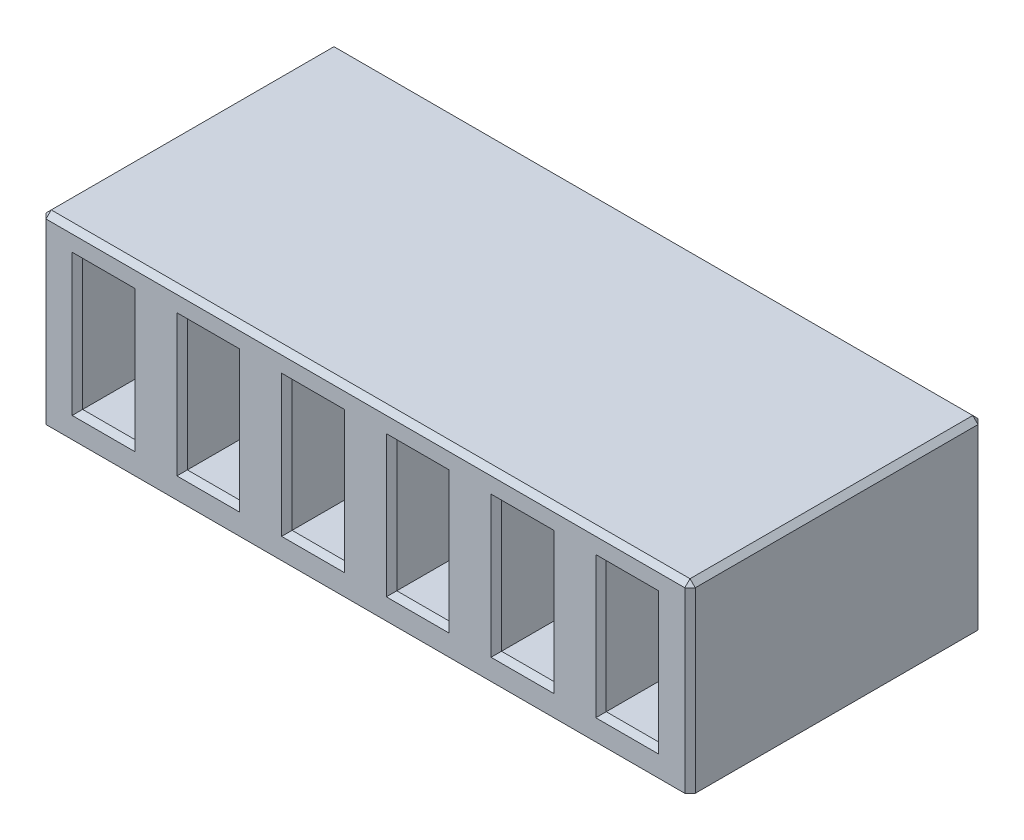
ISO-10303-21;
HEADER;
FILE_DESCRIPTION(('STEP AP214'),'2;1');
FILE_NAME('part.step','',(''),(''),'','','');
FILE_SCHEMA(('AUTOMOTIVE_DESIGN { 1 0 10303 214 1 1 1 1 }'));
ENDSEC;
DATA;
#1=APPLICATION_CONTEXT('core data for automotive mechanical design processes');
#2=APPLICATION_PROTOCOL_DEFINITION('international standard','automotive_design',2000,#1);
#3=PRODUCT_CONTEXT('',#1,'mechanical');
#4=PRODUCT('Part','Part','',(#3));
#5=PRODUCT_RELATED_PRODUCT_CATEGORY('part','',(#4));
#6=PRODUCT_DEFINITION_FORMATION('','',#4);
#7=PRODUCT_DEFINITION_CONTEXT('part definition',#1,'design');
#8=PRODUCT_DEFINITION('design','',#6,#7);
#9=PRODUCT_DEFINITION_SHAPE('','',#8);
#10=(LENGTH_UNIT() NAMED_UNIT(*) SI_UNIT(.MILLI.,.METRE.));
#11=(NAMED_UNIT(*) PLANE_ANGLE_UNIT() SI_UNIT($,.RADIAN.));
#12=(NAMED_UNIT(*) SI_UNIT($,.STERADIAN.) SOLID_ANGLE_UNIT());
#13=UNCERTAINTY_MEASURE_WITH_UNIT(LENGTH_MEASURE(1.E-05),#10,'distance_accuracy_value','');
#14=(GEOMETRIC_REPRESENTATION_CONTEXT(3) GLOBAL_UNCERTAINTY_ASSIGNED_CONTEXT((#13)) GLOBAL_UNIT_ASSIGNED_CONTEXT((#10,
#11,#12)) REPRESENTATION_CONTEXT('',''));
#15=CARTESIAN_POINT('',(0.,0.,0.));
#16=DIRECTION('',(0.,0.,1.));
#17=DIRECTION('',(1.,0.,0.));
#18=AXIS2_PLACEMENT_3D('',#15,#16,#17);
#19=CARTESIAN_POINT('',(-6.19999999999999,3.5,2.8));
#20=DIRECTION('',(0.,0.,-1.));
#21=DIRECTION('',(-1.,0.,0.));
#22=AXIS2_PLACEMENT_3D('',#19,#20,#21);
#23=PLANE('',#22);
#24=DIRECTION('',(1.,0.,0.));
#25=VECTOR('',#24,1.);
#26=CARTESIAN_POINT('',(-6.19999999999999,0.,2.8));
#27=LINE('',#26,#25);
#28=CARTESIAN_POINT('',(-6.1,0.,2.8));
#29=VERTEX_POINT('',#28);
#30=CARTESIAN_POINT('',(6.10000000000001,0.,2.8));
#31=VERTEX_POINT('',#30);
#32=EDGE_CURVE('E707',#29,#31,#27,.T.);
#33=ORIENTED_EDGE('',*,*,#32,.T.);
#34=DIRECTION('',(0.,1.,0.));
#35=VECTOR('',#34,1.);
#36=CARTESIAN_POINT('',(6.10000000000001,3.5,2.8));
#37=LINE('',#36,#35);
#38=CARTESIAN_POINT('',(6.10000000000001,3.4,2.8));
#39=VERTEX_POINT('',#38);
#40=EDGE_CURVE('E1213',#31,#39,#37,.T.);
#41=ORIENTED_EDGE('',*,*,#40,.T.);
#42=DIRECTION('',(-1.,0.,0.));
#43=VECTOR('',#42,1.);
#44=CARTESIAN_POINT('',(-6.19999999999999,3.4,2.8));
#45=LINE('',#44,#43);
#46=CARTESIAN_POINT('',(-6.1,3.4,2.8));
#47=VERTEX_POINT('',#46);
#48=EDGE_CURVE('E1211',#39,#47,#45,.T.);
#49=ORIENTED_EDGE('',*,*,#48,.T.);
#50=DIRECTION('',(0.,-1.,0.));
#51=VECTOR('',#50,1.);
#52=CARTESIAN_POINT('',(-6.1,3.5,2.8));
#53=LINE('',#52,#51);
#54=EDGE_CURVE('E1209',#47,#29,#53,.T.);
#55=ORIENTED_EDGE('',*,*,#54,.T.);
#56=EDGE_LOOP('',(#33,#41,#49,#55));
#57=FACE_BOUND('',#56,.T.);
#58=DIRECTION('',(0.,-1.,0.));
#59=VECTOR('',#58,1.);
#60=CARTESIAN_POINT('',(-4.4,0.5,2.8));
#61=LINE('',#60,#59);
#62=CARTESIAN_POINT('',(-4.4,3.1,2.8));
#63=VERTEX_POINT('',#62);
#64=CARTESIAN_POINT('',(-4.4,0.400000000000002,2.8));
#65=VERTEX_POINT('',#64);
#66=EDGE_CURVE('E723',#63,#65,#61,.T.);
#67=ORIENTED_EDGE('',*,*,#66,.T.);
#68=DIRECTION('',(-1.,0.,0.));
#69=VECTOR('',#68,1.);
#70=CARTESIAN_POINT('',(-6.19999999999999,0.400000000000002,2.8));
#71=LINE('',#70,#69);
#72=CARTESIAN_POINT('',(-5.59999999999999,0.400000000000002,2.8));
#73=VERTEX_POINT('',#72);
#74=EDGE_CURVE('E725',#65,#73,#71,.T.);
#75=ORIENTED_EDGE('',*,*,#74,.T.);
#76=DIRECTION('',(0.,1.,0.));
#77=VECTOR('',#76,1.);
#78=CARTESIAN_POINT('',(-5.59999999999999,3.5,2.8));
#79=LINE('',#78,#77);
#80=CARTESIAN_POINT('',(-5.59999999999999,3.1,2.8));
#81=VERTEX_POINT('',#80);
#82=EDGE_CURVE('E719',#73,#81,#79,.T.);
#83=ORIENTED_EDGE('',*,*,#82,.T.);
#84=DIRECTION('',(1.,0.,0.));
#85=VECTOR('',#84,1.);
#86=CARTESIAN_POINT('',(-4.49999999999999,3.1,2.8));
#87=LINE('',#86,#85);
#88=EDGE_CURVE('E721',#81,#63,#87,.T.);
#89=ORIENTED_EDGE('',*,*,#88,.T.);
#90=EDGE_LOOP('',(#67,#75,#83,#89));
#91=FACE_BOUND('',#90,.T.);
#92=DIRECTION('',(0.,1.,0.));
#93=VECTOR('',#92,1.);
#94=CARTESIAN_POINT('',(-3.59999999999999,3.5,2.8));
#95=LINE('',#94,#93);
#96=CARTESIAN_POINT('',(-3.59999999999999,0.400000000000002,2.8));
#97=VERTEX_POINT('',#96);
#98=CARTESIAN_POINT('',(-3.59999999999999,3.1,2.8));
#99=VERTEX_POINT('',#98);
#100=EDGE_CURVE('E579',#97,#99,#95,.T.);
#101=ORIENTED_EDGE('',*,*,#100,.T.);
#102=DIRECTION('',(1.,0.,0.));
#103=VECTOR('',#102,1.);
#104=CARTESIAN_POINT('',(-2.49999999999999,3.1,2.8));
#105=LINE('',#104,#103);
#106=CARTESIAN_POINT('',(-2.4,3.1,2.8));
#107=VERTEX_POINT('',#106);
#108=EDGE_CURVE('E566',#99,#107,#105,.T.);
#109=ORIENTED_EDGE('',*,*,#108,.T.);
#110=DIRECTION('',(0.,-1.,0.));
#111=VECTOR('',#110,1.);
#112=CARTESIAN_POINT('',(-2.4,0.5,2.8));
#113=LINE('',#112,#111);
#114=CARTESIAN_POINT('',(-2.4,0.400000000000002,2.8));
#115=VERTEX_POINT('',#114);
#116=EDGE_CURVE('E558',#107,#115,#113,.T.);
#117=ORIENTED_EDGE('',*,*,#116,.T.);
#118=DIRECTION('',(-1.,0.,0.));
#119=VECTOR('',#118,1.);
#120=CARTESIAN_POINT('',(-4.19999999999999,0.400000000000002,2.8));
#121=LINE('',#120,#119);
#122=EDGE_CURVE('E542',#115,#97,#121,.T.);
#123=ORIENTED_EDGE('',*,*,#122,.T.);
#124=EDGE_LOOP('',(#101,#109,#117,#123));
#125=FACE_BOUND('',#124,.T.);
#126=DIRECTION('',(0.,1.,0.));
#127=VECTOR('',#126,1.);
#128=CARTESIAN_POINT('',(-1.59999999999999,3.5,2.8));
#129=LINE('',#128,#127);
#130=CARTESIAN_POINT('',(-1.59999999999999,0.400000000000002,2.8));
#131=VERTEX_POINT('',#130);
#132=CARTESIAN_POINT('',(-1.59999999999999,3.1,2.8));
#133=VERTEX_POINT('',#132);
#134=EDGE_CURVE('E760',#131,#133,#129,.T.);
#135=ORIENTED_EDGE('',*,*,#134,.T.);
#136=DIRECTION('',(1.,0.,0.));
#137=VECTOR('',#136,1.);
#138=CARTESIAN_POINT('',(-0.499999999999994,3.1,2.8));
#139=LINE('',#138,#137);
#140=CARTESIAN_POINT('',(-0.399999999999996,3.1,2.8));
#141=VERTEX_POINT('',#140);
#142=EDGE_CURVE('E770',#133,#141,#139,.T.);
#143=ORIENTED_EDGE('',*,*,#142,.T.);
#144=DIRECTION('',(0.,-1.,0.));
#145=VECTOR('',#144,1.);
#146=CARTESIAN_POINT('',(-0.399999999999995,0.5,2.8));
#147=LINE('',#146,#145);
#148=CARTESIAN_POINT('',(-0.399999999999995,0.400000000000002,2.8));
#149=VERTEX_POINT('',#148);
#150=EDGE_CURVE('E772',#141,#149,#147,.T.);
#151=ORIENTED_EDGE('',*,*,#150,.T.);
#152=DIRECTION('',(-1.,0.,0.));
#153=VECTOR('',#152,1.);
#154=CARTESIAN_POINT('',(-2.19999999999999,0.400000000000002,2.8));
#155=LINE('',#154,#153);
#156=EDGE_CURVE('E774',#149,#131,#155,.T.);
#157=ORIENTED_EDGE('',*,*,#156,.T.);
#158=EDGE_LOOP('',(#135,#143,#151,#157));
#159=FACE_BOUND('',#158,.T.);
#160=DIRECTION('',(0.,1.,0.));
#161=VECTOR('',#160,1.);
#162=CARTESIAN_POINT('',(0.400000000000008,3.5,2.8));
#163=LINE('',#162,#161);
#164=CARTESIAN_POINT('',(0.400000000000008,0.400000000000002,2.8));
#165=VERTEX_POINT('',#164);
#166=CARTESIAN_POINT('',(0.400000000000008,3.1,2.8));
#167=VERTEX_POINT('',#166);
#168=EDGE_CURVE('E873',#165,#167,#163,.T.);
#169=ORIENTED_EDGE('',*,*,#168,.T.);
#170=DIRECTION('',(1.,0.,0.));
#171=VECTOR('',#170,1.);
#172=CARTESIAN_POINT('',(1.50000000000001,3.1,2.8));
#173=LINE('',#172,#171);
#174=CARTESIAN_POINT('',(1.6,3.1,2.8));
#175=VERTEX_POINT('',#174);
#176=EDGE_CURVE('E875',#167,#175,#173,.T.);
#177=ORIENTED_EDGE('',*,*,#176,.T.);
#178=DIRECTION('',(0.,-1.,0.));
#179=VECTOR('',#178,1.);
#180=CARTESIAN_POINT('',(1.6,0.5,2.8));
#181=LINE('',#180,#179);
#182=CARTESIAN_POINT('',(1.6,0.400000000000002,2.8));
#183=VERTEX_POINT('',#182);
#184=EDGE_CURVE('E877',#175,#183,#181,.T.);
#185=ORIENTED_EDGE('',*,*,#184,.T.);
#186=DIRECTION('',(-1.,0.,0.));
#187=VECTOR('',#186,1.);
#188=CARTESIAN_POINT('',(-0.199999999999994,0.400000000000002,2.8));
#189=LINE('',#188,#187);
#190=EDGE_CURVE('E879',#183,#165,#189,.T.);
#191=ORIENTED_EDGE('',*,*,#190,.T.);
#192=EDGE_LOOP('',(#169,#177,#185,#191));
#193=FACE_BOUND('',#192,.T.);
#194=DIRECTION('',(0.,1.,0.));
#195=VECTOR('',#194,1.);
#196=CARTESIAN_POINT('',(2.40000000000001,3.5,2.8));
#197=LINE('',#196,#195);
#198=CARTESIAN_POINT('',(2.40000000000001,0.400000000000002,2.8));
#199=VERTEX_POINT('',#198);
#200=CARTESIAN_POINT('',(2.40000000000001,3.1,2.8));
#201=VERTEX_POINT('',#200);
#202=EDGE_CURVE('E978',#199,#201,#197,.T.);
#203=ORIENTED_EDGE('',*,*,#202,.T.);
#204=DIRECTION('',(1.,0.,0.));
#205=VECTOR('',#204,1.);
#206=CARTESIAN_POINT('',(3.50000000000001,3.1,2.8));
#207=LINE('',#206,#205);
#208=CARTESIAN_POINT('',(3.6,3.1,2.8));
#209=VERTEX_POINT('',#208);
#210=EDGE_CURVE('E980',#201,#209,#207,.T.);
#211=ORIENTED_EDGE('',*,*,#210,.T.);
#212=DIRECTION('',(0.,-1.,0.));
#213=VECTOR('',#212,1.);
#214=CARTESIAN_POINT('',(3.6,0.5,2.8));
#215=LINE('',#214,#213);
#216=CARTESIAN_POINT('',(3.6,0.400000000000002,2.8));
#217=VERTEX_POINT('',#216);
#218=EDGE_CURVE('E982',#209,#217,#215,.T.);
#219=ORIENTED_EDGE('',*,*,#218,.T.);
#220=DIRECTION('',(-1.,0.,0.));
#221=VECTOR('',#220,1.);
#222=CARTESIAN_POINT('',(1.80000000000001,0.400000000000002,2.8));
#223=LINE('',#222,#221);
#224=EDGE_CURVE('E984',#217,#199,#223,.T.);
#225=ORIENTED_EDGE('',*,*,#224,.T.);
#226=EDGE_LOOP('',(#203,#211,#219,#225));
#227=FACE_BOUND('',#226,.T.);
#228=DIRECTION('',(0.,1.,0.));
#229=VECTOR('',#228,1.);
#230=CARTESIAN_POINT('',(4.40000000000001,3.5,2.8));
#231=LINE('',#230,#229);
#232=CARTESIAN_POINT('',(4.40000000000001,0.400000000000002,2.8));
#233=VERTEX_POINT('',#232);
#234=CARTESIAN_POINT('',(4.40000000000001,3.1,2.8));
#235=VERTEX_POINT('',#234);
#236=EDGE_CURVE('E1083',#233,#235,#231,.T.);
#237=ORIENTED_EDGE('',*,*,#236,.T.);
#238=DIRECTION('',(1.,0.,0.));
#239=VECTOR('',#238,1.);
#240=CARTESIAN_POINT('',(5.50000000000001,3.1,2.8));
#241=LINE('',#240,#239);
#242=CARTESIAN_POINT('',(5.6,3.1,2.8));
#243=VERTEX_POINT('',#242);
#244=EDGE_CURVE('E1085',#235,#243,#241,.T.);
#245=ORIENTED_EDGE('',*,*,#244,.T.);
#246=DIRECTION('',(0.,-1.,0.));
#247=VECTOR('',#246,1.);
#248=CARTESIAN_POINT('',(5.6,0.5,2.8));
#249=LINE('',#248,#247);
#250=CARTESIAN_POINT('',(5.6,0.400000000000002,2.8));
#251=VERTEX_POINT('',#250);
#252=EDGE_CURVE('E1087',#243,#251,#249,.T.);
#253=ORIENTED_EDGE('',*,*,#252,.T.);
#254=DIRECTION('',(-1.,0.,0.));
#255=VECTOR('',#254,1.);
#256=CARTESIAN_POINT('',(3.80000000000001,0.400000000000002,2.8));
#257=LINE('',#256,#255);
#258=EDGE_CURVE('E1089',#251,#233,#257,.T.);
#259=ORIENTED_EDGE('',*,*,#258,.T.);
#260=EDGE_LOOP('',(#237,#245,#253,#259));
#261=FACE_BOUND('',#260,.T.);
#262=ADVANCED_FACE('F33',(#57,#91,#125,#159,#193,#227,#261),#23,.F.);
#263=CARTESIAN_POINT('',(-6.2,3.5,-2.8));
#264=DIRECTION('',(0.,0.,-1.));
#265=DIRECTION('',(-1.,0.,0.));
#266=AXIS2_PLACEMENT_3D('',#263,#264,#265);
#267=PLANE('',#266);
#268=DIRECTION('',(1.,0.,0.));
#269=VECTOR('',#268,1.);
#270=CARTESIAN_POINT('',(-6.2,3.4,-2.8));
#271=LINE('',#270,#269);
#272=CARTESIAN_POINT('',(-6.1,3.4,-2.8));
#273=VERTEX_POINT('',#272);
#274=CARTESIAN_POINT('',(6.10000000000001,3.4,-2.8));
#275=VERTEX_POINT('',#274);
#276=EDGE_CURVE('E1188',#273,#275,#271,.T.);
#277=ORIENTED_EDGE('',*,*,#276,.T.);
#278=DIRECTION('',(0.,-1.,0.));
#279=VECTOR('',#278,1.);
#280=CARTESIAN_POINT('',(6.10000000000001,3.5,-2.8));
#281=LINE('',#280,#279);
#282=CARTESIAN_POINT('',(6.10000000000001,0.,-2.8));
#283=VERTEX_POINT('',#282);
#284=EDGE_CURVE('E1192',#275,#283,#281,.T.);
#285=ORIENTED_EDGE('',*,*,#284,.T.);
#286=DIRECTION('',(1.,0.,0.));
#287=VECTOR('',#286,1.);
#288=CARTESIAN_POINT('',(-6.2,0.,-2.8));
#289=LINE('',#288,#287);
#290=CARTESIAN_POINT('',(-6.1,0.,-2.8));
#291=VERTEX_POINT('',#290);
#292=EDGE_CURVE('E713',#291,#283,#289,.T.);
#293=ORIENTED_EDGE('',*,*,#292,.F.);
#294=DIRECTION('',(0.,1.,0.));
#295=VECTOR('',#294,1.);
#296=CARTESIAN_POINT('',(-6.1,3.5,-2.8));
#297=LINE('',#296,#295);
#298=EDGE_CURVE('E1190',#291,#273,#297,.T.);
#299=ORIENTED_EDGE('',*,*,#298,.T.);
#300=EDGE_LOOP('',(#277,#285,#293,#299));
#301=FACE_BOUND('',#300,.T.);
#302=DIRECTION('',(-1.,0.,0.));
#303=VECTOR('',#302,1.);
#304=CARTESIAN_POINT('',(-6.2,2.55,-2.8));
#305=LINE('',#304,#303);
#306=CARTESIAN_POINT('',(-4.69999999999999,2.55,-2.8));
#307=VERTEX_POINT('',#306);
#308=CARTESIAN_POINT('',(-5.29999999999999,2.55,-2.8));
#309=VERTEX_POINT('',#308);
#310=EDGE_CURVE('E746',#307,#309,#305,.T.);
#311=ORIENTED_EDGE('',*,*,#310,.T.);
#312=DIRECTION('',(0.,-1.,0.));
#313=VECTOR('',#312,1.);
#314=CARTESIAN_POINT('',(-5.29999999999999,2.,-2.8));
#315=LINE('',#314,#313);
#316=CARTESIAN_POINT('',(-5.29999999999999,1.95,-2.8));
#317=VERTEX_POINT('',#316);
#318=EDGE_CURVE('E748',#309,#317,#315,.T.);
#319=ORIENTED_EDGE('',*,*,#318,.T.);
#320=DIRECTION('',(1.,0.,0.));
#321=VECTOR('',#320,1.);
#322=CARTESIAN_POINT('',(-4.74999999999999,1.95,-2.8));
#323=LINE('',#322,#321);
#324=CARTESIAN_POINT('',(-4.69999999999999,1.95,-2.8));
#325=VERTEX_POINT('',#324);
#326=EDGE_CURVE('E734',#317,#325,#323,.T.);
#327=ORIENTED_EDGE('',*,*,#326,.T.);
#328=DIRECTION('',(0.,1.,0.));
#329=VECTOR('',#328,1.);
#330=CARTESIAN_POINT('',(-4.69999999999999,3.5,-2.8));
#331=LINE('',#330,#329);
#332=EDGE_CURVE('E744',#325,#307,#331,.T.);
#333=ORIENTED_EDGE('',*,*,#332,.T.);
#334=EDGE_LOOP('',(#311,#319,#327,#333));
#335=FACE_BOUND('',#334,.T.);
#336=DIRECTION('',(0.,1.,0.));
#337=VECTOR('',#336,1.);
#338=CARTESIAN_POINT('',(-2.69999999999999,3.5,-2.8));
#339=LINE('',#338,#337);
#340=CARTESIAN_POINT('',(-2.69999999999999,1.95,-2.8));
#341=VERTEX_POINT('',#340);
#342=CARTESIAN_POINT('',(-2.69999999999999,2.55,-2.8));
#343=VERTEX_POINT('',#342);
#344=EDGE_CURVE('E647',#341,#343,#339,.T.);
#345=ORIENTED_EDGE('',*,*,#344,.T.);
#346=DIRECTION('',(-1.,0.,0.));
#347=VECTOR('',#346,1.);
#348=CARTESIAN_POINT('',(-4.2,2.55,-2.8));
#349=LINE('',#348,#347);
#350=CARTESIAN_POINT('',(-3.29999999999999,2.55,-2.8));
#351=VERTEX_POINT('',#350);
#352=EDGE_CURVE('E650',#343,#351,#349,.T.);
#353=ORIENTED_EDGE('',*,*,#352,.T.);
#354=DIRECTION('',(0.,-1.,0.));
#355=VECTOR('',#354,1.);
#356=CARTESIAN_POINT('',(-3.29999999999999,2.,-2.8));
#357=LINE('',#356,#355);
#358=CARTESIAN_POINT('',(-3.29999999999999,1.95,-2.8));
#359=VERTEX_POINT('',#358);
#360=EDGE_CURVE('E552',#351,#359,#357,.T.);
#361=ORIENTED_EDGE('',*,*,#360,.T.);
#362=DIRECTION('',(1.,0.,0.));
#363=VECTOR('',#362,1.);
#364=CARTESIAN_POINT('',(-2.74999999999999,1.95,-2.8));
#365=LINE('',#364,#363);
#366=EDGE_CURVE('E641',#359,#341,#365,.T.);
#367=ORIENTED_EDGE('',*,*,#366,.T.);
#368=EDGE_LOOP('',(#345,#353,#361,#367));
#369=FACE_BOUND('',#368,.T.);
#370=DIRECTION('',(-1.,0.,0.));
#371=VECTOR('',#370,1.);
#372=CARTESIAN_POINT('',(-2.2,2.55,-2.8));
#373=LINE('',#372,#371);
#374=CARTESIAN_POINT('',(-0.699999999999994,2.55,-2.8));
#375=VERTEX_POINT('',#374);
#376=CARTESIAN_POINT('',(-1.29999999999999,2.55,-2.8));
#377=VERTEX_POINT('',#376);
#378=EDGE_CURVE('E777',#375,#377,#373,.T.);
#379=ORIENTED_EDGE('',*,*,#378,.T.);
#380=DIRECTION('',(0.,-1.,0.));
#381=VECTOR('',#380,1.);
#382=CARTESIAN_POINT('',(-1.29999999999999,2.,-2.8));
#383=LINE('',#382,#381);
#384=CARTESIAN_POINT('',(-1.29999999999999,1.95,-2.8));
#385=VERTEX_POINT('',#384);
#386=EDGE_CURVE('E779',#377,#385,#383,.T.);
#387=ORIENTED_EDGE('',*,*,#386,.T.);
#388=DIRECTION('',(1.,0.,0.));
#389=VECTOR('',#388,1.);
#390=CARTESIAN_POINT('',(-0.749999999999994,1.95,-2.8));
#391=LINE('',#390,#389);
#392=CARTESIAN_POINT('',(-0.699999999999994,1.95,-2.8));
#393=VERTEX_POINT('',#392);
#394=EDGE_CURVE('E781',#385,#393,#391,.T.);
#395=ORIENTED_EDGE('',*,*,#394,.T.);
#396=DIRECTION('',(0.,1.,0.));
#397=VECTOR('',#396,1.);
#398=CARTESIAN_POINT('',(-0.699999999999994,3.5,-2.8));
#399=LINE('',#398,#397);
#400=EDGE_CURVE('E783',#393,#375,#399,.T.);
#401=ORIENTED_EDGE('',*,*,#400,.T.);
#402=EDGE_LOOP('',(#379,#387,#395,#401));
#403=FACE_BOUND('',#402,.T.);
#404=DIRECTION('',(-1.,0.,0.));
#405=VECTOR('',#404,1.);
#406=CARTESIAN_POINT('',(-0.199999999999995,2.55,-2.8));
#407=LINE('',#406,#405);
#408=CARTESIAN_POINT('',(1.30000000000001,2.55,-2.8));
#409=VERTEX_POINT('',#408);
#410=CARTESIAN_POINT('',(0.700000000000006,2.55,-2.8));
#411=VERTEX_POINT('',#410);
#412=EDGE_CURVE('E882',#409,#411,#407,.T.);
#413=ORIENTED_EDGE('',*,*,#412,.T.);
#414=DIRECTION('',(0.,-1.,0.));
#415=VECTOR('',#414,1.);
#416=CARTESIAN_POINT('',(0.700000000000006,2.,-2.8));
#417=LINE('',#416,#415);
#418=CARTESIAN_POINT('',(0.700000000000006,1.95,-2.8));
#419=VERTEX_POINT('',#418);
#420=EDGE_CURVE('E884',#411,#419,#417,.T.);
#421=ORIENTED_EDGE('',*,*,#420,.T.);
#422=DIRECTION('',(1.,0.,0.));
#423=VECTOR('',#422,1.);
#424=CARTESIAN_POINT('',(1.25000000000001,1.95,-2.8));
#425=LINE('',#424,#423);
#426=CARTESIAN_POINT('',(1.30000000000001,1.95,-2.8));
#427=VERTEX_POINT('',#426);
#428=EDGE_CURVE('E886',#419,#427,#425,.T.);
#429=ORIENTED_EDGE('',*,*,#428,.T.);
#430=DIRECTION('',(0.,1.,0.));
#431=VECTOR('',#430,1.);
#432=CARTESIAN_POINT('',(1.30000000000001,3.5,-2.8));
#433=LINE('',#432,#431);
#434=EDGE_CURVE('E888',#427,#409,#433,.T.);
#435=ORIENTED_EDGE('',*,*,#434,.T.);
#436=EDGE_LOOP('',(#413,#421,#429,#435));
#437=FACE_BOUND('',#436,.T.);
#438=DIRECTION('',(-1.,0.,0.));
#439=VECTOR('',#438,1.);
#440=CARTESIAN_POINT('',(1.8,2.55,-2.8));
#441=LINE('',#440,#439);
#442=CARTESIAN_POINT('',(3.30000000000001,2.55,-2.8));
#443=VERTEX_POINT('',#442);
#444=CARTESIAN_POINT('',(2.70000000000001,2.55,-2.8));
#445=VERTEX_POINT('',#444);
#446=EDGE_CURVE('E987',#443,#445,#441,.T.);
#447=ORIENTED_EDGE('',*,*,#446,.T.);
#448=DIRECTION('',(0.,-1.,0.));
#449=VECTOR('',#448,1.);
#450=CARTESIAN_POINT('',(2.70000000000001,2.,-2.8));
#451=LINE('',#450,#449);
#452=CARTESIAN_POINT('',(2.70000000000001,1.95,-2.8));
#453=VERTEX_POINT('',#452);
#454=EDGE_CURVE('E989',#445,#453,#451,.T.);
#455=ORIENTED_EDGE('',*,*,#454,.T.);
#456=DIRECTION('',(1.,0.,0.));
#457=VECTOR('',#456,1.);
#458=CARTESIAN_POINT('',(3.25000000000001,1.95,-2.8));
#459=LINE('',#458,#457);
#460=CARTESIAN_POINT('',(3.30000000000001,1.95,-2.8));
#461=VERTEX_POINT('',#460);
#462=EDGE_CURVE('E991',#453,#461,#459,.T.);
#463=ORIENTED_EDGE('',*,*,#462,.T.);
#464=DIRECTION('',(0.,1.,0.));
#465=VECTOR('',#464,1.);
#466=CARTESIAN_POINT('',(3.30000000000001,3.5,-2.8));
#467=LINE('',#466,#465);
#468=EDGE_CURVE('E993',#461,#443,#467,.T.);
#469=ORIENTED_EDGE('',*,*,#468,.T.);
#470=EDGE_LOOP('',(#447,#455,#463,#469));
#471=FACE_BOUND('',#470,.T.);
#472=DIRECTION('',(-1.,0.,0.));
#473=VECTOR('',#472,1.);
#474=CARTESIAN_POINT('',(3.8,2.55,-2.8));
#475=LINE('',#474,#473);
#476=CARTESIAN_POINT('',(5.30000000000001,2.55,-2.8));
#477=VERTEX_POINT('',#476);
#478=CARTESIAN_POINT('',(4.70000000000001,2.55,-2.8));
#479=VERTEX_POINT('',#478);
#480=EDGE_CURVE('E1092',#477,#479,#475,.T.);
#481=ORIENTED_EDGE('',*,*,#480,.T.);
#482=DIRECTION('',(0.,-1.,0.));
#483=VECTOR('',#482,1.);
#484=CARTESIAN_POINT('',(4.70000000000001,2.,-2.8));
#485=LINE('',#484,#483);
#486=CARTESIAN_POINT('',(4.70000000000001,1.95,-2.8));
#487=VERTEX_POINT('',#486);
#488=EDGE_CURVE('E1094',#479,#487,#485,.T.);
#489=ORIENTED_EDGE('',*,*,#488,.T.);
#490=DIRECTION('',(1.,0.,0.));
#491=VECTOR('',#490,1.);
#492=CARTESIAN_POINT('',(5.25000000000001,1.95,-2.8));
#493=LINE('',#492,#491);
#494=CARTESIAN_POINT('',(5.30000000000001,1.95,-2.8));
#495=VERTEX_POINT('',#494);
#496=EDGE_CURVE('E1096',#487,#495,#493,.T.);
#497=ORIENTED_EDGE('',*,*,#496,.T.);
#498=DIRECTION('',(0.,1.,0.));
#499=VECTOR('',#498,1.);
#500=CARTESIAN_POINT('',(5.30000000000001,3.5,-2.8));
#501=LINE('',#500,#499);
#502=EDGE_CURVE('E1098',#495,#477,#501,.T.);
#503=ORIENTED_EDGE('',*,*,#502,.T.);
#504=EDGE_LOOP('',(#481,#489,#497,#503));
#505=FACE_BOUND('',#504,.T.);
#506=ADVANCED_FACE('F1304',(#301,#335,#369,#403,#437,#471,#505),#267,.T.);
#507=CARTESIAN_POINT('',(-6.2,3.5,-2.8));
#508=DIRECTION('',(1.,0.,0.));
#509=DIRECTION('',(0.,0.,-1.));
#510=AXIS2_PLACEMENT_3D('',#507,#508,#509);
#511=PLANE('',#510);
#512=DIRECTION('',(0.,0.,1.));
#513=VECTOR('',#512,1.);
#514=CARTESIAN_POINT('',(-6.2,0.,-2.8));
#515=LINE('',#514,#513);
#516=CARTESIAN_POINT('',(-6.2,0.,-2.70000000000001));
#517=VERTEX_POINT('',#516);
#518=CARTESIAN_POINT('',(-6.19999999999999,0.,2.7));
#519=VERTEX_POINT('',#518);
#520=EDGE_CURVE('E705',#517,#519,#515,.T.);
#521=ORIENTED_EDGE('',*,*,#520,.T.);
#522=DIRECTION('',(0.,1.,0.));
#523=VECTOR('',#522,1.);
#524=CARTESIAN_POINT('',(-6.19999999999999,3.5,2.7));
#525=LINE('',#524,#523);
#526=CARTESIAN_POINT('',(-6.19999999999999,3.4,2.7));
#527=VERTEX_POINT('',#526);
#528=EDGE_CURVE('E11',#519,#527,#525,.T.);
#529=ORIENTED_EDGE('',*,*,#528,.T.);
#530=DIRECTION('',(0.,0.,-1.));
#531=VECTOR('',#530,1.);
#532=CARTESIAN_POINT('',(-6.2,3.4,-2.8));
#533=LINE('',#532,#531);
#534=CARTESIAN_POINT('',(-6.2,3.4,-2.70000000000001));
#535=VERTEX_POINT('',#534);
#536=EDGE_CURVE('E49',#527,#535,#533,.T.);
#537=ORIENTED_EDGE('',*,*,#536,.T.);
#538=DIRECTION('',(0.,-1.,0.));
#539=VECTOR('',#538,1.);
#540=CARTESIAN_POINT('',(-6.2,0.,-2.70000000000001));
#541=LINE('',#540,#539);
#542=EDGE_CURVE('E42',#535,#517,#541,.T.);
#543=ORIENTED_EDGE('',*,*,#542,.T.);
#544=EDGE_LOOP('',(#521,#529,#537,#543));
#545=FACE_BOUND('',#544,.T.);
#546=ADVANCED_FACE('F1301',(#545),#511,.F.);
#547=CARTESIAN_POINT('',(6.2,3.5,-2.8));
#548=DIRECTION('',(1.,0.,0.));
#549=DIRECTION('',(0.,0.,-1.));
#550=AXIS2_PLACEMENT_3D('',#547,#548,#549);
#551=PLANE('',#550);
#552=DIRECTION('',(0.,0.,1.));
#553=VECTOR('',#552,1.);
#554=CARTESIAN_POINT('',(6.2,0.,-2.8));
#555=LINE('',#554,#553);
#556=CARTESIAN_POINT('',(6.2,0.,-2.70000000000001));
#557=VERTEX_POINT('',#556);
#558=CARTESIAN_POINT('',(6.20000000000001,0.,2.7));
#559=VERTEX_POINT('',#558);
#560=EDGE_CURVE('E710',#557,#559,#555,.T.);
#561=ORIENTED_EDGE('',*,*,#560,.F.);
#562=DIRECTION('',(0.,1.,0.));
#563=VECTOR('',#562,1.);
#564=CARTESIAN_POINT('',(6.2,3.5,-2.70000000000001));
#565=LINE('',#564,#563);
#566=CARTESIAN_POINT('',(6.2,3.4,-2.70000000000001));
#567=VERTEX_POINT('',#566);
#568=EDGE_CURVE('E1207',#557,#567,#565,.T.);
#569=ORIENTED_EDGE('',*,*,#568,.T.);
#570=DIRECTION('',(0.,0.,1.));
#571=VECTOR('',#570,1.);
#572=CARTESIAN_POINT('',(6.2,3.4,-2.8));
#573=LINE('',#572,#571);
#574=CARTESIAN_POINT('',(6.20000000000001,3.4,2.7));
#575=VERTEX_POINT('',#574);
#576=EDGE_CURVE('E1203',#567,#575,#573,.T.);
#577=ORIENTED_EDGE('',*,*,#576,.T.);
#578=DIRECTION('',(0.,-1.,0.));
#579=VECTOR('',#578,1.);
#580=CARTESIAN_POINT('',(6.20000000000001,0.,2.7));
#581=LINE('',#580,#579);
#582=EDGE_CURVE('E1205',#575,#559,#581,.T.);
#583=ORIENTED_EDGE('',*,*,#582,.T.);
#584=EDGE_LOOP('',(#561,#569,#577,#583));
#585=FACE_BOUND('',#584,.T.);
#586=ADVANCED_FACE('F1313',(#585),#551,.T.);
#587=CARTESIAN_POINT('',(0.,3.5,0.));
#588=DIRECTION('',(0.,1.,0.));
#589=DIRECTION('',(0.,0.,1.));
#590=AXIS2_PLACEMENT_3D('',#587,#588,#589);
#591=PLANE('',#590);
#592=DIRECTION('',(0.,0.,1.));
#593=VECTOR('',#592,1.);
#594=CARTESIAN_POINT('',(-6.1,3.5,2.8));
#595=LINE('',#594,#593);
#596=CARTESIAN_POINT('',(-6.1,3.5,-2.70000000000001));
#597=VERTEX_POINT('',#596);
#598=CARTESIAN_POINT('',(-6.1,3.5,2.7));
#599=VERTEX_POINT('',#598);
#600=EDGE_CURVE('E1217',#597,#599,#595,.T.);
#601=ORIENTED_EDGE('',*,*,#600,.T.);
#602=DIRECTION('',(1.,0.,0.));
#603=VECTOR('',#602,1.);
#604=CARTESIAN_POINT('',(6.20000000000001,3.5,2.7));
#605=LINE('',#604,#603);
#606=CARTESIAN_POINT('',(6.10000000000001,3.5,2.7));
#607=VERTEX_POINT('',#606);
#608=EDGE_CURVE('E1221',#599,#607,#605,.T.);
#609=ORIENTED_EDGE('',*,*,#608,.T.);
#610=DIRECTION('',(0.,0.,-1.));
#611=VECTOR('',#610,1.);
#612=CARTESIAN_POINT('',(6.10000000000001,3.5,0.));
#613=LINE('',#612,#611);
#614=CARTESIAN_POINT('',(6.10000000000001,3.5,-2.70000000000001));
#615=VERTEX_POINT('',#614);
#616=EDGE_CURVE('E1219',#607,#615,#613,.T.);
#617=ORIENTED_EDGE('',*,*,#616,.T.);
#618=DIRECTION('',(-1.,0.,0.));
#619=VECTOR('',#618,1.);
#620=CARTESIAN_POINT('',(0.,3.5,-2.70000000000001));
#621=LINE('',#620,#619);
#622=EDGE_CURVE('E1215',#615,#597,#621,.T.);
#623=ORIENTED_EDGE('',*,*,#622,.T.);
#624=EDGE_LOOP('',(#601,#609,#617,#623));
#625=FACE_BOUND('',#624,.T.);
#626=ADVANCED_FACE('F1286',(#625),#591,.T.);
#627=CARTESIAN_POINT('',(0.,0.,0.));
#628=DIRECTION('',(0.,1.,0.));
#629=DIRECTION('',(0.,0.,1.));
#630=AXIS2_PLACEMENT_3D('',#627,#628,#629);
#631=PLANE('',#630);
#632=ORIENTED_EDGE('',*,*,#292,.T.);
#633=DIRECTION('',(-0.707106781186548,0.,-0.707106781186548));
#634=VECTOR('',#633,1.);
#635=CARTESIAN_POINT('',(6.10000000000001,0.,-2.8));
#636=LINE('',#635,#634);
#637=EDGE_CURVE('E1201',#283,#557,#636,.F.);
#638=ORIENTED_EDGE('',*,*,#637,.T.);
#639=ORIENTED_EDGE('',*,*,#560,.T.);
#640=DIRECTION('',(-0.707106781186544,0.,0.707106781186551));
#641=VECTOR('',#640,1.);
#642=CARTESIAN_POINT('',(6.20000000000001,0.,2.7));
#643=LINE('',#642,#641);
#644=EDGE_CURVE('E1199',#559,#31,#643,.T.);
#645=ORIENTED_EDGE('',*,*,#644,.T.);
#646=ORIENTED_EDGE('',*,*,#32,.F.);
#647=DIRECTION('',(0.707106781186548,0.,0.707106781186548));
#648=VECTOR('',#647,1.);
#649=CARTESIAN_POINT('',(-6.1,0.,2.8));
#650=LINE('',#649,#648);
#651=EDGE_CURVE('E1197',#29,#519,#650,.F.);
#652=ORIENTED_EDGE('',*,*,#651,.T.);
#653=ORIENTED_EDGE('',*,*,#520,.F.);
#654=DIRECTION('',(0.707106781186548,0.,-0.707106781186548));
#655=VECTOR('',#654,1.);
#656=CARTESIAN_POINT('',(-6.2,0.,-2.70000000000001));
#657=LINE('',#656,#655);
#658=EDGE_CURVE('E1195',#517,#291,#657,.T.);
#659=ORIENTED_EDGE('',*,*,#658,.T.);
#660=EDGE_LOOP('',(#632,#638,#639,#645,#646,#652,#653,#659));
#661=FACE_BOUND('',#660,.T.);
#662=ADVANCED_FACE('F1273',(#661),#631,.F.);
#663=CARTESIAN_POINT('',(-5.49999999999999,3.,-1.2));
#664=DIRECTION('',(0.,-1.,0.));
#665=DIRECTION('',(0.,0.,-1.));
#666=AXIS2_PLACEMENT_3D('',#663,#664,#665);
#667=PLANE('',#666);
#668=DIRECTION('',(0.,0.,1.));
#669=VECTOR('',#668,1.);
#670=CARTESIAN_POINT('',(-4.49999999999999,3.,-1.2));
#671=LINE('',#670,#669);
#672=CARTESIAN_POINT('',(-4.49999999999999,3.,-1.2));
#673=VERTEX_POINT('',#672);
#674=CARTESIAN_POINT('',(-4.49999999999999,3.,2.7));
#675=VERTEX_POINT('',#674);
#676=EDGE_CURVE('E702',#673,#675,#671,.T.);
#677=ORIENTED_EDGE('',*,*,#676,.T.);
#678=DIRECTION('',(-1.,0.,0.));
#679=VECTOR('',#678,1.);
#680=CARTESIAN_POINT('',(-5.49999999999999,3.,2.7));
#681=LINE('',#680,#679);
#682=CARTESIAN_POINT('',(-5.49999999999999,3.,2.7));
#683=VERTEX_POINT('',#682);
#684=EDGE_CURVE('E730',#675,#683,#681,.T.);
#685=ORIENTED_EDGE('',*,*,#684,.T.);
#686=DIRECTION('',(0.,0.,1.));
#687=VECTOR('',#686,1.);
#688=CARTESIAN_POINT('',(-5.49999999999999,3.,-1.2));
#689=LINE('',#688,#687);
#690=CARTESIAN_POINT('',(-5.49999999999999,3.,-1.2));
#691=VERTEX_POINT('',#690);
#692=EDGE_CURVE('E693',#691,#683,#689,.T.);
#693=ORIENTED_EDGE('',*,*,#692,.F.);
#694=DIRECTION('',(1.,0.,0.));
#695=VECTOR('',#694,1.);
#696=CARTESIAN_POINT('',(-5.49999999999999,3.,-1.2));
#697=LINE('',#696,#695);
#698=EDGE_CURVE('E681',#691,#673,#697,.T.);
#699=ORIENTED_EDGE('',*,*,#698,.T.);
#700=EDGE_LOOP('',(#677,#685,#693,#699));
#701=FACE_BOUND('',#700,.T.);
#702=ADVANCED_FACE('F1738',(#701),#667,.T.);
#703=CARTESIAN_POINT('',(-4.49999999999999,3.,-1.2));
#704=DIRECTION('',(-1.,0.,0.));
#705=DIRECTION('',(0.,-1.,0.));
#706=AXIS2_PLACEMENT_3D('',#703,#704,#705);
#707=PLANE('',#706);
#708=DIRECTION('',(0.,0.,1.));
#709=VECTOR('',#708,1.);
#710=CARTESIAN_POINT('',(-4.49999999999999,0.5,-1.2));
#711=LINE('',#710,#709);
#712=CARTESIAN_POINT('',(-4.49999999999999,0.5,-1.2));
#713=VERTEX_POINT('',#712);
#714=CARTESIAN_POINT('',(-4.49999999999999,0.5,2.7));
#715=VERTEX_POINT('',#714);
#716=EDGE_CURVE('E699',#713,#715,#711,.T.);
#717=ORIENTED_EDGE('',*,*,#716,.T.);
#718=DIRECTION('',(0.,1.,0.));
#719=VECTOR('',#718,1.);
#720=CARTESIAN_POINT('',(-4.49999999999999,3.,2.7));
#721=LINE('',#720,#719);
#722=EDGE_CURVE('E728',#715,#675,#721,.T.);
#723=ORIENTED_EDGE('',*,*,#722,.T.);
#724=ORIENTED_EDGE('',*,*,#676,.F.);
#725=DIRECTION('',(0.,-1.,0.));
#726=VECTOR('',#725,1.);
#727=CARTESIAN_POINT('',(-4.49999999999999,3.,-1.2));
#728=LINE('',#727,#726);
#729=EDGE_CURVE('E684',#673,#713,#728,.T.);
#730=ORIENTED_EDGE('',*,*,#729,.T.);
#731=EDGE_LOOP('',(#717,#723,#724,#730));
#732=FACE_BOUND('',#731,.T.);
#733=ADVANCED_FACE('F2458',(#732),#707,.T.);
#734=CARTESIAN_POINT('',(-5.49999999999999,0.5,-1.2));
#735=DIRECTION('',(0.,-1.,0.));
#736=DIRECTION('',(0.,0.,-1.));
#737=AXIS2_PLACEMENT_3D('',#734,#735,#736);
#738=PLANE('',#737);
#739=DIRECTION('',(0.,0.,1.));
#740=VECTOR('',#739,1.);
#741=CARTESIAN_POINT('',(-5.49999999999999,0.5,-1.2));
#742=LINE('',#741,#740);
#743=CARTESIAN_POINT('',(-5.49999999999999,0.5,-1.2));
#744=VERTEX_POINT('',#743);
#745=CARTESIAN_POINT('',(-5.49999999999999,0.5,2.7));
#746=VERTEX_POINT('',#745);
#747=EDGE_CURVE('E696',#744,#746,#742,.T.);
#748=ORIENTED_EDGE('',*,*,#747,.T.);
#749=DIRECTION('',(1.,0.,0.));
#750=VECTOR('',#749,1.);
#751=CARTESIAN_POINT('',(-5.49999999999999,0.5,2.7));
#752=LINE('',#751,#750);
#753=EDGE_CURVE('E716',#746,#715,#752,.T.);
#754=ORIENTED_EDGE('',*,*,#753,.T.);
#755=ORIENTED_EDGE('',*,*,#716,.F.);
#756=DIRECTION('',(1.,0.,0.));
#757=VECTOR('',#756,1.);
#758=CARTESIAN_POINT('',(-5.49999999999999,0.5,-1.2));
#759=LINE('',#758,#757);
#760=EDGE_CURVE('E687',#744,#713,#759,.T.);
#761=ORIENTED_EDGE('',*,*,#760,.F.);
#762=EDGE_LOOP('',(#748,#754,#755,#761));
#763=FACE_BOUND('',#762,.T.);
#764=ADVANCED_FACE('F2448',(#763),#738,.F.);
#765=CARTESIAN_POINT('',(-5.49999999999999,3.,-1.2));
#766=DIRECTION('',(-1.,0.,0.));
#767=DIRECTION('',(0.,0.,1.));
#768=AXIS2_PLACEMENT_3D('',#765,#766,#767);
#769=PLANE('',#768);
#770=ORIENTED_EDGE('',*,*,#692,.T.);
#771=DIRECTION('',(0.,-1.,0.));
#772=VECTOR('',#771,1.);
#773=CARTESIAN_POINT('',(-5.49999999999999,3.,2.7));
#774=LINE('',#773,#772);
#775=EDGE_CURVE('E732',#683,#746,#774,.T.);
#776=ORIENTED_EDGE('',*,*,#775,.T.);
#777=ORIENTED_EDGE('',*,*,#747,.F.);
#778=DIRECTION('',(0.,-1.,0.));
#779=VECTOR('',#778,1.);
#780=CARTESIAN_POINT('',(-5.49999999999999,3.,-1.2));
#781=LINE('',#780,#779);
#782=EDGE_CURVE('E690',#691,#744,#781,.T.);
#783=ORIENTED_EDGE('',*,*,#782,.F.);
#784=EDGE_LOOP('',(#770,#776,#777,#783));
#785=FACE_BOUND('',#784,.T.);
#786=ADVANCED_FACE('F2415',(#785),#769,.F.);
#787=CARTESIAN_POINT('',(0.,0.,-1.2));
#788=DIRECTION('',(0.,0.,-1.));
#789=DIRECTION('',(-1.,0.,0.));
#790=AXIS2_PLACEMENT_3D('',#787,#788,#789);
#791=PLANE('',#790);
#792=DIRECTION('',(1.,0.,0.));
#793=VECTOR('',#792,1.);
#794=CARTESIAN_POINT('',(-5.24999999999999,2.,-1.2));
#795=LINE('',#794,#793);
#796=CARTESIAN_POINT('',(-5.24999999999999,2.,-1.2));
#797=VERTEX_POINT('',#796);
#798=CARTESIAN_POINT('',(-4.74999999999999,2.,-1.2));
#799=VERTEX_POINT('',#798);
#800=EDGE_CURVE('E662',#797,#799,#795,.T.);
#801=ORIENTED_EDGE('',*,*,#800,.F.);
#802=DIRECTION('',(0.,-1.,0.));
#803=VECTOR('',#802,1.);
#804=CARTESIAN_POINT('',(-5.24999999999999,2.5,-1.2));
#805=LINE('',#804,#803);
#806=CARTESIAN_POINT('',(-5.24999999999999,2.5,-1.2));
#807=VERTEX_POINT('',#806);
#808=EDGE_CURVE('E659',#807,#797,#805,.T.);
#809=ORIENTED_EDGE('',*,*,#808,.F.);
#810=DIRECTION('',(1.,0.,0.));
#811=VECTOR('',#810,1.);
#812=CARTESIAN_POINT('',(-5.24999999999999,2.5,-1.2));
#813=LINE('',#812,#811);
#814=CARTESIAN_POINT('',(-4.74999999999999,2.5,-1.2));
#815=VERTEX_POINT('',#814);
#816=EDGE_CURVE('E669',#807,#815,#813,.T.);
#817=ORIENTED_EDGE('',*,*,#816,.T.);
#818=DIRECTION('',(0.,-1.,0.));
#819=VECTOR('',#818,1.);
#820=CARTESIAN_POINT('',(-4.74999999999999,2.5,-1.2));
#821=LINE('',#820,#819);
#822=EDGE_CURVE('E666',#815,#799,#821,.T.);
#823=ORIENTED_EDGE('',*,*,#822,.T.);
#824=EDGE_LOOP('',(#801,#809,#817,#823));
#825=FACE_BOUND('',#824,.T.);
#826=ORIENTED_EDGE('',*,*,#698,.F.);
#827=ORIENTED_EDGE('',*,*,#782,.T.);
#828=ORIENTED_EDGE('',*,*,#760,.T.);
#829=ORIENTED_EDGE('',*,*,#729,.F.);
#830=EDGE_LOOP('',(#826,#827,#828,#829));
#831=FACE_BOUND('',#830,.T.);
#832=ADVANCED_FACE('F1356',(#825,#831),#791,.F.);
#833=CARTESIAN_POINT('',(-6.19999999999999,3.1,2.8));
#834=DIRECTION('',(0.,-0.707106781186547,0.707106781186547));
#835=DIRECTION('',(-1.,0.,0.));
#836=AXIS2_PLACEMENT_3D('',#833,#834,#835);
#837=PLANE('',#836);
#838=DIRECTION('',(0.57735026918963,0.577350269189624,0.577350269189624));
#839=VECTOR('',#838,1.);
#840=CARTESIAN_POINT('',(-4.26666666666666,3.23333333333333,2.93333333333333));
#841=LINE('',#840,#839);
#842=EDGE_CURVE('E738',#63,#675,#841,.F.);
#843=ORIENTED_EDGE('',*,*,#842,.F.);
#844=ORIENTED_EDGE('',*,*,#88,.F.);
#845=DIRECTION('',(0.577350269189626,-0.577350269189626,-0.577350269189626));
#846=VECTOR('',#845,1.);
#847=CARTESIAN_POINT('',(-5.79999999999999,3.3,3.));
#848=LINE('',#847,#846);
#849=EDGE_CURVE('E685',#683,#81,#848,.F.);
#850=ORIENTED_EDGE('',*,*,#849,.F.);
#851=ORIENTED_EDGE('',*,*,#684,.F.);
#852=EDGE_LOOP('',(#843,#844,#850,#851));
#853=FACE_BOUND('',#852,.T.);
#854=ADVANCED_FACE('F1352',(#853),#837,.T.);
#855=CARTESIAN_POINT('',(-5.49999999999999,3.,2.7));
#856=DIRECTION('',(-0.707106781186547,0.,-0.707106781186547));
#857=DIRECTION('',(0.,-1.,0.));
#858=AXIS2_PLACEMENT_3D('',#855,#856,#857);
#859=PLANE('',#858);
#860=ORIENTED_EDGE('',*,*,#849,.T.);
#861=ORIENTED_EDGE('',*,*,#82,.F.);
#862=DIRECTION('',(0.577350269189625,0.577350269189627,-0.577350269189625));
#863=VECTOR('',#862,1.);
#864=CARTESIAN_POINT('',(-5.49999999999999,0.5,2.7));
#865=LINE('',#864,#863);
#866=EDGE_CURVE('E736',#746,#73,#865,.F.);
#867=ORIENTED_EDGE('',*,*,#866,.F.);
#868=ORIENTED_EDGE('',*,*,#775,.F.);
#869=EDGE_LOOP('',(#860,#861,#867,#868));
#870=FACE_BOUND('',#869,.T.);
#871=ADVANCED_FACE('F1348',(#870),#859,.F.);
#872=CARTESIAN_POINT('',(-4.4,3.5,2.8));
#873=DIRECTION('',(-0.707106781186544,0.,0.707106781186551));
#874=DIRECTION('',(0.,1.,0.));
#875=AXIS2_PLACEMENT_3D('',#872,#873,#874);
#876=PLANE('',#875);
#877=ORIENTED_EDGE('',*,*,#842,.T.);
#878=ORIENTED_EDGE('',*,*,#722,.F.);
#879=DIRECTION('',(-0.577350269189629,0.577350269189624,-0.577350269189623));
#880=VECTOR('',#879,1.);
#881=CARTESIAN_POINT('',(-4.83333333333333,0.833333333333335,2.36666666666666));
#882=LINE('',#881,#880);
#883=EDGE_CURVE('E675',#65,#715,#882,.T.);
#884=ORIENTED_EDGE('',*,*,#883,.F.);
#885=ORIENTED_EDGE('',*,*,#66,.F.);
#886=EDGE_LOOP('',(#877,#878,#884,#885));
#887=FACE_BOUND('',#886,.T.);
#888=ADVANCED_FACE('F1344',(#887),#876,.T.);
#889=CARTESIAN_POINT('',(-5.49999999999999,0.5,2.7));
#890=DIRECTION('',(0.,-0.707106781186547,-0.707106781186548));
#891=DIRECTION('',(1.,0.,0.));
#892=AXIS2_PLACEMENT_3D('',#889,#890,#891);
#893=PLANE('',#892);
#894=ORIENTED_EDGE('',*,*,#866,.T.);
#895=ORIENTED_EDGE('',*,*,#74,.F.);
#896=ORIENTED_EDGE('',*,*,#883,.T.);
#897=ORIENTED_EDGE('',*,*,#753,.F.);
#898=EDGE_LOOP('',(#894,#895,#896,#897));
#899=FACE_BOUND('',#898,.T.);
#900=ADVANCED_FACE('F1340',(#899),#893,.F.);
#901=CARTESIAN_POINT('',(-5.24999999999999,2.5,-2.801));
#902=DIRECTION('',(-1.,0.,0.));
#903=DIRECTION('',(0.,0.,1.));
#904=AXIS2_PLACEMENT_3D('',#901,#902,#903);
#905=PLANE('',#904);
#906=DIRECTION('',(0.,0.,1.));
#907=VECTOR('',#906,1.);
#908=CARTESIAN_POINT('',(-5.24999999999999,2.,-2.801));
#909=LINE('',#908,#907);
#910=CARTESIAN_POINT('',(-5.24999999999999,2.,-2.75));
#911=VERTEX_POINT('',#910);
#912=EDGE_CURVE('E672',#911,#797,#909,.T.);
#913=ORIENTED_EDGE('',*,*,#912,.F.);
#914=DIRECTION('',(0.,1.,0.));
#915=VECTOR('',#914,1.);
#916=CARTESIAN_POINT('',(-5.24999999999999,2.5,-2.75));
#917=LINE('',#916,#915);
#918=CARTESIAN_POINT('',(-5.24999999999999,2.5,-2.75));
#919=VERTEX_POINT('',#918);
#920=EDGE_CURVE('E751',#911,#919,#917,.T.);
#921=ORIENTED_EDGE('',*,*,#920,.T.);
#922=DIRECTION('',(0.,0.,1.));
#923=VECTOR('',#922,1.);
#924=CARTESIAN_POINT('',(-5.24999999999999,2.5,-2.801));
#925=LINE('',#924,#923);
#926=EDGE_CURVE('E673',#919,#807,#925,.T.);
#927=ORIENTED_EDGE('',*,*,#926,.T.);
#928=ORIENTED_EDGE('',*,*,#808,.T.);
#929=EDGE_LOOP('',(#913,#921,#927,#928));
#930=FACE_BOUND('',#929,.T.);
#931=ADVANCED_FACE('F1343',(#930),#905,.F.);
#932=CARTESIAN_POINT('',(-5.24999999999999,2.5,-2.801));
#933=DIRECTION('',(0.,-1.,0.));
#934=DIRECTION('',(0.,0.,-1.));
#935=AXIS2_PLACEMENT_3D('',#932,#933,#934);
#936=PLANE('',#935);
#937=ORIENTED_EDGE('',*,*,#926,.F.);
#938=DIRECTION('',(1.,0.,0.));
#939=VECTOR('',#938,1.);
#940=CARTESIAN_POINT('',(-5.24999999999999,2.5,-2.75));
#941=LINE('',#940,#939);
#942=CARTESIAN_POINT('',(-4.74999999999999,2.5,-2.75));
#943=VERTEX_POINT('',#942);
#944=EDGE_CURVE('E754',#919,#943,#941,.T.);
#945=ORIENTED_EDGE('',*,*,#944,.T.);
#946=DIRECTION('',(0.,0.,1.));
#947=VECTOR('',#946,1.);
#948=CARTESIAN_POINT('',(-4.74999999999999,2.5,-2.801));
#949=LINE('',#948,#947);
#950=EDGE_CURVE('E676',#943,#815,#949,.T.);
#951=ORIENTED_EDGE('',*,*,#950,.T.);
#952=ORIENTED_EDGE('',*,*,#816,.F.);
#953=EDGE_LOOP('',(#937,#945,#951,#952));
#954=FACE_BOUND('',#953,.T.);
#955=ADVANCED_FACE('F2386',(#954),#936,.T.);
#956=CARTESIAN_POINT('',(-4.74999999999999,2.5,-2.801));
#957=DIRECTION('',(-1.,0.,0.));
#958=DIRECTION('',(0.,0.,1.));
#959=AXIS2_PLACEMENT_3D('',#956,#957,#958);
#960=PLANE('',#959);
#961=ORIENTED_EDGE('',*,*,#950,.F.);
#962=DIRECTION('',(0.,-1.,0.));
#963=VECTOR('',#962,1.);
#964=CARTESIAN_POINT('',(-4.74999999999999,2.5,-2.75));
#965=LINE('',#964,#963);
#966=CARTESIAN_POINT('',(-4.74999999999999,2.,-2.75));
#967=VERTEX_POINT('',#966);
#968=EDGE_CURVE('E756',#943,#967,#965,.T.);
#969=ORIENTED_EDGE('',*,*,#968,.T.);
#970=DIRECTION('',(0.,0.,1.));
#971=VECTOR('',#970,1.);
#972=CARTESIAN_POINT('',(-4.74999999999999,2.,-2.801));
#973=LINE('',#972,#971);
#974=EDGE_CURVE('E678',#967,#799,#973,.T.);
#975=ORIENTED_EDGE('',*,*,#974,.T.);
#976=ORIENTED_EDGE('',*,*,#822,.F.);
#977=EDGE_LOOP('',(#961,#969,#975,#976));
#978=FACE_BOUND('',#977,.T.);
#979=ADVANCED_FACE('F2376',(#978),#960,.T.);
#980=CARTESIAN_POINT('',(-5.24999999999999,2.,-2.801));
#981=DIRECTION('',(0.,-1.,0.));
#982=DIRECTION('',(0.,0.,-1.));
#983=AXIS2_PLACEMENT_3D('',#980,#981,#982);
#984=PLANE('',#983);
#985=ORIENTED_EDGE('',*,*,#974,.F.);
#986=DIRECTION('',(-1.,0.,0.));
#987=VECTOR('',#986,1.);
#988=CARTESIAN_POINT('',(-5.24999999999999,2.,-2.75));
#989=LINE('',#988,#987);
#990=EDGE_CURVE('E758',#967,#911,#989,.T.);
#991=ORIENTED_EDGE('',*,*,#990,.T.);
#992=ORIENTED_EDGE('',*,*,#912,.T.);
#993=ORIENTED_EDGE('',*,*,#800,.T.);
#994=EDGE_LOOP('',(#985,#991,#992,#993));
#995=FACE_BOUND('',#994,.T.);
#996=ADVANCED_FACE('F1374',(#995),#984,.F.);
#997=CARTESIAN_POINT('',(-4.74999999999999,2.5,-2.75));
#998=DIRECTION('',(0.707106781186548,0.,0.707106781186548));
#999=DIRECTION('',(0.,-1.,0.));
#1000=AXIS2_PLACEMENT_3D('',#997,#998,#999);
#1001=PLANE('',#1000);
#1002=DIRECTION('',(-0.577350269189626,0.577350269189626,0.577350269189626));
#1003=VECTOR('',#1002,1.);
#1004=CARTESIAN_POINT('',(-4.91666666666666,2.16666666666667,-2.58333333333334));
#1005=LINE('',#1004,#1003);
#1006=EDGE_CURVE('E764',#967,#325,#1005,.F.);
#1007=ORIENTED_EDGE('',*,*,#1006,.F.);
#1008=ORIENTED_EDGE('',*,*,#968,.F.);
#1009=DIRECTION('',(0.577350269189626,0.577350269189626,-0.577350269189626));
#1010=VECTOR('',#1009,1.);
#1011=CARTESIAN_POINT('',(-4.91666666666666,2.33333333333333,-2.58333333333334));
#1012=LINE('',#1011,#1010);
#1013=EDGE_CURVE('E663',#307,#943,#1012,.F.);
#1014=ORIENTED_EDGE('',*,*,#1013,.F.);
#1015=ORIENTED_EDGE('',*,*,#332,.F.);
#1016=EDGE_LOOP('',(#1007,#1008,#1014,#1015));
#1017=FACE_BOUND('',#1016,.T.);
#1018=ADVANCED_FACE('F1370',(#1017),#1001,.F.);
#1019=CARTESIAN_POINT('',(-5.24999999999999,2.5,-2.75));
#1020=DIRECTION('',(0.,0.707106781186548,0.707106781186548));
#1021=DIRECTION('',(1.,0.,0.));
#1022=AXIS2_PLACEMENT_3D('',#1019,#1020,#1021);
#1023=PLANE('',#1022);
#1024=ORIENTED_EDGE('',*,*,#1013,.T.);
#1025=ORIENTED_EDGE('',*,*,#944,.F.);
#1026=DIRECTION('',(0.577350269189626,-0.577350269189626,0.577350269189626));
#1027=VECTOR('',#1026,1.);
#1028=CARTESIAN_POINT('',(-5.61666666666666,2.86666666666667,-3.11666666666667));
#1029=LINE('',#1028,#1027);
#1030=EDGE_CURVE('E762',#309,#919,#1029,.T.);
#1031=ORIENTED_EDGE('',*,*,#1030,.F.);
#1032=ORIENTED_EDGE('',*,*,#310,.F.);
#1033=EDGE_LOOP('',(#1024,#1025,#1031,#1032));
#1034=FACE_BOUND('',#1033,.T.);
#1035=ADVANCED_FACE('F1366',(#1034),#1023,.F.);
#1036=CARTESIAN_POINT('',(-6.2,1.95,-2.8));
#1037=DIRECTION('',(0.,0.707106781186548,-0.707106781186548));
#1038=DIRECTION('',(-1.,0.,0.));
#1039=AXIS2_PLACEMENT_3D('',#1036,#1037,#1038);
#1040=PLANE('',#1039);
#1041=ORIENTED_EDGE('',*,*,#1006,.T.);
#1042=ORIENTED_EDGE('',*,*,#326,.F.);
#1043=DIRECTION('',(0.577350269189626,0.577350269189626,0.577350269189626));
#1044=VECTOR('',#1043,1.);
#1045=CARTESIAN_POINT('',(-4.78333333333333,2.46666666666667,-2.28333333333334));
#1046=LINE('',#1045,#1044);
#1047=EDGE_CURVE('E658',#911,#317,#1046,.F.);
#1048=ORIENTED_EDGE('',*,*,#1047,.F.);
#1049=ORIENTED_EDGE('',*,*,#990,.F.);
#1050=EDGE_LOOP('',(#1041,#1042,#1048,#1049));
#1051=FACE_BOUND('',#1050,.T.);
#1052=ADVANCED_FACE('F1362',(#1051),#1040,.T.);
#1053=CARTESIAN_POINT('',(-5.29999999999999,3.5,-2.8));
#1054=DIRECTION('',(0.707106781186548,0.,-0.707106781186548));
#1055=DIRECTION('',(0.,1.,0.));
#1056=AXIS2_PLACEMENT_3D('',#1053,#1054,#1055);
#1057=PLANE('',#1056);
#1058=ORIENTED_EDGE('',*,*,#1030,.T.);
#1059=ORIENTED_EDGE('',*,*,#920,.F.);
#1060=ORIENTED_EDGE('',*,*,#1047,.T.);
#1061=ORIENTED_EDGE('',*,*,#318,.F.);
#1062=EDGE_LOOP('',(#1058,#1059,#1060,#1061));
#1063=FACE_BOUND('',#1062,.T.);
#1064=ADVANCED_FACE('F1358',(#1063),#1057,.T.);
#1065=CARTESIAN_POINT('',(-3.49999999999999,3.,-1.2));
#1066=DIRECTION('',(0.,-1.,0.));
#1067=DIRECTION('',(0.,0.,-1.));
#1068=AXIS2_PLACEMENT_3D('',#1065,#1066,#1067);
#1069=PLANE('',#1068);
#1070=DIRECTION('',(0.,0.,1.));
#1071=VECTOR('',#1070,1.);
#1072=CARTESIAN_POINT('',(-2.49999999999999,3.,-1.2));
#1073=LINE('',#1072,#1071);
#1074=CARTESIAN_POINT('',(-2.49999999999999,3.,-1.2));
#1075=VERTEX_POINT('',#1074);
#1076=CARTESIAN_POINT('',(-2.49999999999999,3.,2.7));
#1077=VERTEX_POINT('',#1076);
#1078=EDGE_CURVE('E655',#1075,#1077,#1073,.T.);
#1079=ORIENTED_EDGE('',*,*,#1078,.T.);
#1080=DIRECTION('',(-1.,0.,0.));
#1081=VECTOR('',#1080,1.);
#1082=CARTESIAN_POINT('',(-3.49999999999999,3.,2.7));
#1083=LINE('',#1082,#1081);
#1084=CARTESIAN_POINT('',(-3.49999999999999,3.,2.7));
#1085=VERTEX_POINT('',#1084);
#1086=EDGE_CURVE('E576',#1077,#1085,#1083,.T.);
#1087=ORIENTED_EDGE('',*,*,#1086,.T.);
#1088=DIRECTION('',(0.,0.,1.));
#1089=VECTOR('',#1088,1.);
#1090=CARTESIAN_POINT('',(-3.49999999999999,3.,-1.2));
#1091=LINE('',#1090,#1089);
#1092=CARTESIAN_POINT('',(-3.49999999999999,3.,-1.2));
#1093=VERTEX_POINT('',#1092);
#1094=EDGE_CURVE('E584',#1093,#1085,#1091,.T.);
#1095=ORIENTED_EDGE('',*,*,#1094,.F.);
#1096=DIRECTION('',(1.,0.,0.));
#1097=VECTOR('',#1096,1.);
#1098=CARTESIAN_POINT('',(-3.49999999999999,3.,-1.2));
#1099=LINE('',#1098,#1097);
#1100=EDGE_CURVE('E603',#1093,#1075,#1099,.T.);
#1101=ORIENTED_EDGE('',*,*,#1100,.T.);
#1102=EDGE_LOOP('',(#1079,#1087,#1095,#1101));
#1103=FACE_BOUND('',#1102,.T.);
#1104=ADVANCED_FACE('F1361',(#1103),#1069,.T.);
#1105=CARTESIAN_POINT('',(-2.49999999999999,3.,-1.2));
#1106=DIRECTION('',(-1.,0.,0.));
#1107=DIRECTION('',(0.,-1.,0.));
#1108=AXIS2_PLACEMENT_3D('',#1105,#1106,#1107);
#1109=PLANE('',#1108);
#1110=DIRECTION('',(0.,0.,1.));
#1111=VECTOR('',#1110,1.);
#1112=CARTESIAN_POINT('',(-2.49999999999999,0.5,-1.2));
#1113=LINE('',#1112,#1111);
#1114=CARTESIAN_POINT('',(-2.49999999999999,0.5,-1.2));
#1115=VERTEX_POINT('',#1114);
#1116=CARTESIAN_POINT('',(-2.49999999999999,0.5,2.7));
#1117=VERTEX_POINT('',#1116);
#1118=EDGE_CURVE('E653',#1115,#1117,#1113,.T.);
#1119=ORIENTED_EDGE('',*,*,#1118,.T.);
#1120=DIRECTION('',(0.,1.,0.));
#1121=VECTOR('',#1120,1.);
#1122=CARTESIAN_POINT('',(-2.49999999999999,3.,2.7));
#1123=LINE('',#1122,#1121);
#1124=EDGE_CURVE('E561',#1117,#1077,#1123,.T.);
#1125=ORIENTED_EDGE('',*,*,#1124,.T.);
#1126=ORIENTED_EDGE('',*,*,#1078,.F.);
#1127=DIRECTION('',(0.,-1.,0.));
#1128=VECTOR('',#1127,1.);
#1129=CARTESIAN_POINT('',(-2.49999999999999,3.,-1.2));
#1130=LINE('',#1129,#1128);
#1131=EDGE_CURVE('E607',#1075,#1115,#1130,.T.);
#1132=ORIENTED_EDGE('',*,*,#1131,.T.);
#1133=EDGE_LOOP('',(#1119,#1125,#1126,#1132));
#1134=FACE_BOUND('',#1133,.T.);
#1135=ADVANCED_FACE('F2326',(#1134),#1109,.T.);
#1136=CARTESIAN_POINT('',(-3.49999999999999,0.5,-1.2));
#1137=DIRECTION('',(0.,-1.,0.));
#1138=DIRECTION('',(0.,0.,-1.));
#1139=AXIS2_PLACEMENT_3D('',#1136,#1137,#1138);
#1140=PLANE('',#1139);
#1141=DIRECTION('',(0.,0.,1.));
#1142=VECTOR('',#1141,1.);
#1143=CARTESIAN_POINT('',(-3.49999999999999,0.5,-1.2));
#1144=LINE('',#1143,#1142);
#1145=CARTESIAN_POINT('',(-3.49999999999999,0.5,-1.2));
#1146=VERTEX_POINT('',#1145);
#1147=CARTESIAN_POINT('',(-3.49999999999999,0.5,2.7));
#1148=VERTEX_POINT('',#1147);
#1149=EDGE_CURVE('E587',#1146,#1148,#1144,.T.);
#1150=ORIENTED_EDGE('',*,*,#1149,.T.);
#1151=DIRECTION('',(1.,0.,0.));
#1152=VECTOR('',#1151,1.);
#1153=CARTESIAN_POINT('',(-3.49999999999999,0.5,2.7));
#1154=LINE('',#1153,#1152);
#1155=EDGE_CURVE('E563',#1148,#1117,#1154,.T.);
#1156=ORIENTED_EDGE('',*,*,#1155,.T.);
#1157=ORIENTED_EDGE('',*,*,#1118,.F.);
#1158=DIRECTION('',(1.,0.,0.));
#1159=VECTOR('',#1158,1.);
#1160=CARTESIAN_POINT('',(-3.49999999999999,0.5,-1.2));
#1161=LINE('',#1160,#1159);
#1162=EDGE_CURVE('E605',#1146,#1115,#1161,.T.);
#1163=ORIENTED_EDGE('',*,*,#1162,.F.);
#1164=EDGE_LOOP('',(#1150,#1156,#1157,#1163));
#1165=FACE_BOUND('',#1164,.T.);
#1166=ADVANCED_FACE('F2316',(#1165),#1140,.F.);
#1167=CARTESIAN_POINT('',(-3.24999999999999,2.5,-2.75));
#1168=DIRECTION('',(0.,0.707106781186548,0.707106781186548));
#1169=DIRECTION('',(1.,0.,0.));
#1170=AXIS2_PLACEMENT_3D('',#1167,#1168,#1169);
#1171=PLANE('',#1170);
#1172=DIRECTION('',(0.577350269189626,0.577350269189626,-0.577350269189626));
#1173=VECTOR('',#1172,1.);
#1174=CARTESIAN_POINT('',(-2.91666666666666,2.33333333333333,-2.58333333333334));
#1175=LINE('',#1174,#1173);
#1176=CARTESIAN_POINT('',(-2.74999999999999,2.5,-2.75));
#1177=VERTEX_POINT('',#1176);
#1178=EDGE_CURVE('E644',#343,#1177,#1175,.F.);
#1179=ORIENTED_EDGE('',*,*,#1178,.T.);
#1180=DIRECTION('',(1.,0.,0.));
#1181=VECTOR('',#1180,1.);
#1182=CARTESIAN_POINT('',(-3.24999999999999,2.5,-2.75));
#1183=LINE('',#1182,#1181);
#1184=CARTESIAN_POINT('',(-3.24999999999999,2.5,-2.75));
#1185=VERTEX_POINT('',#1184);
#1186=EDGE_CURVE('E627',#1185,#1177,#1183,.T.);
#1187=ORIENTED_EDGE('',*,*,#1186,.F.);
#1188=DIRECTION('',(0.577350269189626,-0.577350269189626,0.577350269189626));
#1189=VECTOR('',#1188,1.);
#1190=CARTESIAN_POINT('',(-3.61666666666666,2.86666666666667,-3.11666666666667));
#1191=LINE('',#1190,#1189);
#1192=EDGE_CURVE('E633',#351,#1185,#1191,.T.);
#1193=ORIENTED_EDGE('',*,*,#1192,.F.);
#1194=ORIENTED_EDGE('',*,*,#352,.F.);
#1195=EDGE_LOOP('',(#1179,#1187,#1193,#1194));
#1196=FACE_BOUND('',#1195,.T.);
#1197=ADVANCED_FACE('F2306',(#1196),#1171,.F.);
#1198=CARTESIAN_POINT('',(-2.74999999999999,2.5,-2.75));
#1199=DIRECTION('',(0.707106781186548,0.,0.707106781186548));
#1200=DIRECTION('',(0.,-1.,0.));
#1201=AXIS2_PLACEMENT_3D('',#1198,#1199,#1200);
#1202=PLANE('',#1201);
#1203=DIRECTION('',(-0.577350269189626,0.577350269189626,0.577350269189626));
#1204=VECTOR('',#1203,1.);
#1205=CARTESIAN_POINT('',(-2.91666666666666,2.16666666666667,-2.58333333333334));
#1206=LINE('',#1205,#1204);
#1207=CARTESIAN_POINT('',(-2.74999999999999,2.,-2.75));
#1208=VERTEX_POINT('',#1207);
#1209=EDGE_CURVE('E639',#1208,#341,#1206,.F.);
#1210=ORIENTED_EDGE('',*,*,#1209,.F.);
#1211=DIRECTION('',(0.,-1.,0.));
#1212=VECTOR('',#1211,1.);
#1213=CARTESIAN_POINT('',(-2.74999999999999,2.5,-2.75));
#1214=LINE('',#1213,#1212);
#1215=EDGE_CURVE('E621',#1177,#1208,#1214,.T.);
#1216=ORIENTED_EDGE('',*,*,#1215,.F.);
#1217=ORIENTED_EDGE('',*,*,#1178,.F.);
#1218=ORIENTED_EDGE('',*,*,#344,.F.);
#1219=EDGE_LOOP('',(#1210,#1216,#1217,#1218));
#1220=FACE_BOUND('',#1219,.T.);
#1221=ADVANCED_FACE('F2296',(#1220),#1202,.F.);
#1222=CARTESIAN_POINT('',(-4.2,1.95,-2.8));
#1223=DIRECTION('',(0.,0.707106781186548,-0.707106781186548));
#1224=DIRECTION('',(-1.,0.,0.));
#1225=AXIS2_PLACEMENT_3D('',#1222,#1223,#1224);
#1226=PLANE('',#1225);
#1227=ORIENTED_EDGE('',*,*,#1209,.T.);
#1228=ORIENTED_EDGE('',*,*,#366,.F.);
#1229=DIRECTION('',(0.577350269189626,0.577350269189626,0.577350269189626));
#1230=VECTOR('',#1229,1.);
#1231=CARTESIAN_POINT('',(-2.78333333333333,2.46666666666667,-2.28333333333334));
#1232=LINE('',#1231,#1230);
#1233=CARTESIAN_POINT('',(-3.24999999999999,2.,-2.75));
#1234=VERTEX_POINT('',#1233);
#1235=EDGE_CURVE('E636',#1234,#359,#1232,.F.);
#1236=ORIENTED_EDGE('',*,*,#1235,.F.);
#1237=DIRECTION('',(-1.,0.,0.));
#1238=VECTOR('',#1237,1.);
#1239=CARTESIAN_POINT('',(-3.24999999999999,2.,-2.75));
#1240=LINE('',#1239,#1238);
#1241=EDGE_CURVE('E613',#1208,#1234,#1240,.T.);
#1242=ORIENTED_EDGE('',*,*,#1241,.F.);
#1243=EDGE_LOOP('',(#1227,#1228,#1236,#1242));
#1244=FACE_BOUND('',#1243,.T.);
#1245=ADVANCED_FACE('F2286',(#1244),#1226,.T.);
#1246=CARTESIAN_POINT('',(-3.29999999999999,3.5,-2.8));
#1247=DIRECTION('',(0.707106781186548,0.,-0.707106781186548));
#1248=DIRECTION('',(0.,1.,0.));
#1249=AXIS2_PLACEMENT_3D('',#1246,#1247,#1248);
#1250=PLANE('',#1249);
#1251=ORIENTED_EDGE('',*,*,#1192,.T.);
#1252=DIRECTION('',(0.,1.,0.));
#1253=VECTOR('',#1252,1.);
#1254=CARTESIAN_POINT('',(-3.24999999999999,2.5,-2.75));
#1255=LINE('',#1254,#1253);
#1256=EDGE_CURVE('E630',#1234,#1185,#1255,.T.);
#1257=ORIENTED_EDGE('',*,*,#1256,.F.);
#1258=ORIENTED_EDGE('',*,*,#1235,.T.);
#1259=ORIENTED_EDGE('',*,*,#360,.F.);
#1260=EDGE_LOOP('',(#1251,#1257,#1258,#1259));
#1261=FACE_BOUND('',#1260,.T.);
#1262=ADVANCED_FACE('F2276',(#1261),#1250,.T.);
#1263=CARTESIAN_POINT('',(-3.24999999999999,2.5,-2.801));
#1264=DIRECTION('',(-1.,0.,0.));
#1265=DIRECTION('',(0.,0.,1.));
#1266=AXIS2_PLACEMENT_3D('',#1263,#1264,#1265);
#1267=PLANE('',#1266);
#1268=DIRECTION('',(0.,0.,1.));
#1269=VECTOR('',#1268,1.);
#1270=CARTESIAN_POINT('',(-3.24999999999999,2.,-2.801));
#1271=LINE('',#1270,#1269);
#1272=CARTESIAN_POINT('',(-3.24999999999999,2.,-1.2));
#1273=VERTEX_POINT('',#1272);
#1274=EDGE_CURVE('E615',#1234,#1273,#1271,.T.);
#1275=ORIENTED_EDGE('',*,*,#1274,.F.);
#1276=ORIENTED_EDGE('',*,*,#1256,.T.);
#1277=DIRECTION('',(0.,0.,1.));
#1278=VECTOR('',#1277,1.);
#1279=CARTESIAN_POINT('',(-3.24999999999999,2.5,-2.801));
#1280=LINE('',#1279,#1278);
#1281=CARTESIAN_POINT('',(-3.24999999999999,2.5,-1.2));
#1282=VERTEX_POINT('',#1281);
#1283=EDGE_CURVE('E624',#1185,#1282,#1280,.T.);
#1284=ORIENTED_EDGE('',*,*,#1283,.T.);
#1285=DIRECTION('',(0.,-1.,0.));
#1286=VECTOR('',#1285,1.);
#1287=CARTESIAN_POINT('',(-3.24999999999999,2.5,-1.2));
#1288=LINE('',#1287,#1286);
#1289=EDGE_CURVE('E595',#1282,#1273,#1288,.T.);
#1290=ORIENTED_EDGE('',*,*,#1289,.T.);
#1291=EDGE_LOOP('',(#1275,#1276,#1284,#1290));
#1292=FACE_BOUND('',#1291,.T.);
#1293=ADVANCED_FACE('F2266',(#1292),#1267,.F.);
#1294=CARTESIAN_POINT('',(-3.24999999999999,2.5,-2.801));
#1295=DIRECTION('',(0.,-1.,0.));
#1296=DIRECTION('',(0.,0.,-1.));
#1297=AXIS2_PLACEMENT_3D('',#1294,#1295,#1296);
#1298=PLANE('',#1297);
#1299=ORIENTED_EDGE('',*,*,#1283,.F.);
#1300=ORIENTED_EDGE('',*,*,#1186,.T.);
#1301=DIRECTION('',(0.,0.,1.));
#1302=VECTOR('',#1301,1.);
#1303=CARTESIAN_POINT('',(-2.74999999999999,2.5,-2.801));
#1304=LINE('',#1303,#1302);
#1305=CARTESIAN_POINT('',(-2.74999999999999,2.5,-1.2));
#1306=VERTEX_POINT('',#1305);
#1307=EDGE_CURVE('E618',#1177,#1306,#1304,.T.);
#1308=ORIENTED_EDGE('',*,*,#1307,.T.);
#1309=DIRECTION('',(1.,0.,0.));
#1310=VECTOR('',#1309,1.);
#1311=CARTESIAN_POINT('',(-3.24999999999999,2.5,-1.2));
#1312=LINE('',#1311,#1310);
#1313=EDGE_CURVE('E598',#1282,#1306,#1312,.T.);
#1314=ORIENTED_EDGE('',*,*,#1313,.F.);
#1315=EDGE_LOOP('',(#1299,#1300,#1308,#1314));
#1316=FACE_BOUND('',#1315,.T.);
#1317=ADVANCED_FACE('F2256',(#1316),#1298,.T.);
#1318=CARTESIAN_POINT('',(-2.74999999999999,2.5,-2.801));
#1319=DIRECTION('',(-1.,0.,0.));
#1320=DIRECTION('',(0.,0.,1.));
#1321=AXIS2_PLACEMENT_3D('',#1318,#1319,#1320);
#1322=PLANE('',#1321);
#1323=ORIENTED_EDGE('',*,*,#1307,.F.);
#1324=ORIENTED_EDGE('',*,*,#1215,.T.);
#1325=DIRECTION('',(0.,0.,1.));
#1326=VECTOR('',#1325,1.);
#1327=CARTESIAN_POINT('',(-2.74999999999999,2.,-2.801));
#1328=LINE('',#1327,#1326);
#1329=CARTESIAN_POINT('',(-2.74999999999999,2.,-1.2));
#1330=VERTEX_POINT('',#1329);
#1331=EDGE_CURVE('E610',#1208,#1330,#1328,.T.);
#1332=ORIENTED_EDGE('',*,*,#1331,.T.);
#1333=DIRECTION('',(0.,-1.,0.));
#1334=VECTOR('',#1333,1.);
#1335=CARTESIAN_POINT('',(-2.74999999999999,2.5,-1.2));
#1336=LINE('',#1335,#1334);
#1337=EDGE_CURVE('E600',#1306,#1330,#1336,.T.);
#1338=ORIENTED_EDGE('',*,*,#1337,.F.);
#1339=EDGE_LOOP('',(#1323,#1324,#1332,#1338));
#1340=FACE_BOUND('',#1339,.T.);
#1341=ADVANCED_FACE('F2246',(#1340),#1322,.T.);
#1342=CARTESIAN_POINT('',(-3.24999999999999,2.,-2.801));
#1343=DIRECTION('',(0.,-1.,0.));
#1344=DIRECTION('',(0.,0.,-1.));
#1345=AXIS2_PLACEMENT_3D('',#1342,#1343,#1344);
#1346=PLANE('',#1345);
#1347=ORIENTED_EDGE('',*,*,#1331,.F.);
#1348=ORIENTED_EDGE('',*,*,#1241,.T.);
#1349=ORIENTED_EDGE('',*,*,#1274,.T.);
#1350=DIRECTION('',(1.,0.,0.));
#1351=VECTOR('',#1350,1.);
#1352=CARTESIAN_POINT('',(-3.24999999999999,2.,-1.2));
#1353=LINE('',#1352,#1351);
#1354=EDGE_CURVE('E593',#1273,#1330,#1353,.T.);
#1355=ORIENTED_EDGE('',*,*,#1354,.T.);
#1356=EDGE_LOOP('',(#1347,#1348,#1349,#1355));
#1357=FACE_BOUND('',#1356,.T.);
#1358=ADVANCED_FACE('F2236',(#1357),#1346,.F.);
#1359=CARTESIAN_POINT('',(2.,0.,-1.2));
#1360=DIRECTION('',(0.,0.,-1.));
#1361=DIRECTION('',(-1.,0.,0.));
#1362=AXIS2_PLACEMENT_3D('',#1359,#1360,#1361);
#1363=PLANE('',#1362);
#1364=ORIENTED_EDGE('',*,*,#1354,.F.);
#1365=ORIENTED_EDGE('',*,*,#1289,.F.);
#1366=ORIENTED_EDGE('',*,*,#1313,.T.);
#1367=ORIENTED_EDGE('',*,*,#1337,.T.);
#1368=EDGE_LOOP('',(#1364,#1365,#1366,#1367));
#1369=FACE_BOUND('',#1368,.T.);
#1370=ORIENTED_EDGE('',*,*,#1100,.F.);
#1371=DIRECTION('',(0.,-1.,0.));
#1372=VECTOR('',#1371,1.);
#1373=CARTESIAN_POINT('',(-3.49999999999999,3.,-1.2));
#1374=LINE('',#1373,#1372);
#1375=EDGE_CURVE('E590',#1093,#1146,#1374,.T.);
#1376=ORIENTED_EDGE('',*,*,#1375,.T.);
#1377=ORIENTED_EDGE('',*,*,#1162,.T.);
#1378=ORIENTED_EDGE('',*,*,#1131,.F.);
#1379=EDGE_LOOP('',(#1370,#1376,#1377,#1378));
#1380=FACE_BOUND('',#1379,.T.);
#1381=ADVANCED_FACE('F2226',(#1369,#1380),#1363,.F.);
#1382=CARTESIAN_POINT('',(-3.49999999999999,3.,-1.2));
#1383=DIRECTION('',(-1.,0.,0.));
#1384=DIRECTION('',(0.,0.,1.));
#1385=AXIS2_PLACEMENT_3D('',#1382,#1383,#1384);
#1386=PLANE('',#1385);
#1387=ORIENTED_EDGE('',*,*,#1094,.T.);
#1388=DIRECTION('',(0.,-1.,0.));
#1389=VECTOR('',#1388,1.);
#1390=CARTESIAN_POINT('',(-3.49999999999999,3.,2.7));
#1391=LINE('',#1390,#1389);
#1392=EDGE_CURVE('E581',#1085,#1148,#1391,.T.);
#1393=ORIENTED_EDGE('',*,*,#1392,.T.);
#1394=ORIENTED_EDGE('',*,*,#1149,.F.);
#1395=ORIENTED_EDGE('',*,*,#1375,.F.);
#1396=EDGE_LOOP('',(#1387,#1393,#1394,#1395));
#1397=FACE_BOUND('',#1396,.T.);
#1398=ADVANCED_FACE('F2216',(#1397),#1386,.F.);
#1399=CARTESIAN_POINT('',(-3.49999999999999,3.,2.7));
#1400=DIRECTION('',(-0.707106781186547,0.,-0.707106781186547));
#1401=DIRECTION('',(0.,-1.,0.));
#1402=AXIS2_PLACEMENT_3D('',#1399,#1400,#1401);
#1403=PLANE('',#1402);
#1404=DIRECTION('',(0.577350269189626,-0.577350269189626,-0.577350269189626));
#1405=VECTOR('',#1404,1.);
#1406=CARTESIAN_POINT('',(-3.79999999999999,3.3,3.));
#1407=LINE('',#1406,#1405);
#1408=EDGE_CURVE('E568',#1085,#99,#1407,.F.);
#1409=ORIENTED_EDGE('',*,*,#1408,.T.);
#1410=ORIENTED_EDGE('',*,*,#100,.F.);
#1411=DIRECTION('',(0.577350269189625,0.577350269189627,-0.577350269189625));
#1412=VECTOR('',#1411,1.);
#1413=CARTESIAN_POINT('',(-3.49999999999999,0.5,2.7));
#1414=LINE('',#1413,#1412);
#1415=EDGE_CURVE('E548',#1148,#97,#1414,.F.);
#1416=ORIENTED_EDGE('',*,*,#1415,.F.);
#1417=ORIENTED_EDGE('',*,*,#1392,.F.);
#1418=EDGE_LOOP('',(#1409,#1410,#1416,#1417));
#1419=FACE_BOUND('',#1418,.T.);
#1420=ADVANCED_FACE('F2206',(#1419),#1403,.F.);
#1421=CARTESIAN_POINT('',(-4.19999999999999,3.1,2.8));
#1422=DIRECTION('',(0.,-0.707106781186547,0.707106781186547));
#1423=DIRECTION('',(-1.,0.,0.));
#1424=AXIS2_PLACEMENT_3D('',#1421,#1422,#1423);
#1425=PLANE('',#1424);
#1426=DIRECTION('',(0.57735026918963,0.577350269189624,0.577350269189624));
#1427=VECTOR('',#1426,1.);
#1428=CARTESIAN_POINT('',(-2.26666666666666,3.23333333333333,2.93333333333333));
#1429=LINE('',#1428,#1427);
#1430=EDGE_CURVE('E570',#107,#1077,#1429,.F.);
#1431=ORIENTED_EDGE('',*,*,#1430,.F.);
#1432=ORIENTED_EDGE('',*,*,#108,.F.);
#1433=ORIENTED_EDGE('',*,*,#1408,.F.);
#1434=ORIENTED_EDGE('',*,*,#1086,.F.);
#1435=EDGE_LOOP('',(#1431,#1432,#1433,#1434));
#1436=FACE_BOUND('',#1435,.T.);
#1437=ADVANCED_FACE('F2197',(#1436),#1425,.T.);
#1438=CARTESIAN_POINT('',(-2.4,3.5,2.8));
#1439=DIRECTION('',(-0.707106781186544,0.,0.707106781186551));
#1440=DIRECTION('',(0.,1.,0.));
#1441=AXIS2_PLACEMENT_3D('',#1438,#1439,#1440);
#1442=PLANE('',#1441);
#1443=ORIENTED_EDGE('',*,*,#1430,.T.);
#1444=ORIENTED_EDGE('',*,*,#1124,.F.);
#1445=DIRECTION('',(-0.577350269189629,0.577350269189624,-0.577350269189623));
#1446=VECTOR('',#1445,1.);
#1447=CARTESIAN_POINT('',(-2.83333333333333,0.833333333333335,2.36666666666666));
#1448=LINE('',#1447,#1446);
#1449=EDGE_CURVE('E546',#115,#1117,#1448,.T.);
#1450=ORIENTED_EDGE('',*,*,#1449,.F.);
#1451=ORIENTED_EDGE('',*,*,#116,.F.);
#1452=EDGE_LOOP('',(#1443,#1444,#1450,#1451));
#1453=FACE_BOUND('',#1452,.T.);
#1454=ADVANCED_FACE('F557',(#1453),#1442,.T.);
#1455=CARTESIAN_POINT('',(-3.49999999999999,0.5,2.7));
#1456=DIRECTION('',(0.,-0.707106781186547,-0.707106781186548));
#1457=DIRECTION('',(1.,0.,0.));
#1458=AXIS2_PLACEMENT_3D('',#1455,#1456,#1457);
#1459=PLANE('',#1458);
#1460=ORIENTED_EDGE('',*,*,#1415,.T.);
#1461=ORIENTED_EDGE('',*,*,#122,.F.);
#1462=ORIENTED_EDGE('',*,*,#1449,.T.);
#1463=ORIENTED_EDGE('',*,*,#1155,.F.);
#1464=EDGE_LOOP('',(#1460,#1461,#1462,#1463));
#1465=FACE_BOUND('',#1464,.T.);
#1466=ADVANCED_FACE('F544',(#1465),#1459,.F.);
#1467=CARTESIAN_POINT('',(-1.49999999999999,0.5,2.7));
#1468=DIRECTION('',(0.,-0.707106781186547,-0.707106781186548));
#1469=DIRECTION('',(1.,0.,0.));
#1470=AXIS2_PLACEMENT_3D('',#1467,#1468,#1469);
#1471=PLANE('',#1470);
#1472=DIRECTION('',(0.577350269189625,0.577350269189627,-0.577350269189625));
#1473=VECTOR('',#1472,1.);
#1474=CARTESIAN_POINT('',(-1.49999999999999,0.5,2.7));
#1475=LINE('',#1474,#1473);
#1476=CARTESIAN_POINT('',(-1.49999999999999,0.5,2.7));
#1477=VERTEX_POINT('',#1476);
#1478=EDGE_CURVE('E864',#1477,#131,#1475,.F.);
#1479=ORIENTED_EDGE('',*,*,#1478,.T.);
#1480=ORIENTED_EDGE('',*,*,#156,.F.);
#1481=DIRECTION('',(-0.577350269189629,0.577350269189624,-0.577350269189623));
#1482=VECTOR('',#1481,1.);
#1483=CARTESIAN_POINT('',(-0.833333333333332,0.833333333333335,2.36666666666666));
#1484=LINE('',#1483,#1482);
#1485=CARTESIAN_POINT('',(-0.499999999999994,0.5,2.7));
#1486=VERTEX_POINT('',#1485);
#1487=EDGE_CURVE('E870',#149,#1486,#1484,.T.);
#1488=ORIENTED_EDGE('',*,*,#1487,.T.);
#1489=DIRECTION('',(1.,0.,0.));
#1490=VECTOR('',#1489,1.);
#1491=CARTESIAN_POINT('',(-1.49999999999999,0.5,2.7));
#1492=LINE('',#1491,#1490);
#1493=EDGE_CURVE('E806',#1477,#1486,#1492,.T.);
#1494=ORIENTED_EDGE('',*,*,#1493,.F.);
#1495=EDGE_LOOP('',(#1479,#1480,#1488,#1494));
#1496=FACE_BOUND('',#1495,.T.);
#1497=ADVANCED_FACE('F1440',(#1496),#1471,.F.);
#1498=CARTESIAN_POINT('',(-0.399999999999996,3.5,2.8));
#1499=DIRECTION('',(-0.707106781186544,0.,0.707106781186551));
#1500=DIRECTION('',(0.,1.,0.));
#1501=AXIS2_PLACEMENT_3D('',#1498,#1499,#1500);
#1502=PLANE('',#1501);
#1503=DIRECTION('',(0.57735026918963,0.577350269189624,0.577350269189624));
#1504=VECTOR('',#1503,1.);
#1505=CARTESIAN_POINT('',(-0.266666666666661,3.23333333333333,2.93333333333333));
#1506=LINE('',#1505,#1504);
#1507=CARTESIAN_POINT('',(-0.499999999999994,3.,2.7));
#1508=VERTEX_POINT('',#1507);
#1509=EDGE_CURVE('E867',#141,#1508,#1506,.F.);
#1510=ORIENTED_EDGE('',*,*,#1509,.T.);
#1511=DIRECTION('',(0.,1.,0.));
#1512=VECTOR('',#1511,1.);
#1513=CARTESIAN_POINT('',(-0.499999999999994,3.,2.7));
#1514=LINE('',#1513,#1512);
#1515=EDGE_CURVE('E798',#1486,#1508,#1514,.T.);
#1516=ORIENTED_EDGE('',*,*,#1515,.F.);
#1517=ORIENTED_EDGE('',*,*,#1487,.F.);
#1518=ORIENTED_EDGE('',*,*,#150,.F.);
#1519=EDGE_LOOP('',(#1510,#1516,#1517,#1518));
#1520=FACE_BOUND('',#1519,.T.);
#1521=ADVANCED_FACE('F1436',(#1520),#1502,.T.);
#1522=CARTESIAN_POINT('',(-2.19999999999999,3.1,2.8));
#1523=DIRECTION('',(0.,-0.707106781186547,0.707106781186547));
#1524=DIRECTION('',(-1.,0.,0.));
#1525=AXIS2_PLACEMENT_3D('',#1522,#1523,#1524);
#1526=PLANE('',#1525);
#1527=ORIENTED_EDGE('',*,*,#1509,.F.);
#1528=ORIENTED_EDGE('',*,*,#142,.F.);
#1529=DIRECTION('',(0.577350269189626,-0.577350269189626,-0.577350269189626));
#1530=VECTOR('',#1529,1.);
#1531=CARTESIAN_POINT('',(-1.79999999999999,3.3,3.));
#1532=LINE('',#1531,#1530);
#1533=CARTESIAN_POINT('',(-1.49999999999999,3.,2.7));
#1534=VERTEX_POINT('',#1533);
#1535=EDGE_CURVE('E861',#1534,#133,#1532,.F.);
#1536=ORIENTED_EDGE('',*,*,#1535,.F.);
#1537=DIRECTION('',(-1.,0.,0.));
#1538=VECTOR('',#1537,1.);
#1539=CARTESIAN_POINT('',(-1.49999999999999,3.,2.7));
#1540=LINE('',#1539,#1538);
#1541=EDGE_CURVE('E788',#1508,#1534,#1540,.T.);
#1542=ORIENTED_EDGE('',*,*,#1541,.F.);
#1543=EDGE_LOOP('',(#1527,#1528,#1536,#1542));
#1544=FACE_BOUND('',#1543,.T.);
#1545=ADVANCED_FACE('F1432',(#1544),#1526,.T.);
#1546=CARTESIAN_POINT('',(-1.49999999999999,3.,2.7));
#1547=DIRECTION('',(-0.707106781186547,0.,-0.707106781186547));
#1548=DIRECTION('',(0.,-1.,0.));
#1549=AXIS2_PLACEMENT_3D('',#1546,#1547,#1548);
#1550=PLANE('',#1549);
#1551=ORIENTED_EDGE('',*,*,#1535,.T.);
#1552=ORIENTED_EDGE('',*,*,#134,.F.);
#1553=ORIENTED_EDGE('',*,*,#1478,.F.);
#1554=DIRECTION('',(0.,-1.,0.));
#1555=VECTOR('',#1554,1.);
#1556=CARTESIAN_POINT('',(-1.49999999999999,3.,2.7));
#1557=LINE('',#1556,#1555);
#1558=EDGE_CURVE('E858',#1534,#1477,#1557,.T.);
#1559=ORIENTED_EDGE('',*,*,#1558,.F.);
#1560=EDGE_LOOP('',(#1551,#1552,#1553,#1559));
#1561=FACE_BOUND('',#1560,.T.);
#1562=ADVANCED_FACE('F1428',(#1561),#1550,.F.);
#1563=CARTESIAN_POINT('',(-1.49999999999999,3.,-1.2));
#1564=DIRECTION('',(-1.,0.,0.));
#1565=DIRECTION('',(0.,0.,1.));
#1566=AXIS2_PLACEMENT_3D('',#1563,#1564,#1565);
#1567=PLANE('',#1566);
#1568=DIRECTION('',(0.,0.,1.));
#1569=VECTOR('',#1568,1.);
#1570=CARTESIAN_POINT('',(-1.49999999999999,3.,-1.2));
#1571=LINE('',#1570,#1569);
#1572=CARTESIAN_POINT('',(-1.49999999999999,3.,-1.2));
#1573=VERTEX_POINT('',#1572);
#1574=EDGE_CURVE('E790',#1573,#1534,#1571,.T.);
#1575=ORIENTED_EDGE('',*,*,#1574,.T.);
#1576=ORIENTED_EDGE('',*,*,#1558,.T.);
#1577=DIRECTION('',(0.,0.,1.));
#1578=VECTOR('',#1577,1.);
#1579=CARTESIAN_POINT('',(-1.49999999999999,0.5,-1.2));
#1580=LINE('',#1579,#1578);
#1581=CARTESIAN_POINT('',(-1.49999999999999,0.5,-1.2));
#1582=VERTEX_POINT('',#1581);
#1583=EDGE_CURVE('E804',#1582,#1477,#1580,.T.);
#1584=ORIENTED_EDGE('',*,*,#1583,.F.);
#1585=DIRECTION('',(0.,-1.,0.));
#1586=VECTOR('',#1585,1.);
#1587=CARTESIAN_POINT('',(-1.49999999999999,3.,-1.2));
#1588=LINE('',#1587,#1586);
#1589=EDGE_CURVE('E855',#1573,#1582,#1588,.T.);
#1590=ORIENTED_EDGE('',*,*,#1589,.F.);
#1591=EDGE_LOOP('',(#1575,#1576,#1584,#1590));
#1592=FACE_BOUND('',#1591,.T.);
#1593=ADVANCED_FACE('F1424',(#1592),#1567,.F.);
#1594=CARTESIAN_POINT('',(4.,0.,-1.2));
#1595=DIRECTION('',(0.,0.,-1.));
#1596=DIRECTION('',(-1.,0.,0.));
#1597=AXIS2_PLACEMENT_3D('',#1594,#1595,#1596);
#1598=PLANE('',#1597);
#1599=DIRECTION('',(1.,0.,0.));
#1600=VECTOR('',#1599,1.);
#1601=CARTESIAN_POINT('',(-1.24999999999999,2.,-1.2));
#1602=LINE('',#1601,#1600);
#1603=CARTESIAN_POINT('',(-1.24999999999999,2.,-1.2));
#1604=VERTEX_POINT('',#1603);
#1605=CARTESIAN_POINT('',(-0.749999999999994,2.,-1.2));
#1606=VERTEX_POINT('',#1605);
#1607=EDGE_CURVE('E852',#1604,#1606,#1602,.T.);
#1608=ORIENTED_EDGE('',*,*,#1607,.F.);
#1609=DIRECTION('',(0.,-1.,0.));
#1610=VECTOR('',#1609,1.);
#1611=CARTESIAN_POINT('',(-1.24999999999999,2.5,-1.2));
#1612=LINE('',#1611,#1610);
#1613=CARTESIAN_POINT('',(-1.24999999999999,2.5,-1.2));
#1614=VERTEX_POINT('',#1613);
#1615=EDGE_CURVE('E839',#1614,#1604,#1612,.T.);
#1616=ORIENTED_EDGE('',*,*,#1615,.F.);
#1617=DIRECTION('',(1.,0.,0.));
#1618=VECTOR('',#1617,1.);
#1619=CARTESIAN_POINT('',(-1.24999999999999,2.5,-1.2));
#1620=LINE('',#1619,#1618);
#1621=CARTESIAN_POINT('',(-0.749999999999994,2.5,-1.2));
#1622=VERTEX_POINT('',#1621);
#1623=EDGE_CURVE('E844',#1614,#1622,#1620,.T.);
#1624=ORIENTED_EDGE('',*,*,#1623,.T.);
#1625=DIRECTION('',(0.,-1.,0.));
#1626=VECTOR('',#1625,1.);
#1627=CARTESIAN_POINT('',(-0.749999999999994,2.5,-1.2));
#1628=LINE('',#1627,#1626);
#1629=EDGE_CURVE('E849',#1622,#1606,#1628,.T.);
#1630=ORIENTED_EDGE('',*,*,#1629,.T.);
#1631=EDGE_LOOP('',(#1608,#1616,#1624,#1630));
#1632=FACE_BOUND('',#1631,.T.);
#1633=DIRECTION('',(1.,0.,0.));
#1634=VECTOR('',#1633,1.);
#1635=CARTESIAN_POINT('',(-1.49999999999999,3.,-1.2));
#1636=LINE('',#1635,#1634);
#1637=CARTESIAN_POINT('',(-0.499999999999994,3.,-1.2));
#1638=VERTEX_POINT('',#1637);
#1639=EDGE_CURVE('E793',#1573,#1638,#1636,.T.);
#1640=ORIENTED_EDGE('',*,*,#1639,.F.);
#1641=ORIENTED_EDGE('',*,*,#1589,.T.);
#1642=DIRECTION('',(1.,0.,0.));
#1643=VECTOR('',#1642,1.);
#1644=CARTESIAN_POINT('',(-1.49999999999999,0.5,-1.2));
#1645=LINE('',#1644,#1643);
#1646=CARTESIAN_POINT('',(-0.499999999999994,0.5,-1.2));
#1647=VERTEX_POINT('',#1646);
#1648=EDGE_CURVE('E809',#1582,#1647,#1645,.T.);
#1649=ORIENTED_EDGE('',*,*,#1648,.T.);
#1650=DIRECTION('',(0.,-1.,0.));
#1651=VECTOR('',#1650,1.);
#1652=CARTESIAN_POINT('',(-0.499999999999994,3.,-1.2));
#1653=LINE('',#1652,#1651);
#1654=EDGE_CURVE('E801',#1638,#1647,#1653,.T.);
#1655=ORIENTED_EDGE('',*,*,#1654,.F.);
#1656=EDGE_LOOP('',(#1640,#1641,#1649,#1655));
#1657=FACE_BOUND('',#1656,.T.);
#1658=ADVANCED_FACE('F1420',(#1632,#1657),#1598,.F.);
#1659=CARTESIAN_POINT('',(-1.24999999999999,2.,-2.801));
#1660=DIRECTION('',(0.,-1.,0.));
#1661=DIRECTION('',(0.,0.,-1.));
#1662=AXIS2_PLACEMENT_3D('',#1659,#1660,#1661);
#1663=PLANE('',#1662);
#1664=DIRECTION('',(0.,0.,1.));
#1665=VECTOR('',#1664,1.);
#1666=CARTESIAN_POINT('',(-0.749999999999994,2.,-2.801));
#1667=LINE('',#1666,#1665);
#1668=CARTESIAN_POINT('',(-0.749999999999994,2.,-2.75));
#1669=VERTEX_POINT('',#1668);
#1670=EDGE_CURVE('E847',#1669,#1606,#1667,.T.);
#1671=ORIENTED_EDGE('',*,*,#1670,.F.);
#1672=DIRECTION('',(-1.,0.,0.));
#1673=VECTOR('',#1672,1.);
#1674=CARTESIAN_POINT('',(-1.24999999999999,2.,-2.75));
#1675=LINE('',#1674,#1673);
#1676=CARTESIAN_POINT('',(-1.24999999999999,2.,-2.75));
#1677=VERTEX_POINT('',#1676);
#1678=EDGE_CURVE('E829',#1669,#1677,#1675,.T.);
#1679=ORIENTED_EDGE('',*,*,#1678,.T.);
#1680=DIRECTION('',(0.,0.,1.));
#1681=VECTOR('',#1680,1.);
#1682=CARTESIAN_POINT('',(-1.24999999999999,2.,-2.801));
#1683=LINE('',#1682,#1681);
#1684=EDGE_CURVE('E835',#1677,#1604,#1683,.T.);
#1685=ORIENTED_EDGE('',*,*,#1684,.T.);
#1686=ORIENTED_EDGE('',*,*,#1607,.T.);
#1687=EDGE_LOOP('',(#1671,#1679,#1685,#1686));
#1688=FACE_BOUND('',#1687,.T.);
#1689=ADVANCED_FACE('F1416',(#1688),#1663,.F.);
#1690=CARTESIAN_POINT('',(-0.749999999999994,2.5,-2.801));
#1691=DIRECTION('',(-1.,0.,0.));
#1692=DIRECTION('',(0.,0.,1.));
#1693=AXIS2_PLACEMENT_3D('',#1690,#1691,#1692);
#1694=PLANE('',#1693);
#1695=DIRECTION('',(0.,0.,1.));
#1696=VECTOR('',#1695,1.);
#1697=CARTESIAN_POINT('',(-0.749999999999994,2.5,-2.801));
#1698=LINE('',#1697,#1696);
#1699=CARTESIAN_POINT('',(-0.749999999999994,2.5,-2.75));
#1700=VERTEX_POINT('',#1699);
#1701=EDGE_CURVE('E842',#1700,#1622,#1698,.T.);
#1702=ORIENTED_EDGE('',*,*,#1701,.F.);
#1703=DIRECTION('',(0.,-1.,0.));
#1704=VECTOR('',#1703,1.);
#1705=CARTESIAN_POINT('',(-0.749999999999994,2.5,-2.75));
#1706=LINE('',#1705,#1704);
#1707=EDGE_CURVE('E823',#1700,#1669,#1706,.T.);
#1708=ORIENTED_EDGE('',*,*,#1707,.T.);
#1709=ORIENTED_EDGE('',*,*,#1670,.T.);
#1710=ORIENTED_EDGE('',*,*,#1629,.F.);
#1711=EDGE_LOOP('',(#1702,#1708,#1709,#1710));
#1712=FACE_BOUND('',#1711,.T.);
#1713=ADVANCED_FACE('F1412',(#1712),#1694,.T.);
#1714=CARTESIAN_POINT('',(-1.24999999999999,2.5,-2.801));
#1715=DIRECTION('',(0.,-1.,0.));
#1716=DIRECTION('',(0.,0.,-1.));
#1717=AXIS2_PLACEMENT_3D('',#1714,#1715,#1716);
#1718=PLANE('',#1717);
#1719=DIRECTION('',(0.,0.,1.));
#1720=VECTOR('',#1719,1.);
#1721=CARTESIAN_POINT('',(-1.24999999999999,2.5,-2.801));
#1722=LINE('',#1721,#1720);
#1723=CARTESIAN_POINT('',(-1.24999999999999,2.5,-2.75));
#1724=VERTEX_POINT('',#1723);
#1725=EDGE_CURVE('E837',#1724,#1614,#1722,.T.);
#1726=ORIENTED_EDGE('',*,*,#1725,.F.);
#1727=DIRECTION('',(1.,0.,0.));
#1728=VECTOR('',#1727,1.);
#1729=CARTESIAN_POINT('',(-1.24999999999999,2.5,-2.75));
#1730=LINE('',#1729,#1728);
#1731=EDGE_CURVE('E814',#1724,#1700,#1730,.T.);
#1732=ORIENTED_EDGE('',*,*,#1731,.T.);
#1733=ORIENTED_EDGE('',*,*,#1701,.T.);
#1734=ORIENTED_EDGE('',*,*,#1623,.F.);
#1735=EDGE_LOOP('',(#1726,#1732,#1733,#1734));
#1736=FACE_BOUND('',#1735,.T.);
#1737=ADVANCED_FACE('F1408',(#1736),#1718,.T.);
#1738=CARTESIAN_POINT('',(-1.24999999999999,2.5,-2.801));
#1739=DIRECTION('',(-1.,0.,0.));
#1740=DIRECTION('',(0.,0.,1.));
#1741=AXIS2_PLACEMENT_3D('',#1738,#1739,#1740);
#1742=PLANE('',#1741);
#1743=ORIENTED_EDGE('',*,*,#1684,.F.);
#1744=DIRECTION('',(0.,1.,0.));
#1745=VECTOR('',#1744,1.);
#1746=CARTESIAN_POINT('',(-1.24999999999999,2.5,-2.75));
#1747=LINE('',#1746,#1745);
#1748=EDGE_CURVE('E832',#1677,#1724,#1747,.T.);
#1749=ORIENTED_EDGE('',*,*,#1748,.T.);
#1750=ORIENTED_EDGE('',*,*,#1725,.T.);
#1751=ORIENTED_EDGE('',*,*,#1615,.T.);
#1752=EDGE_LOOP('',(#1743,#1749,#1750,#1751));
#1753=FACE_BOUND('',#1752,.T.);
#1754=ADVANCED_FACE('F1404',(#1753),#1742,.F.);
#1755=CARTESIAN_POINT('',(-1.29999999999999,3.5,-2.8));
#1756=DIRECTION('',(0.707106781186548,0.,-0.707106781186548));
#1757=DIRECTION('',(0.,1.,0.));
#1758=AXIS2_PLACEMENT_3D('',#1755,#1756,#1757);
#1759=PLANE('',#1758);
#1760=DIRECTION('',(0.577350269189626,-0.577350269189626,0.577350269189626));
#1761=VECTOR('',#1760,1.);
#1762=CARTESIAN_POINT('',(-1.61666666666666,2.86666666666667,-3.11666666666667));
#1763=LINE('',#1762,#1761);
#1764=EDGE_CURVE('E817',#377,#1724,#1763,.T.);
#1765=ORIENTED_EDGE('',*,*,#1764,.T.);
#1766=ORIENTED_EDGE('',*,*,#1748,.F.);
#1767=DIRECTION('',(0.577350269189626,0.577350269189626,0.577350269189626));
#1768=VECTOR('',#1767,1.);
#1769=CARTESIAN_POINT('',(-0.783333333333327,2.46666666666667,-2.28333333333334));
#1770=LINE('',#1769,#1768);
#1771=EDGE_CURVE('E826',#1677,#385,#1770,.F.);
#1772=ORIENTED_EDGE('',*,*,#1771,.T.);
#1773=ORIENTED_EDGE('',*,*,#386,.F.);
#1774=EDGE_LOOP('',(#1765,#1766,#1772,#1773));
#1775=FACE_BOUND('',#1774,.T.);
#1776=ADVANCED_FACE('F1400',(#1775),#1759,.T.);
#1777=CARTESIAN_POINT('',(-2.2,1.95,-2.8));
#1778=DIRECTION('',(0.,0.707106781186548,-0.707106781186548));
#1779=DIRECTION('',(-1.,0.,0.));
#1780=AXIS2_PLACEMENT_3D('',#1777,#1778,#1779);
#1781=PLANE('',#1780);
#1782=DIRECTION('',(-0.577350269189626,0.577350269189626,0.577350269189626));
#1783=VECTOR('',#1782,1.);
#1784=CARTESIAN_POINT('',(-0.91666666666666,2.16666666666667,-2.58333333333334));
#1785=LINE('',#1784,#1783);
#1786=EDGE_CURVE('E820',#1669,#393,#1785,.F.);
#1787=ORIENTED_EDGE('',*,*,#1786,.T.);
#1788=ORIENTED_EDGE('',*,*,#394,.F.);
#1789=ORIENTED_EDGE('',*,*,#1771,.F.);
#1790=ORIENTED_EDGE('',*,*,#1678,.F.);
#1791=EDGE_LOOP('',(#1787,#1788,#1789,#1790));
#1792=FACE_BOUND('',#1791,.T.);
#1793=ADVANCED_FACE('F1396',(#1792),#1781,.T.);
#1794=CARTESIAN_POINT('',(-0.749999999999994,2.5,-2.75));
#1795=DIRECTION('',(0.707106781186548,0.,0.707106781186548));
#1796=DIRECTION('',(0.,-1.,0.));
#1797=AXIS2_PLACEMENT_3D('',#1794,#1795,#1796);
#1798=PLANE('',#1797);
#1799=ORIENTED_EDGE('',*,*,#1786,.F.);
#1800=ORIENTED_EDGE('',*,*,#1707,.F.);
#1801=DIRECTION('',(0.577350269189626,0.577350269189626,-0.577350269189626));
#1802=VECTOR('',#1801,1.);
#1803=CARTESIAN_POINT('',(-0.91666666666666,2.33333333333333,-2.58333333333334));
#1804=LINE('',#1803,#1802);
#1805=EDGE_CURVE('E812',#375,#1700,#1804,.F.);
#1806=ORIENTED_EDGE('',*,*,#1805,.F.);
#1807=ORIENTED_EDGE('',*,*,#400,.F.);
#1808=EDGE_LOOP('',(#1799,#1800,#1806,#1807));
#1809=FACE_BOUND('',#1808,.T.);
#1810=ADVANCED_FACE('F1392',(#1809),#1798,.F.);
#1811=CARTESIAN_POINT('',(-1.24999999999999,2.5,-2.75));
#1812=DIRECTION('',(0.,0.707106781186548,0.707106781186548));
#1813=DIRECTION('',(1.,0.,0.));
#1814=AXIS2_PLACEMENT_3D('',#1811,#1812,#1813);
#1815=PLANE('',#1814);
#1816=ORIENTED_EDGE('',*,*,#1805,.T.);
#1817=ORIENTED_EDGE('',*,*,#1731,.F.);
#1818=ORIENTED_EDGE('',*,*,#1764,.F.);
#1819=ORIENTED_EDGE('',*,*,#378,.F.);
#1820=EDGE_LOOP('',(#1816,#1817,#1818,#1819));
#1821=FACE_BOUND('',#1820,.T.);
#1822=ADVANCED_FACE('F1388',(#1821),#1815,.F.);
#1823=CARTESIAN_POINT('',(-1.49999999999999,0.5,-1.2));
#1824=DIRECTION('',(0.,-1.,0.));
#1825=DIRECTION('',(0.,0.,-1.));
#1826=AXIS2_PLACEMENT_3D('',#1823,#1824,#1825);
#1827=PLANE('',#1826);
#1828=ORIENTED_EDGE('',*,*,#1583,.T.);
#1829=ORIENTED_EDGE('',*,*,#1493,.T.);
#1830=DIRECTION('',(0.,0.,1.));
#1831=VECTOR('',#1830,1.);
#1832=CARTESIAN_POINT('',(-0.499999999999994,0.5,-1.2));
#1833=LINE('',#1832,#1831);
#1834=EDGE_CURVE('E796',#1647,#1486,#1833,.T.);
#1835=ORIENTED_EDGE('',*,*,#1834,.F.);
#1836=ORIENTED_EDGE('',*,*,#1648,.F.);
#1837=EDGE_LOOP('',(#1828,#1829,#1835,#1836));
#1838=FACE_BOUND('',#1837,.T.);
#1839=ADVANCED_FACE('F1384',(#1838),#1827,.F.);
#1840=CARTESIAN_POINT('',(-0.499999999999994,3.,-1.2));
#1841=DIRECTION('',(-1.,0.,0.));
#1842=DIRECTION('',(0.,-1.,0.));
#1843=AXIS2_PLACEMENT_3D('',#1840,#1841,#1842);
#1844=PLANE('',#1843);
#1845=ORIENTED_EDGE('',*,*,#1834,.T.);
#1846=ORIENTED_EDGE('',*,*,#1515,.T.);
#1847=DIRECTION('',(0.,0.,1.));
#1848=VECTOR('',#1847,1.);
#1849=CARTESIAN_POINT('',(-0.499999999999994,3.,-1.2));
#1850=LINE('',#1849,#1848);
#1851=EDGE_CURVE('E786',#1638,#1508,#1850,.T.);
#1852=ORIENTED_EDGE('',*,*,#1851,.F.);
#1853=ORIENTED_EDGE('',*,*,#1654,.T.);
#1854=EDGE_LOOP('',(#1845,#1846,#1852,#1853));
#1855=FACE_BOUND('',#1854,.T.);
#1856=ADVANCED_FACE('F1380',(#1855),#1844,.T.);
#1857=CARTESIAN_POINT('',(-1.49999999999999,3.,-1.2));
#1858=DIRECTION('',(0.,-1.,0.));
#1859=DIRECTION('',(0.,0.,-1.));
#1860=AXIS2_PLACEMENT_3D('',#1857,#1858,#1859);
#1861=PLANE('',#1860);
#1862=ORIENTED_EDGE('',*,*,#1851,.T.);
#1863=ORIENTED_EDGE('',*,*,#1541,.T.);
#1864=ORIENTED_EDGE('',*,*,#1574,.F.);
#1865=ORIENTED_EDGE('',*,*,#1639,.T.);
#1866=EDGE_LOOP('',(#1862,#1863,#1864,#1865));
#1867=FACE_BOUND('',#1866,.T.);
#1868=ADVANCED_FACE('F1376',(#1867),#1861,.T.);
#1869=CARTESIAN_POINT('',(0.500000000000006,0.5,2.7));
#1870=DIRECTION('',(0.,-0.707106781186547,-0.707106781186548));
#1871=DIRECTION('',(1.,0.,0.));
#1872=AXIS2_PLACEMENT_3D('',#1869,#1870,#1871);
#1873=PLANE('',#1872);
#1874=DIRECTION('',(0.577350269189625,0.577350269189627,-0.577350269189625));
#1875=VECTOR('',#1874,1.);
#1876=CARTESIAN_POINT('',(0.500000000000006,0.5,2.7));
#1877=LINE('',#1876,#1875);
#1878=CARTESIAN_POINT('',(0.500000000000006,0.5,2.7));
#1879=VERTEX_POINT('',#1878);
#1880=EDGE_CURVE('E969',#1879,#165,#1877,.F.);
#1881=ORIENTED_EDGE('',*,*,#1880,.T.);
#1882=ORIENTED_EDGE('',*,*,#190,.F.);
#1883=DIRECTION('',(-0.577350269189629,0.577350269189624,-0.577350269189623));
#1884=VECTOR('',#1883,1.);
#1885=CARTESIAN_POINT('',(1.16666666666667,0.833333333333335,2.36666666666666));
#1886=LINE('',#1885,#1884);
#1887=CARTESIAN_POINT('',(1.50000000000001,0.5,2.7));
#1888=VERTEX_POINT('',#1887);
#1889=EDGE_CURVE('E975',#183,#1888,#1886,.T.);
#1890=ORIENTED_EDGE('',*,*,#1889,.T.);
#1891=DIRECTION('',(1.,0.,0.));
#1892=VECTOR('',#1891,1.);
#1893=CARTESIAN_POINT('',(0.500000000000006,0.5,2.7));
#1894=LINE('',#1893,#1892);
#1895=EDGE_CURVE('E911',#1879,#1888,#1894,.T.);
#1896=ORIENTED_EDGE('',*,*,#1895,.F.);
#1897=EDGE_LOOP('',(#1881,#1882,#1890,#1896));
#1898=FACE_BOUND('',#1897,.T.);
#1899=ADVANCED_FACE('F1379',(#1898),#1873,.F.);
#1900=CARTESIAN_POINT('',(1.6,3.5,2.8));
#1901=DIRECTION('',(-0.707106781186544,0.,0.707106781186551));
#1902=DIRECTION('',(0.,1.,0.));
#1903=AXIS2_PLACEMENT_3D('',#1900,#1901,#1902);
#1904=PLANE('',#1903);
#1905=DIRECTION('',(0.57735026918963,0.577350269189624,0.577350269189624));
#1906=VECTOR('',#1905,1.);
#1907=CARTESIAN_POINT('',(1.73333333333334,3.23333333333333,2.93333333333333));
#1908=LINE('',#1907,#1906);
#1909=CARTESIAN_POINT('',(1.50000000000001,3.,2.7));
#1910=VERTEX_POINT('',#1909);
#1911=EDGE_CURVE('E972',#175,#1910,#1908,.F.);
#1912=ORIENTED_EDGE('',*,*,#1911,.T.);
#1913=DIRECTION('',(0.,1.,0.));
#1914=VECTOR('',#1913,1.);
#1915=CARTESIAN_POINT('',(1.50000000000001,3.,2.7));
#1916=LINE('',#1915,#1914);
#1917=EDGE_CURVE('E903',#1888,#1910,#1916,.T.);
#1918=ORIENTED_EDGE('',*,*,#1917,.F.);
#1919=ORIENTED_EDGE('',*,*,#1889,.F.);
#1920=ORIENTED_EDGE('',*,*,#184,.F.);
#1921=EDGE_LOOP('',(#1912,#1918,#1919,#1920));
#1922=FACE_BOUND('',#1921,.T.);
#1923=ADVANCED_FACE('F1505',(#1922),#1904,.T.);
#1924=CARTESIAN_POINT('',(-0.199999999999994,3.1,2.8));
#1925=DIRECTION('',(0.,-0.707106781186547,0.707106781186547));
#1926=DIRECTION('',(-1.,0.,0.));
#1927=AXIS2_PLACEMENT_3D('',#1924,#1925,#1926);
#1928=PLANE('',#1927);
#1929=ORIENTED_EDGE('',*,*,#1911,.F.);
#1930=ORIENTED_EDGE('',*,*,#176,.F.);
#1931=DIRECTION('',(0.577350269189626,-0.577350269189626,-0.577350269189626));
#1932=VECTOR('',#1931,1.);
#1933=CARTESIAN_POINT('',(0.200000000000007,3.3,3.));
#1934=LINE('',#1933,#1932);
#1935=CARTESIAN_POINT('',(0.500000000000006,3.,2.7));
#1936=VERTEX_POINT('',#1935);
#1937=EDGE_CURVE('E966',#1936,#167,#1934,.F.);
#1938=ORIENTED_EDGE('',*,*,#1937,.F.);
#1939=DIRECTION('',(-1.,0.,0.));
#1940=VECTOR('',#1939,1.);
#1941=CARTESIAN_POINT('',(0.500000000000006,3.,2.7));
#1942=LINE('',#1941,#1940);
#1943=EDGE_CURVE('E893',#1910,#1936,#1942,.T.);
#1944=ORIENTED_EDGE('',*,*,#1943,.F.);
#1945=EDGE_LOOP('',(#1929,#1930,#1938,#1944));
#1946=FACE_BOUND('',#1945,.T.);
#1947=ADVANCED_FACE('F1501',(#1946),#1928,.T.);
#1948=CARTESIAN_POINT('',(0.500000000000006,3.,2.7));
#1949=DIRECTION('',(-0.707106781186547,0.,-0.707106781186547));
#1950=DIRECTION('',(0.,-1.,0.));
#1951=AXIS2_PLACEMENT_3D('',#1948,#1949,#1950);
#1952=PLANE('',#1951);
#1953=ORIENTED_EDGE('',*,*,#1937,.T.);
#1954=ORIENTED_EDGE('',*,*,#168,.F.);
#1955=ORIENTED_EDGE('',*,*,#1880,.F.);
#1956=DIRECTION('',(0.,-1.,0.));
#1957=VECTOR('',#1956,1.);
#1958=CARTESIAN_POINT('',(0.500000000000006,3.,2.7));
#1959=LINE('',#1958,#1957);
#1960=EDGE_CURVE('E963',#1936,#1879,#1959,.T.);
#1961=ORIENTED_EDGE('',*,*,#1960,.F.);
#1962=EDGE_LOOP('',(#1953,#1954,#1955,#1961));
#1963=FACE_BOUND('',#1962,.T.);
#1964=ADVANCED_FACE('F1497',(#1963),#1952,.F.);
#1965=CARTESIAN_POINT('',(0.500000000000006,3.,-1.2));
#1966=DIRECTION('',(-1.,0.,0.));
#1967=DIRECTION('',(0.,0.,1.));
#1968=AXIS2_PLACEMENT_3D('',#1965,#1966,#1967);
#1969=PLANE('',#1968);
#1970=DIRECTION('',(0.,0.,1.));
#1971=VECTOR('',#1970,1.);
#1972=CARTESIAN_POINT('',(0.500000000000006,3.,-1.2));
#1973=LINE('',#1972,#1971);
#1974=CARTESIAN_POINT('',(0.500000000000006,3.,-1.2));
#1975=VERTEX_POINT('',#1974);
#1976=EDGE_CURVE('E895',#1975,#1936,#1973,.T.);
#1977=ORIENTED_EDGE('',*,*,#1976,.T.);
#1978=ORIENTED_EDGE('',*,*,#1960,.T.);
#1979=DIRECTION('',(0.,0.,1.));
#1980=VECTOR('',#1979,1.);
#1981=CARTESIAN_POINT('',(0.500000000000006,0.5,-1.2));
#1982=LINE('',#1981,#1980);
#1983=CARTESIAN_POINT('',(0.500000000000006,0.5,-1.2));
#1984=VERTEX_POINT('',#1983);
#1985=EDGE_CURVE('E909',#1984,#1879,#1982,.T.);
#1986=ORIENTED_EDGE('',*,*,#1985,.F.);
#1987=DIRECTION('',(0.,-1.,0.));
#1988=VECTOR('',#1987,1.);
#1989=CARTESIAN_POINT('',(0.500000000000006,3.,-1.2));
#1990=LINE('',#1989,#1988);
#1991=EDGE_CURVE('E960',#1975,#1984,#1990,.T.);
#1992=ORIENTED_EDGE('',*,*,#1991,.F.);
#1993=EDGE_LOOP('',(#1977,#1978,#1986,#1992));
#1994=FACE_BOUND('',#1993,.T.);
#1995=ADVANCED_FACE('F1493',(#1994),#1969,.F.);
#1996=CARTESIAN_POINT('',(6.,0.,-1.2));
#1997=DIRECTION('',(0.,0.,-1.));
#1998=DIRECTION('',(-1.,0.,0.));
#1999=AXIS2_PLACEMENT_3D('',#1996,#1997,#1998);
#2000=PLANE('',#1999);
#2001=DIRECTION('',(1.,0.,0.));
#2002=VECTOR('',#2001,1.);
#2003=CARTESIAN_POINT('',(0.750000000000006,2.,-1.2));
#2004=LINE('',#2003,#2002);
#2005=CARTESIAN_POINT('',(0.750000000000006,2.,-1.2));
#2006=VERTEX_POINT('',#2005);
#2007=CARTESIAN_POINT('',(1.25000000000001,2.,-1.2));
#2008=VERTEX_POINT('',#2007);
#2009=EDGE_CURVE('E957',#2006,#2008,#2004,.T.);
#2010=ORIENTED_EDGE('',*,*,#2009,.F.);
#2011=DIRECTION('',(0.,-1.,0.));
#2012=VECTOR('',#2011,1.);
#2013=CARTESIAN_POINT('',(0.750000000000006,2.5,-1.2));
#2014=LINE('',#2013,#2012);
#2015=CARTESIAN_POINT('',(0.750000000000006,2.5,-1.2));
#2016=VERTEX_POINT('',#2015);
#2017=EDGE_CURVE('E944',#2016,#2006,#2014,.T.);
#2018=ORIENTED_EDGE('',*,*,#2017,.F.);
#2019=DIRECTION('',(1.,0.,0.));
#2020=VECTOR('',#2019,1.);
#2021=CARTESIAN_POINT('',(0.750000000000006,2.5,-1.2));
#2022=LINE('',#2021,#2020);
#2023=CARTESIAN_POINT('',(1.25000000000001,2.5,-1.2));
#2024=VERTEX_POINT('',#2023);
#2025=EDGE_CURVE('E949',#2016,#2024,#2022,.T.);
#2026=ORIENTED_EDGE('',*,*,#2025,.T.);
#2027=DIRECTION('',(0.,-1.,0.));
#2028=VECTOR('',#2027,1.);
#2029=CARTESIAN_POINT('',(1.25000000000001,2.5,-1.2));
#2030=LINE('',#2029,#2028);
#2031=EDGE_CURVE('E954',#2024,#2008,#2030,.T.);
#2032=ORIENTED_EDGE('',*,*,#2031,.T.);
#2033=EDGE_LOOP('',(#2010,#2018,#2026,#2032));
#2034=FACE_BOUND('',#2033,.T.);
#2035=DIRECTION('',(1.,0.,0.));
#2036=VECTOR('',#2035,1.);
#2037=CARTESIAN_POINT('',(0.500000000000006,3.,-1.2));
#2038=LINE('',#2037,#2036);
#2039=CARTESIAN_POINT('',(1.50000000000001,3.,-1.2));
#2040=VERTEX_POINT('',#2039);
#2041=EDGE_CURVE('E898',#1975,#2040,#2038,.T.);
#2042=ORIENTED_EDGE('',*,*,#2041,.F.);
#2043=ORIENTED_EDGE('',*,*,#1991,.T.);
#2044=DIRECTION('',(1.,0.,0.));
#2045=VECTOR('',#2044,1.);
#2046=CARTESIAN_POINT('',(0.500000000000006,0.5,-1.2));
#2047=LINE('',#2046,#2045);
#2048=CARTESIAN_POINT('',(1.50000000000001,0.5,-1.2));
#2049=VERTEX_POINT('',#2048);
#2050=EDGE_CURVE('E914',#1984,#2049,#2047,.T.);
#2051=ORIENTED_EDGE('',*,*,#2050,.T.);
#2052=DIRECTION('',(0.,-1.,0.));
#2053=VECTOR('',#2052,1.);
#2054=CARTESIAN_POINT('',(1.50000000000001,3.,-1.2));
#2055=LINE('',#2054,#2053);
#2056=EDGE_CURVE('E906',#2040,#2049,#2055,.T.);
#2057=ORIENTED_EDGE('',*,*,#2056,.F.);
#2058=EDGE_LOOP('',(#2042,#2043,#2051,#2057));
#2059=FACE_BOUND('',#2058,.T.);
#2060=ADVANCED_FACE('F1489',(#2034,#2059),#2000,.F.);
#2061=CARTESIAN_POINT('',(0.750000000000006,2.,-2.801));
#2062=DIRECTION('',(0.,-1.,0.));
#2063=DIRECTION('',(0.,0.,-1.));
#2064=AXIS2_PLACEMENT_3D('',#2061,#2062,#2063);
#2065=PLANE('',#2064);
#2066=DIRECTION('',(0.,0.,1.));
#2067=VECTOR('',#2066,1.);
#2068=CARTESIAN_POINT('',(1.25000000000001,2.,-2.801));
#2069=LINE('',#2068,#2067);
#2070=CARTESIAN_POINT('',(1.25000000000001,2.,-2.75));
#2071=VERTEX_POINT('',#2070);
#2072=EDGE_CURVE('E952',#2071,#2008,#2069,.T.);
#2073=ORIENTED_EDGE('',*,*,#2072,.F.);
#2074=DIRECTION('',(-1.,0.,0.));
#2075=VECTOR('',#2074,1.);
#2076=CARTESIAN_POINT('',(0.750000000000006,2.,-2.75));
#2077=LINE('',#2076,#2075);
#2078=CARTESIAN_POINT('',(0.750000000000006,2.,-2.75));
#2079=VERTEX_POINT('',#2078);
#2080=EDGE_CURVE('E934',#2071,#2079,#2077,.T.);
#2081=ORIENTED_EDGE('',*,*,#2080,.T.);
#2082=DIRECTION('',(0.,0.,1.));
#2083=VECTOR('',#2082,1.);
#2084=CARTESIAN_POINT('',(0.750000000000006,2.,-2.801));
#2085=LINE('',#2084,#2083);
#2086=EDGE_CURVE('E940',#2079,#2006,#2085,.T.);
#2087=ORIENTED_EDGE('',*,*,#2086,.T.);
#2088=ORIENTED_EDGE('',*,*,#2009,.T.);
#2089=EDGE_LOOP('',(#2073,#2081,#2087,#2088));
#2090=FACE_BOUND('',#2089,.T.);
#2091=ADVANCED_FACE('F1485',(#2090),#2065,.F.);
#2092=CARTESIAN_POINT('',(1.25000000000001,2.5,-2.801));
#2093=DIRECTION('',(-1.,0.,0.));
#2094=DIRECTION('',(0.,0.,1.));
#2095=AXIS2_PLACEMENT_3D('',#2092,#2093,#2094);
#2096=PLANE('',#2095);
#2097=DIRECTION('',(0.,0.,1.));
#2098=VECTOR('',#2097,1.);
#2099=CARTESIAN_POINT('',(1.25000000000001,2.5,-2.801));
#2100=LINE('',#2099,#2098);
#2101=CARTESIAN_POINT('',(1.25000000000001,2.5,-2.75));
#2102=VERTEX_POINT('',#2101);
#2103=EDGE_CURVE('E947',#2102,#2024,#2100,.T.);
#2104=ORIENTED_EDGE('',*,*,#2103,.F.);
#2105=DIRECTION('',(0.,-1.,0.));
#2106=VECTOR('',#2105,1.);
#2107=CARTESIAN_POINT('',(1.25000000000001,2.5,-2.75));
#2108=LINE('',#2107,#2106);
#2109=EDGE_CURVE('E928',#2102,#2071,#2108,.T.);
#2110=ORIENTED_EDGE('',*,*,#2109,.T.);
#2111=ORIENTED_EDGE('',*,*,#2072,.T.);
#2112=ORIENTED_EDGE('',*,*,#2031,.F.);
#2113=EDGE_LOOP('',(#2104,#2110,#2111,#2112));
#2114=FACE_BOUND('',#2113,.T.);
#2115=ADVANCED_FACE('F1481',(#2114),#2096,.T.);
#2116=CARTESIAN_POINT('',(0.750000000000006,2.5,-2.801));
#2117=DIRECTION('',(0.,-1.,0.));
#2118=DIRECTION('',(0.,0.,-1.));
#2119=AXIS2_PLACEMENT_3D('',#2116,#2117,#2118);
#2120=PLANE('',#2119);
#2121=DIRECTION('',(0.,0.,1.));
#2122=VECTOR('',#2121,1.);
#2123=CARTESIAN_POINT('',(0.750000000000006,2.5,-2.801));
#2124=LINE('',#2123,#2122);
#2125=CARTESIAN_POINT('',(0.750000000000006,2.5,-2.75));
#2126=VERTEX_POINT('',#2125);
#2127=EDGE_CURVE('E942',#2126,#2016,#2124,.T.);
#2128=ORIENTED_EDGE('',*,*,#2127,.F.);
#2129=DIRECTION('',(1.,0.,0.));
#2130=VECTOR('',#2129,1.);
#2131=CARTESIAN_POINT('',(0.750000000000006,2.5,-2.75));
#2132=LINE('',#2131,#2130);
#2133=EDGE_CURVE('E919',#2126,#2102,#2132,.T.);
#2134=ORIENTED_EDGE('',*,*,#2133,.T.);
#2135=ORIENTED_EDGE('',*,*,#2103,.T.);
#2136=ORIENTED_EDGE('',*,*,#2025,.F.);
#2137=EDGE_LOOP('',(#2128,#2134,#2135,#2136));
#2138=FACE_BOUND('',#2137,.T.);
#2139=ADVANCED_FACE('F1477',(#2138),#2120,.T.);
#2140=CARTESIAN_POINT('',(0.750000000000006,2.5,-2.801));
#2141=DIRECTION('',(-1.,0.,0.));
#2142=DIRECTION('',(0.,0.,1.));
#2143=AXIS2_PLACEMENT_3D('',#2140,#2141,#2142);
#2144=PLANE('',#2143);
#2145=ORIENTED_EDGE('',*,*,#2086,.F.);
#2146=DIRECTION('',(0.,1.,0.));
#2147=VECTOR('',#2146,1.);
#2148=CARTESIAN_POINT('',(0.750000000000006,2.5,-2.75));
#2149=LINE('',#2148,#2147);
#2150=EDGE_CURVE('E937',#2079,#2126,#2149,.T.);
#2151=ORIENTED_EDGE('',*,*,#2150,.T.);
#2152=ORIENTED_EDGE('',*,*,#2127,.T.);
#2153=ORIENTED_EDGE('',*,*,#2017,.T.);
#2154=EDGE_LOOP('',(#2145,#2151,#2152,#2153));
#2155=FACE_BOUND('',#2154,.T.);
#2156=ADVANCED_FACE('F1473',(#2155),#2144,.F.);
#2157=CARTESIAN_POINT('',(0.700000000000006,3.5,-2.8));
#2158=DIRECTION('',(0.707106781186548,0.,-0.707106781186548));
#2159=DIRECTION('',(0.,1.,0.));
#2160=AXIS2_PLACEMENT_3D('',#2157,#2158,#2159);
#2161=PLANE('',#2160);
#2162=DIRECTION('',(0.577350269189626,-0.577350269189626,0.577350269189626));
#2163=VECTOR('',#2162,1.);
#2164=CARTESIAN_POINT('',(0.38333333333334,2.86666666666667,-3.11666666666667));
#2165=LINE('',#2164,#2163);
#2166=EDGE_CURVE('E922',#411,#2126,#2165,.T.);
#2167=ORIENTED_EDGE('',*,*,#2166,.T.);
#2168=ORIENTED_EDGE('',*,*,#2150,.F.);
#2169=DIRECTION('',(0.577350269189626,0.577350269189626,0.577350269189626));
#2170=VECTOR('',#2169,1.);
#2171=CARTESIAN_POINT('',(1.21666666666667,2.46666666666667,-2.28333333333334));
#2172=LINE('',#2171,#2170);
#2173=EDGE_CURVE('E931',#2079,#419,#2172,.F.);
#2174=ORIENTED_EDGE('',*,*,#2173,.T.);
#2175=ORIENTED_EDGE('',*,*,#420,.F.);
#2176=EDGE_LOOP('',(#2167,#2168,#2174,#2175));
#2177=FACE_BOUND('',#2176,.T.);
#2178=ADVANCED_FACE('F1469',(#2177),#2161,.T.);
#2179=CARTESIAN_POINT('',(-0.199999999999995,1.95,-2.8));
#2180=DIRECTION('',(0.,0.707106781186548,-0.707106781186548));
#2181=DIRECTION('',(-1.,0.,0.));
#2182=AXIS2_PLACEMENT_3D('',#2179,#2180,#2181);
#2183=PLANE('',#2182);
#2184=DIRECTION('',(-0.577350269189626,0.577350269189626,0.577350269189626));
#2185=VECTOR('',#2184,1.);
#2186=CARTESIAN_POINT('',(1.08333333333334,2.16666666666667,-2.58333333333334));
#2187=LINE('',#2186,#2185);
#2188=EDGE_CURVE('E925',#2071,#427,#2187,.F.);
#2189=ORIENTED_EDGE('',*,*,#2188,.T.);
#2190=ORIENTED_EDGE('',*,*,#428,.F.);
#2191=ORIENTED_EDGE('',*,*,#2173,.F.);
#2192=ORIENTED_EDGE('',*,*,#2080,.F.);
#2193=EDGE_LOOP('',(#2189,#2190,#2191,#2192));
#2194=FACE_BOUND('',#2193,.T.);
#2195=ADVANCED_FACE('F1465',(#2194),#2183,.T.);
#2196=CARTESIAN_POINT('',(1.25000000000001,2.5,-2.75));
#2197=DIRECTION('',(0.707106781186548,0.,0.707106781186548));
#2198=DIRECTION('',(0.,-1.,0.));
#2199=AXIS2_PLACEMENT_3D('',#2196,#2197,#2198);
#2200=PLANE('',#2199);
#2201=ORIENTED_EDGE('',*,*,#2188,.F.);
#2202=ORIENTED_EDGE('',*,*,#2109,.F.);
#2203=DIRECTION('',(0.577350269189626,0.577350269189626,-0.577350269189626));
#2204=VECTOR('',#2203,1.);
#2205=CARTESIAN_POINT('',(1.08333333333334,2.33333333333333,-2.58333333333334));
#2206=LINE('',#2205,#2204);
#2207=EDGE_CURVE('E917',#409,#2102,#2206,.F.);
#2208=ORIENTED_EDGE('',*,*,#2207,.F.);
#2209=ORIENTED_EDGE('',*,*,#434,.F.);
#2210=EDGE_LOOP('',(#2201,#2202,#2208,#2209));
#2211=FACE_BOUND('',#2210,.T.);
#2212=ADVANCED_FACE('F1461',(#2211),#2200,.F.);
#2213=CARTESIAN_POINT('',(0.750000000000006,2.5,-2.75));
#2214=DIRECTION('',(0.,0.707106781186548,0.707106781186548));
#2215=DIRECTION('',(1.,0.,0.));
#2216=AXIS2_PLACEMENT_3D('',#2213,#2214,#2215);
#2217=PLANE('',#2216);
#2218=ORIENTED_EDGE('',*,*,#2207,.T.);
#2219=ORIENTED_EDGE('',*,*,#2133,.F.);
#2220=ORIENTED_EDGE('',*,*,#2166,.F.);
#2221=ORIENTED_EDGE('',*,*,#412,.F.);
#2222=EDGE_LOOP('',(#2218,#2219,#2220,#2221));
#2223=FACE_BOUND('',#2222,.T.);
#2224=ADVANCED_FACE('F1457',(#2223),#2217,.F.);
#2225=CARTESIAN_POINT('',(0.500000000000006,0.5,-1.2));
#2226=DIRECTION('',(0.,-1.,0.));
#2227=DIRECTION('',(0.,0.,-1.));
#2228=AXIS2_PLACEMENT_3D('',#2225,#2226,#2227);
#2229=PLANE('',#2228);
#2230=ORIENTED_EDGE('',*,*,#1985,.T.);
#2231=ORIENTED_EDGE('',*,*,#1895,.T.);
#2232=DIRECTION('',(0.,0.,1.));
#2233=VECTOR('',#2232,1.);
#2234=CARTESIAN_POINT('',(1.50000000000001,0.5,-1.2));
#2235=LINE('',#2234,#2233);
#2236=EDGE_CURVE('E901',#2049,#1888,#2235,.T.);
#2237=ORIENTED_EDGE('',*,*,#2236,.F.);
#2238=ORIENTED_EDGE('',*,*,#2050,.F.);
#2239=EDGE_LOOP('',(#2230,#2231,#2237,#2238));
#2240=FACE_BOUND('',#2239,.T.);
#2241=ADVANCED_FACE('F1453',(#2240),#2229,.F.);
#2242=CARTESIAN_POINT('',(1.50000000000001,3.,-1.2));
#2243=DIRECTION('',(-1.,0.,0.));
#2244=DIRECTION('',(0.,-1.,0.));
#2245=AXIS2_PLACEMENT_3D('',#2242,#2243,#2244);
#2246=PLANE('',#2245);
#2247=ORIENTED_EDGE('',*,*,#2236,.T.);
#2248=ORIENTED_EDGE('',*,*,#1917,.T.);
#2249=DIRECTION('',(0.,0.,1.));
#2250=VECTOR('',#2249,1.);
#2251=CARTESIAN_POINT('',(1.50000000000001,3.,-1.2));
#2252=LINE('',#2251,#2250);
#2253=EDGE_CURVE('E891',#2040,#1910,#2252,.T.);
#2254=ORIENTED_EDGE('',*,*,#2253,.F.);
#2255=ORIENTED_EDGE('',*,*,#2056,.T.);
#2256=EDGE_LOOP('',(#2247,#2248,#2254,#2255));
#2257=FACE_BOUND('',#2256,.T.);
#2258=ADVANCED_FACE('F1449',(#2257),#2246,.T.);
#2259=CARTESIAN_POINT('',(0.500000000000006,3.,-1.2));
#2260=DIRECTION('',(0.,-1.,0.));
#2261=DIRECTION('',(0.,0.,-1.));
#2262=AXIS2_PLACEMENT_3D('',#2259,#2260,#2261);
#2263=PLANE('',#2262);
#2264=ORIENTED_EDGE('',*,*,#2253,.T.);
#2265=ORIENTED_EDGE('',*,*,#1943,.T.);
#2266=ORIENTED_EDGE('',*,*,#1976,.F.);
#2267=ORIENTED_EDGE('',*,*,#2041,.T.);
#2268=EDGE_LOOP('',(#2264,#2265,#2266,#2267));
#2269=FACE_BOUND('',#2268,.T.);
#2270=ADVANCED_FACE('F1445',(#2269),#2263,.T.);
#2271=CARTESIAN_POINT('',(2.50000000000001,0.5,2.7));
#2272=DIRECTION('',(0.,-0.707106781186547,-0.707106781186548));
#2273=DIRECTION('',(1.,0.,0.));
#2274=AXIS2_PLACEMENT_3D('',#2271,#2272,#2273);
#2275=PLANE('',#2274);
#2276=DIRECTION('',(0.577350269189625,0.577350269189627,-0.577350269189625));
#2277=VECTOR('',#2276,1.);
#2278=CARTESIAN_POINT('',(2.50000000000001,0.5,2.7));
#2279=LINE('',#2278,#2277);
#2280=CARTESIAN_POINT('',(2.50000000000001,0.5,2.7));
#2281=VERTEX_POINT('',#2280);
#2282=EDGE_CURVE('E1074',#2281,#199,#2279,.F.);
#2283=ORIENTED_EDGE('',*,*,#2282,.T.);
#2284=ORIENTED_EDGE('',*,*,#224,.F.);
#2285=DIRECTION('',(-0.577350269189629,0.577350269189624,-0.577350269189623));
#2286=VECTOR('',#2285,1.);
#2287=CARTESIAN_POINT('',(3.16666666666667,0.833333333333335,2.36666666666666));
#2288=LINE('',#2287,#2286);
#2289=CARTESIAN_POINT('',(3.50000000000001,0.5,2.7));
#2290=VERTEX_POINT('',#2289);
#2291=EDGE_CURVE('E1080',#217,#2290,#2288,.T.);
#2292=ORIENTED_EDGE('',*,*,#2291,.T.);
#2293=DIRECTION('',(1.,0.,0.));
#2294=VECTOR('',#2293,1.);
#2295=CARTESIAN_POINT('',(2.50000000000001,0.5,2.7));
#2296=LINE('',#2295,#2294);
#2297=EDGE_CURVE('E1016',#2281,#2290,#2296,.T.);
#2298=ORIENTED_EDGE('',*,*,#2297,.F.);
#2299=EDGE_LOOP('',(#2283,#2284,#2292,#2298));
#2300=FACE_BOUND('',#2299,.T.);
#2301=ADVANCED_FACE('F1448',(#2300),#2275,.F.);
#2302=CARTESIAN_POINT('',(3.6,3.5,2.8));
#2303=DIRECTION('',(-0.707106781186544,0.,0.707106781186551));
#2304=DIRECTION('',(0.,1.,0.));
#2305=AXIS2_PLACEMENT_3D('',#2302,#2303,#2304);
#2306=PLANE('',#2305);
#2307=DIRECTION('',(0.57735026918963,0.577350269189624,0.577350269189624));
#2308=VECTOR('',#2307,1.);
#2309=CARTESIAN_POINT('',(3.73333333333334,3.23333333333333,2.93333333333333));
#2310=LINE('',#2309,#2308);
#2311=CARTESIAN_POINT('',(3.50000000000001,3.,2.7));
#2312=VERTEX_POINT('',#2311);
#2313=EDGE_CURVE('E1077',#209,#2312,#2310,.F.);
#2314=ORIENTED_EDGE('',*,*,#2313,.T.);
#2315=DIRECTION('',(0.,1.,0.));
#2316=VECTOR('',#2315,1.);
#2317=CARTESIAN_POINT('',(3.50000000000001,3.,2.7));
#2318=LINE('',#2317,#2316);
#2319=EDGE_CURVE('E1008',#2290,#2312,#2318,.T.);
#2320=ORIENTED_EDGE('',*,*,#2319,.F.);
#2321=ORIENTED_EDGE('',*,*,#2291,.F.);
#2322=ORIENTED_EDGE('',*,*,#218,.F.);
#2323=EDGE_LOOP('',(#2314,#2320,#2321,#2322));
#2324=FACE_BOUND('',#2323,.T.);
#2325=ADVANCED_FACE('F1573',(#2324),#2306,.T.);
#2326=CARTESIAN_POINT('',(1.80000000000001,3.1,2.8));
#2327=DIRECTION('',(0.,-0.707106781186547,0.707106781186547));
#2328=DIRECTION('',(-1.,0.,0.));
#2329=AXIS2_PLACEMENT_3D('',#2326,#2327,#2328);
#2330=PLANE('',#2329);
#2331=ORIENTED_EDGE('',*,*,#2313,.F.);
#2332=ORIENTED_EDGE('',*,*,#210,.F.);
#2333=DIRECTION('',(0.577350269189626,-0.577350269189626,-0.577350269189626));
#2334=VECTOR('',#2333,1.);
#2335=CARTESIAN_POINT('',(2.20000000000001,3.3,3.));
#2336=LINE('',#2335,#2334);
#2337=CARTESIAN_POINT('',(2.50000000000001,3.,2.7));
#2338=VERTEX_POINT('',#2337);
#2339=EDGE_CURVE('E1071',#2338,#201,#2336,.F.);
#2340=ORIENTED_EDGE('',*,*,#2339,.F.);
#2341=DIRECTION('',(-1.,0.,0.));
#2342=VECTOR('',#2341,1.);
#2343=CARTESIAN_POINT('',(2.50000000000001,3.,2.7));
#2344=LINE('',#2343,#2342);
#2345=EDGE_CURVE('E998',#2312,#2338,#2344,.T.);
#2346=ORIENTED_EDGE('',*,*,#2345,.F.);
#2347=EDGE_LOOP('',(#2331,#2332,#2340,#2346));
#2348=FACE_BOUND('',#2347,.T.);
#2349=ADVANCED_FACE('F1569',(#2348),#2330,.T.);
#2350=CARTESIAN_POINT('',(2.50000000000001,3.,2.7));
#2351=DIRECTION('',(-0.707106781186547,0.,-0.707106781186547));
#2352=DIRECTION('',(0.,-1.,0.));
#2353=AXIS2_PLACEMENT_3D('',#2350,#2351,#2352);
#2354=PLANE('',#2353);
#2355=ORIENTED_EDGE('',*,*,#2339,.T.);
#2356=ORIENTED_EDGE('',*,*,#202,.F.);
#2357=ORIENTED_EDGE('',*,*,#2282,.F.);
#2358=DIRECTION('',(0.,-1.,0.));
#2359=VECTOR('',#2358,1.);
#2360=CARTESIAN_POINT('',(2.50000000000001,3.,2.7));
#2361=LINE('',#2360,#2359);
#2362=EDGE_CURVE('E1068',#2338,#2281,#2361,.T.);
#2363=ORIENTED_EDGE('',*,*,#2362,.F.);
#2364=EDGE_LOOP('',(#2355,#2356,#2357,#2363));
#2365=FACE_BOUND('',#2364,.T.);
#2366=ADVANCED_FACE('F1565',(#2365),#2354,.F.);
#2367=CARTESIAN_POINT('',(2.50000000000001,3.,-1.2));
#2368=DIRECTION('',(-1.,0.,0.));
#2369=DIRECTION('',(0.,0.,1.));
#2370=AXIS2_PLACEMENT_3D('',#2367,#2368,#2369);
#2371=PLANE('',#2370);
#2372=DIRECTION('',(0.,0.,1.));
#2373=VECTOR('',#2372,1.);
#2374=CARTESIAN_POINT('',(2.50000000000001,3.,-1.2));
#2375=LINE('',#2374,#2373);
#2376=CARTESIAN_POINT('',(2.50000000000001,3.,-1.2));
#2377=VERTEX_POINT('',#2376);
#2378=EDGE_CURVE('E1000',#2377,#2338,#2375,.T.);
#2379=ORIENTED_EDGE('',*,*,#2378,.T.);
#2380=ORIENTED_EDGE('',*,*,#2362,.T.);
#2381=DIRECTION('',(0.,0.,1.));
#2382=VECTOR('',#2381,1.);
#2383=CARTESIAN_POINT('',(2.50000000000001,0.5,-1.2));
#2384=LINE('',#2383,#2382);
#2385=CARTESIAN_POINT('',(2.50000000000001,0.5,-1.2));
#2386=VERTEX_POINT('',#2385);
#2387=EDGE_CURVE('E1014',#2386,#2281,#2384,.T.);
#2388=ORIENTED_EDGE('',*,*,#2387,.F.);
#2389=DIRECTION('',(0.,-1.,0.));
#2390=VECTOR('',#2389,1.);
#2391=CARTESIAN_POINT('',(2.50000000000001,3.,-1.2));
#2392=LINE('',#2391,#2390);
#2393=EDGE_CURVE('E1065',#2377,#2386,#2392,.T.);
#2394=ORIENTED_EDGE('',*,*,#2393,.F.);
#2395=EDGE_LOOP('',(#2379,#2380,#2388,#2394));
#2396=FACE_BOUND('',#2395,.T.);
#2397=ADVANCED_FACE('F1561',(#2396),#2371,.F.);
#2398=CARTESIAN_POINT('',(8.,0.,-1.2));
#2399=DIRECTION('',(0.,0.,-1.));
#2400=DIRECTION('',(-1.,0.,0.));
#2401=AXIS2_PLACEMENT_3D('',#2398,#2399,#2400);
#2402=PLANE('',#2401);
#2403=DIRECTION('',(1.,0.,0.));
#2404=VECTOR('',#2403,1.);
#2405=CARTESIAN_POINT('',(2.75000000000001,2.,-1.2));
#2406=LINE('',#2405,#2404);
#2407=CARTESIAN_POINT('',(2.75000000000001,2.,-1.2));
#2408=VERTEX_POINT('',#2407);
#2409=CARTESIAN_POINT('',(3.25000000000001,2.,-1.2));
#2410=VERTEX_POINT('',#2409);
#2411=EDGE_CURVE('E1062',#2408,#2410,#2406,.T.);
#2412=ORIENTED_EDGE('',*,*,#2411,.F.);
#2413=DIRECTION('',(0.,-1.,0.));
#2414=VECTOR('',#2413,1.);
#2415=CARTESIAN_POINT('',(2.75000000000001,2.5,-1.2));
#2416=LINE('',#2415,#2414);
#2417=CARTESIAN_POINT('',(2.75000000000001,2.5,-1.2));
#2418=VERTEX_POINT('',#2417);
#2419=EDGE_CURVE('E1049',#2418,#2408,#2416,.T.);
#2420=ORIENTED_EDGE('',*,*,#2419,.F.);
#2421=DIRECTION('',(1.,0.,0.));
#2422=VECTOR('',#2421,1.);
#2423=CARTESIAN_POINT('',(2.75000000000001,2.5,-1.2));
#2424=LINE('',#2423,#2422);
#2425=CARTESIAN_POINT('',(3.25000000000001,2.5,-1.2));
#2426=VERTEX_POINT('',#2425);
#2427=EDGE_CURVE('E1054',#2418,#2426,#2424,.T.);
#2428=ORIENTED_EDGE('',*,*,#2427,.T.);
#2429=DIRECTION('',(0.,-1.,0.));
#2430=VECTOR('',#2429,1.);
#2431=CARTESIAN_POINT('',(3.25000000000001,2.5,-1.2));
#2432=LINE('',#2431,#2430);
#2433=EDGE_CURVE('E1059',#2426,#2410,#2432,.T.);
#2434=ORIENTED_EDGE('',*,*,#2433,.T.);
#2435=EDGE_LOOP('',(#2412,#2420,#2428,#2434));
#2436=FACE_BOUND('',#2435,.T.);
#2437=DIRECTION('',(1.,0.,0.));
#2438=VECTOR('',#2437,1.);
#2439=CARTESIAN_POINT('',(2.50000000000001,3.,-1.2));
#2440=LINE('',#2439,#2438);
#2441=CARTESIAN_POINT('',(3.50000000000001,3.,-1.2));
#2442=VERTEX_POINT('',#2441);
#2443=EDGE_CURVE('E1003',#2377,#2442,#2440,.T.);
#2444=ORIENTED_EDGE('',*,*,#2443,.F.);
#2445=ORIENTED_EDGE('',*,*,#2393,.T.);
#2446=DIRECTION('',(1.,0.,0.));
#2447=VECTOR('',#2446,1.);
#2448=CARTESIAN_POINT('',(2.50000000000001,0.5,-1.2));
#2449=LINE('',#2448,#2447);
#2450=CARTESIAN_POINT('',(3.50000000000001,0.5,-1.2));
#2451=VERTEX_POINT('',#2450);
#2452=EDGE_CURVE('E1019',#2386,#2451,#2449,.T.);
#2453=ORIENTED_EDGE('',*,*,#2452,.T.);
#2454=DIRECTION('',(0.,-1.,0.));
#2455=VECTOR('',#2454,1.);
#2456=CARTESIAN_POINT('',(3.50000000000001,3.,-1.2));
#2457=LINE('',#2456,#2455);
#2458=EDGE_CURVE('E1011',#2442,#2451,#2457,.T.);
#2459=ORIENTED_EDGE('',*,*,#2458,.F.);
#2460=EDGE_LOOP('',(#2444,#2445,#2453,#2459));
#2461=FACE_BOUND('',#2460,.T.);
#2462=ADVANCED_FACE('F1557',(#2436,#2461),#2402,.F.);
#2463=CARTESIAN_POINT('',(2.75000000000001,2.,-2.801));
#2464=DIRECTION('',(0.,-1.,0.));
#2465=DIRECTION('',(0.,0.,-1.));
#2466=AXIS2_PLACEMENT_3D('',#2463,#2464,#2465);
#2467=PLANE('',#2466);
#2468=DIRECTION('',(0.,0.,1.));
#2469=VECTOR('',#2468,1.);
#2470=CARTESIAN_POINT('',(3.25000000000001,2.,-2.801));
#2471=LINE('',#2470,#2469);
#2472=CARTESIAN_POINT('',(3.25000000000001,2.,-2.75));
#2473=VERTEX_POINT('',#2472);
#2474=EDGE_CURVE('E1057',#2473,#2410,#2471,.T.);
#2475=ORIENTED_EDGE('',*,*,#2474,.F.);
#2476=DIRECTION('',(-1.,0.,0.));
#2477=VECTOR('',#2476,1.);
#2478=CARTESIAN_POINT('',(2.75000000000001,2.,-2.75));
#2479=LINE('',#2478,#2477);
#2480=CARTESIAN_POINT('',(2.75000000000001,2.,-2.75));
#2481=VERTEX_POINT('',#2480);
#2482=EDGE_CURVE('E1039',#2473,#2481,#2479,.T.);
#2483=ORIENTED_EDGE('',*,*,#2482,.T.);
#2484=DIRECTION('',(0.,0.,1.));
#2485=VECTOR('',#2484,1.);
#2486=CARTESIAN_POINT('',(2.75000000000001,2.,-2.801));
#2487=LINE('',#2486,#2485);
#2488=EDGE_CURVE('E1045',#2481,#2408,#2487,.T.);
#2489=ORIENTED_EDGE('',*,*,#2488,.T.);
#2490=ORIENTED_EDGE('',*,*,#2411,.T.);
#2491=EDGE_LOOP('',(#2475,#2483,#2489,#2490));
#2492=FACE_BOUND('',#2491,.T.);
#2493=ADVANCED_FACE('F1553',(#2492),#2467,.F.);
#2494=CARTESIAN_POINT('',(3.25000000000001,2.5,-2.801));
#2495=DIRECTION('',(-1.,0.,0.));
#2496=DIRECTION('',(0.,0.,1.));
#2497=AXIS2_PLACEMENT_3D('',#2494,#2495,#2496);
#2498=PLANE('',#2497);
#2499=DIRECTION('',(0.,0.,1.));
#2500=VECTOR('',#2499,1.);
#2501=CARTESIAN_POINT('',(3.25000000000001,2.5,-2.801));
#2502=LINE('',#2501,#2500);
#2503=CARTESIAN_POINT('',(3.25000000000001,2.5,-2.75));
#2504=VERTEX_POINT('',#2503);
#2505=EDGE_CURVE('E1052',#2504,#2426,#2502,.T.);
#2506=ORIENTED_EDGE('',*,*,#2505,.F.);
#2507=DIRECTION('',(0.,-1.,0.));
#2508=VECTOR('',#2507,1.);
#2509=CARTESIAN_POINT('',(3.25000000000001,2.5,-2.75));
#2510=LINE('',#2509,#2508);
#2511=EDGE_CURVE('E1033',#2504,#2473,#2510,.T.);
#2512=ORIENTED_EDGE('',*,*,#2511,.T.);
#2513=ORIENTED_EDGE('',*,*,#2474,.T.);
#2514=ORIENTED_EDGE('',*,*,#2433,.F.);
#2515=EDGE_LOOP('',(#2506,#2512,#2513,#2514));
#2516=FACE_BOUND('',#2515,.T.);
#2517=ADVANCED_FACE('F1549',(#2516),#2498,.T.);
#2518=CARTESIAN_POINT('',(2.75000000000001,2.5,-2.801));
#2519=DIRECTION('',(0.,-1.,0.));
#2520=DIRECTION('',(0.,0.,-1.));
#2521=AXIS2_PLACEMENT_3D('',#2518,#2519,#2520);
#2522=PLANE('',#2521);
#2523=DIRECTION('',(0.,0.,1.));
#2524=VECTOR('',#2523,1.);
#2525=CARTESIAN_POINT('',(2.75000000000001,2.5,-2.801));
#2526=LINE('',#2525,#2524);
#2527=CARTESIAN_POINT('',(2.75000000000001,2.5,-2.75));
#2528=VERTEX_POINT('',#2527);
#2529=EDGE_CURVE('E1047',#2528,#2418,#2526,.T.);
#2530=ORIENTED_EDGE('',*,*,#2529,.F.);
#2531=DIRECTION('',(1.,0.,0.));
#2532=VECTOR('',#2531,1.);
#2533=CARTESIAN_POINT('',(2.75000000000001,2.5,-2.75));
#2534=LINE('',#2533,#2532);
#2535=EDGE_CURVE('E1024',#2528,#2504,#2534,.T.);
#2536=ORIENTED_EDGE('',*,*,#2535,.T.);
#2537=ORIENTED_EDGE('',*,*,#2505,.T.);
#2538=ORIENTED_EDGE('',*,*,#2427,.F.);
#2539=EDGE_LOOP('',(#2530,#2536,#2537,#2538));
#2540=FACE_BOUND('',#2539,.T.);
#2541=ADVANCED_FACE('F1545',(#2540),#2522,.T.);
#2542=CARTESIAN_POINT('',(2.75000000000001,2.5,-2.801));
#2543=DIRECTION('',(-1.,0.,0.));
#2544=DIRECTION('',(0.,0.,1.));
#2545=AXIS2_PLACEMENT_3D('',#2542,#2543,#2544);
#2546=PLANE('',#2545);
#2547=ORIENTED_EDGE('',*,*,#2488,.F.);
#2548=DIRECTION('',(0.,1.,0.));
#2549=VECTOR('',#2548,1.);
#2550=CARTESIAN_POINT('',(2.75000000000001,2.5,-2.75));
#2551=LINE('',#2550,#2549);
#2552=EDGE_CURVE('E1042',#2481,#2528,#2551,.T.);
#2553=ORIENTED_EDGE('',*,*,#2552,.T.);
#2554=ORIENTED_EDGE('',*,*,#2529,.T.);
#2555=ORIENTED_EDGE('',*,*,#2419,.T.);
#2556=EDGE_LOOP('',(#2547,#2553,#2554,#2555));
#2557=FACE_BOUND('',#2556,.T.);
#2558=ADVANCED_FACE('F1541',(#2557),#2546,.F.);
#2559=CARTESIAN_POINT('',(2.70000000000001,3.5,-2.8));
#2560=DIRECTION('',(0.707106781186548,0.,-0.707106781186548));
#2561=DIRECTION('',(0.,1.,0.));
#2562=AXIS2_PLACEMENT_3D('',#2559,#2560,#2561);
#2563=PLANE('',#2562);
#2564=DIRECTION('',(0.577350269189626,-0.577350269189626,0.577350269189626));
#2565=VECTOR('',#2564,1.);
#2566=CARTESIAN_POINT('',(2.38333333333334,2.86666666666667,-3.11666666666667));
#2567=LINE('',#2566,#2565);
#2568=EDGE_CURVE('E1027',#445,#2528,#2567,.T.);
#2569=ORIENTED_EDGE('',*,*,#2568,.T.);
#2570=ORIENTED_EDGE('',*,*,#2552,.F.);
#2571=DIRECTION('',(0.577350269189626,0.577350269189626,0.577350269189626));
#2572=VECTOR('',#2571,1.);
#2573=CARTESIAN_POINT('',(3.21666666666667,2.46666666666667,-2.28333333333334));
#2574=LINE('',#2573,#2572);
#2575=EDGE_CURVE('E1036',#2481,#453,#2574,.F.);
#2576=ORIENTED_EDGE('',*,*,#2575,.T.);
#2577=ORIENTED_EDGE('',*,*,#454,.F.);
#2578=EDGE_LOOP('',(#2569,#2570,#2576,#2577));
#2579=FACE_BOUND('',#2578,.T.);
#2580=ADVANCED_FACE('F1537',(#2579),#2563,.T.);
#2581=CARTESIAN_POINT('',(1.8,1.95,-2.8));
#2582=DIRECTION('',(0.,0.707106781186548,-0.707106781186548));
#2583=DIRECTION('',(-1.,0.,0.));
#2584=AXIS2_PLACEMENT_3D('',#2581,#2582,#2583);
#2585=PLANE('',#2584);
#2586=DIRECTION('',(-0.577350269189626,0.577350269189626,0.577350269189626));
#2587=VECTOR('',#2586,1.);
#2588=CARTESIAN_POINT('',(3.08333333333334,2.16666666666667,-2.58333333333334));
#2589=LINE('',#2588,#2587);
#2590=EDGE_CURVE('E1030',#2473,#461,#2589,.F.);
#2591=ORIENTED_EDGE('',*,*,#2590,.T.);
#2592=ORIENTED_EDGE('',*,*,#462,.F.);
#2593=ORIENTED_EDGE('',*,*,#2575,.F.);
#2594=ORIENTED_EDGE('',*,*,#2482,.F.);
#2595=EDGE_LOOP('',(#2591,#2592,#2593,#2594));
#2596=FACE_BOUND('',#2595,.T.);
#2597=ADVANCED_FACE('F1533',(#2596),#2585,.T.);
#2598=CARTESIAN_POINT('',(3.25000000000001,2.5,-2.75));
#2599=DIRECTION('',(0.707106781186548,0.,0.707106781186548));
#2600=DIRECTION('',(0.,-1.,0.));
#2601=AXIS2_PLACEMENT_3D('',#2598,#2599,#2600);
#2602=PLANE('',#2601);
#2603=ORIENTED_EDGE('',*,*,#2590,.F.);
#2604=ORIENTED_EDGE('',*,*,#2511,.F.);
#2605=DIRECTION('',(0.577350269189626,0.577350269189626,-0.577350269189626));
#2606=VECTOR('',#2605,1.);
#2607=CARTESIAN_POINT('',(3.08333333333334,2.33333333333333,-2.58333333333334));
#2608=LINE('',#2607,#2606);
#2609=EDGE_CURVE('E1022',#443,#2504,#2608,.F.);
#2610=ORIENTED_EDGE('',*,*,#2609,.F.);
#2611=ORIENTED_EDGE('',*,*,#468,.F.);
#2612=EDGE_LOOP('',(#2603,#2604,#2610,#2611));
#2613=FACE_BOUND('',#2612,.T.);
#2614=ADVANCED_FACE('F1529',(#2613),#2602,.F.);
#2615=CARTESIAN_POINT('',(2.75000000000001,2.5,-2.75));
#2616=DIRECTION('',(0.,0.707106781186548,0.707106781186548));
#2617=DIRECTION('',(1.,0.,0.));
#2618=AXIS2_PLACEMENT_3D('',#2615,#2616,#2617);
#2619=PLANE('',#2618);
#2620=ORIENTED_EDGE('',*,*,#2609,.T.);
#2621=ORIENTED_EDGE('',*,*,#2535,.F.);
#2622=ORIENTED_EDGE('',*,*,#2568,.F.);
#2623=ORIENTED_EDGE('',*,*,#446,.F.);
#2624=EDGE_LOOP('',(#2620,#2621,#2622,#2623));
#2625=FACE_BOUND('',#2624,.T.);
#2626=ADVANCED_FACE('F1525',(#2625),#2619,.F.);
#2627=CARTESIAN_POINT('',(2.50000000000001,0.5,-1.2));
#2628=DIRECTION('',(0.,-1.,0.));
#2629=DIRECTION('',(0.,0.,-1.));
#2630=AXIS2_PLACEMENT_3D('',#2627,#2628,#2629);
#2631=PLANE('',#2630);
#2632=ORIENTED_EDGE('',*,*,#2387,.T.);
#2633=ORIENTED_EDGE('',*,*,#2297,.T.);
#2634=DIRECTION('',(0.,0.,1.));
#2635=VECTOR('',#2634,1.);
#2636=CARTESIAN_POINT('',(3.50000000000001,0.5,-1.2));
#2637=LINE('',#2636,#2635);
#2638=EDGE_CURVE('E1006',#2451,#2290,#2637,.T.);
#2639=ORIENTED_EDGE('',*,*,#2638,.F.);
#2640=ORIENTED_EDGE('',*,*,#2452,.F.);
#2641=EDGE_LOOP('',(#2632,#2633,#2639,#2640));
#2642=FACE_BOUND('',#2641,.T.);
#2643=ADVANCED_FACE('F1521',(#2642),#2631,.F.);
#2644=CARTESIAN_POINT('',(3.50000000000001,3.,-1.2));
#2645=DIRECTION('',(-1.,0.,0.));
#2646=DIRECTION('',(0.,-1.,0.));
#2647=AXIS2_PLACEMENT_3D('',#2644,#2645,#2646);
#2648=PLANE('',#2647);
#2649=ORIENTED_EDGE('',*,*,#2638,.T.);
#2650=ORIENTED_EDGE('',*,*,#2319,.T.);
#2651=DIRECTION('',(0.,0.,1.));
#2652=VECTOR('',#2651,1.);
#2653=CARTESIAN_POINT('',(3.50000000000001,3.,-1.2));
#2654=LINE('',#2653,#2652);
#2655=EDGE_CURVE('E996',#2442,#2312,#2654,.T.);
#2656=ORIENTED_EDGE('',*,*,#2655,.F.);
#2657=ORIENTED_EDGE('',*,*,#2458,.T.);
#2658=EDGE_LOOP('',(#2649,#2650,#2656,#2657));
#2659=FACE_BOUND('',#2658,.T.);
#2660=ADVANCED_FACE('F1517',(#2659),#2648,.T.);
#2661=CARTESIAN_POINT('',(2.50000000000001,3.,-1.2));
#2662=DIRECTION('',(0.,-1.,0.));
#2663=DIRECTION('',(0.,0.,-1.));
#2664=AXIS2_PLACEMENT_3D('',#2661,#2662,#2663);
#2665=PLANE('',#2664);
#2666=ORIENTED_EDGE('',*,*,#2655,.T.);
#2667=ORIENTED_EDGE('',*,*,#2345,.T.);
#2668=ORIENTED_EDGE('',*,*,#2378,.F.);
#2669=ORIENTED_EDGE('',*,*,#2443,.T.);
#2670=EDGE_LOOP('',(#2666,#2667,#2668,#2669));
#2671=FACE_BOUND('',#2670,.T.);
#2672=ADVANCED_FACE('F1513',(#2671),#2665,.T.);
#2673=CARTESIAN_POINT('',(4.50000000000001,0.5,2.7));
#2674=DIRECTION('',(0.,-0.707106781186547,-0.707106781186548));
#2675=DIRECTION('',(1.,0.,0.));
#2676=AXIS2_PLACEMENT_3D('',#2673,#2674,#2675);
#2677=PLANE('',#2676);
#2678=DIRECTION('',(0.577350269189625,0.577350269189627,-0.577350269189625));
#2679=VECTOR('',#2678,1.);
#2680=CARTESIAN_POINT('',(4.50000000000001,0.5,2.7));
#2681=LINE('',#2680,#2679);
#2682=CARTESIAN_POINT('',(4.50000000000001,0.5,2.7));
#2683=VERTEX_POINT('',#2682);
#2684=EDGE_CURVE('E1179',#2683,#233,#2681,.F.);
#2685=ORIENTED_EDGE('',*,*,#2684,.T.);
#2686=ORIENTED_EDGE('',*,*,#258,.F.);
#2687=DIRECTION('',(-0.577350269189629,0.577350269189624,-0.577350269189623));
#2688=VECTOR('',#2687,1.);
#2689=CARTESIAN_POINT('',(5.16666666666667,0.833333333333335,2.36666666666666));
#2690=LINE('',#2689,#2688);
#2691=CARTESIAN_POINT('',(5.50000000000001,0.5,2.7));
#2692=VERTEX_POINT('',#2691);
#2693=EDGE_CURVE('E1185',#251,#2692,#2690,.T.);
#2694=ORIENTED_EDGE('',*,*,#2693,.T.);
#2695=DIRECTION('',(1.,0.,0.));
#2696=VECTOR('',#2695,1.);
#2697=CARTESIAN_POINT('',(4.50000000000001,0.5,2.7));
#2698=LINE('',#2697,#2696);
#2699=EDGE_CURVE('E1121',#2683,#2692,#2698,.T.);
#2700=ORIENTED_EDGE('',*,*,#2699,.F.);
#2701=EDGE_LOOP('',(#2685,#2686,#2694,#2700));
#2702=FACE_BOUND('',#2701,.T.);
#2703=ADVANCED_FACE('F1516',(#2702),#2677,.F.);
#2704=CARTESIAN_POINT('',(5.6,3.5,2.8));
#2705=DIRECTION('',(-0.707106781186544,0.,0.707106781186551));
#2706=DIRECTION('',(0.,1.,0.));
#2707=AXIS2_PLACEMENT_3D('',#2704,#2705,#2706);
#2708=PLANE('',#2707);
#2709=DIRECTION('',(0.57735026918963,0.577350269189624,0.577350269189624));
#2710=VECTOR('',#2709,1.);
#2711=CARTESIAN_POINT('',(5.73333333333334,3.23333333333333,2.93333333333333));
#2712=LINE('',#2711,#2710);
#2713=CARTESIAN_POINT('',(5.50000000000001,3.,2.7));
#2714=VERTEX_POINT('',#2713);
#2715=EDGE_CURVE('E1182',#243,#2714,#2712,.F.);
#2716=ORIENTED_EDGE('',*,*,#2715,.T.);
#2717=DIRECTION('',(0.,1.,0.));
#2718=VECTOR('',#2717,1.);
#2719=CARTESIAN_POINT('',(5.50000000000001,3.,2.7));
#2720=LINE('',#2719,#2718);
#2721=EDGE_CURVE('E1113',#2692,#2714,#2720,.T.);
#2722=ORIENTED_EDGE('',*,*,#2721,.F.);
#2723=ORIENTED_EDGE('',*,*,#2693,.F.);
#2724=ORIENTED_EDGE('',*,*,#252,.F.);
#2725=EDGE_LOOP('',(#2716,#2722,#2723,#2724));
#2726=FACE_BOUND('',#2725,.T.);
#2727=ADVANCED_FACE('F1640',(#2726),#2708,.T.);
#2728=CARTESIAN_POINT('',(3.80000000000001,3.1,2.8));
#2729=DIRECTION('',(0.,-0.707106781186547,0.707106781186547));
#2730=DIRECTION('',(-1.,0.,0.));
#2731=AXIS2_PLACEMENT_3D('',#2728,#2729,#2730);
#2732=PLANE('',#2731);
#2733=ORIENTED_EDGE('',*,*,#2715,.F.);
#2734=ORIENTED_EDGE('',*,*,#244,.F.);
#2735=DIRECTION('',(0.577350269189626,-0.577350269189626,-0.577350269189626));
#2736=VECTOR('',#2735,1.);
#2737=CARTESIAN_POINT('',(4.20000000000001,3.3,3.));
#2738=LINE('',#2737,#2736);
#2739=CARTESIAN_POINT('',(4.50000000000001,3.,2.7));
#2740=VERTEX_POINT('',#2739);
#2741=EDGE_CURVE('E1176',#2740,#235,#2738,.F.);
#2742=ORIENTED_EDGE('',*,*,#2741,.F.);
#2743=DIRECTION('',(-1.,0.,0.));
#2744=VECTOR('',#2743,1.);
#2745=CARTESIAN_POINT('',(4.50000000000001,3.,2.7));
#2746=LINE('',#2745,#2744);
#2747=EDGE_CURVE('E1103',#2714,#2740,#2746,.T.);
#2748=ORIENTED_EDGE('',*,*,#2747,.F.);
#2749=EDGE_LOOP('',(#2733,#2734,#2742,#2748));
#2750=FACE_BOUND('',#2749,.T.);
#2751=ADVANCED_FACE('F1636',(#2750),#2732,.T.);
#2752=CARTESIAN_POINT('',(4.50000000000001,3.,2.7));
#2753=DIRECTION('',(-0.707106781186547,0.,-0.707106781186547));
#2754=DIRECTION('',(0.,-1.,0.));
#2755=AXIS2_PLACEMENT_3D('',#2752,#2753,#2754);
#2756=PLANE('',#2755);
#2757=ORIENTED_EDGE('',*,*,#2741,.T.);
#2758=ORIENTED_EDGE('',*,*,#236,.F.);
#2759=ORIENTED_EDGE('',*,*,#2684,.F.);
#2760=DIRECTION('',(0.,-1.,0.));
#2761=VECTOR('',#2760,1.);
#2762=CARTESIAN_POINT('',(4.50000000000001,3.,2.7));
#2763=LINE('',#2762,#2761);
#2764=EDGE_CURVE('E1173',#2740,#2683,#2763,.T.);
#2765=ORIENTED_EDGE('',*,*,#2764,.F.);
#2766=EDGE_LOOP('',(#2757,#2758,#2759,#2765));
#2767=FACE_BOUND('',#2766,.T.);
#2768=ADVANCED_FACE('F1632',(#2767),#2756,.F.);
#2769=CARTESIAN_POINT('',(4.50000000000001,3.,-1.2));
#2770=DIRECTION('',(-1.,0.,0.));
#2771=DIRECTION('',(0.,0.,1.));
#2772=AXIS2_PLACEMENT_3D('',#2769,#2770,#2771);
#2773=PLANE('',#2772);
#2774=DIRECTION('',(0.,0.,1.));
#2775=VECTOR('',#2774,1.);
#2776=CARTESIAN_POINT('',(4.50000000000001,3.,-1.2));
#2777=LINE('',#2776,#2775);
#2778=CARTESIAN_POINT('',(4.50000000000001,3.,-1.2));
#2779=VERTEX_POINT('',#2778);
#2780=EDGE_CURVE('E1105',#2779,#2740,#2777,.T.);
#2781=ORIENTED_EDGE('',*,*,#2780,.T.);
#2782=ORIENTED_EDGE('',*,*,#2764,.T.);
#2783=DIRECTION('',(0.,0.,1.));
#2784=VECTOR('',#2783,1.);
#2785=CARTESIAN_POINT('',(4.50000000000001,0.5,-1.2));
#2786=LINE('',#2785,#2784);
#2787=CARTESIAN_POINT('',(4.50000000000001,0.5,-1.2));
#2788=VERTEX_POINT('',#2787);
#2789=EDGE_CURVE('E1119',#2788,#2683,#2786,.T.);
#2790=ORIENTED_EDGE('',*,*,#2789,.F.);
#2791=DIRECTION('',(0.,-1.,0.));
#2792=VECTOR('',#2791,1.);
#2793=CARTESIAN_POINT('',(4.50000000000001,3.,-1.2));
#2794=LINE('',#2793,#2792);
#2795=EDGE_CURVE('E1170',#2779,#2788,#2794,.T.);
#2796=ORIENTED_EDGE('',*,*,#2795,.F.);
#2797=EDGE_LOOP('',(#2781,#2782,#2790,#2796));
#2798=FACE_BOUND('',#2797,.T.);
#2799=ADVANCED_FACE('F1628',(#2798),#2773,.F.);
#2800=CARTESIAN_POINT('',(10.,0.,-1.2));
#2801=DIRECTION('',(0.,0.,-1.));
#2802=DIRECTION('',(-1.,0.,0.));
#2803=AXIS2_PLACEMENT_3D('',#2800,#2801,#2802);
#2804=PLANE('',#2803);
#2805=DIRECTION('',(1.,0.,0.));
#2806=VECTOR('',#2805,1.);
#2807=CARTESIAN_POINT('',(4.75000000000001,2.,-1.2));
#2808=LINE('',#2807,#2806);
#2809=CARTESIAN_POINT('',(4.75000000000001,2.,-1.2));
#2810=VERTEX_POINT('',#2809);
#2811=CARTESIAN_POINT('',(5.25000000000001,2.,-1.2));
#2812=VERTEX_POINT('',#2811);
#2813=EDGE_CURVE('E1167',#2810,#2812,#2808,.T.);
#2814=ORIENTED_EDGE('',*,*,#2813,.F.);
#2815=DIRECTION('',(0.,-1.,0.));
#2816=VECTOR('',#2815,1.);
#2817=CARTESIAN_POINT('',(4.75000000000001,2.5,-1.2));
#2818=LINE('',#2817,#2816);
#2819=CARTESIAN_POINT('',(4.75000000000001,2.5,-1.2));
#2820=VERTEX_POINT('',#2819);
#2821=EDGE_CURVE('E1154',#2820,#2810,#2818,.T.);
#2822=ORIENTED_EDGE('',*,*,#2821,.F.);
#2823=DIRECTION('',(1.,0.,0.));
#2824=VECTOR('',#2823,1.);
#2825=CARTESIAN_POINT('',(4.75000000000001,2.5,-1.2));
#2826=LINE('',#2825,#2824);
#2827=CARTESIAN_POINT('',(5.25000000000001,2.5,-1.2));
#2828=VERTEX_POINT('',#2827);
#2829=EDGE_CURVE('E1159',#2820,#2828,#2826,.T.);
#2830=ORIENTED_EDGE('',*,*,#2829,.T.);
#2831=DIRECTION('',(0.,-1.,0.));
#2832=VECTOR('',#2831,1.);
#2833=CARTESIAN_POINT('',(5.25000000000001,2.5,-1.2));
#2834=LINE('',#2833,#2832);
#2835=EDGE_CURVE('E1164',#2828,#2812,#2834,.T.);
#2836=ORIENTED_EDGE('',*,*,#2835,.T.);
#2837=EDGE_LOOP('',(#2814,#2822,#2830,#2836));
#2838=FACE_BOUND('',#2837,.T.);
#2839=DIRECTION('',(1.,0.,0.));
#2840=VECTOR('',#2839,1.);
#2841=CARTESIAN_POINT('',(4.50000000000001,3.,-1.2));
#2842=LINE('',#2841,#2840);
#2843=CARTESIAN_POINT('',(5.50000000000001,3.,-1.2));
#2844=VERTEX_POINT('',#2843);
#2845=EDGE_CURVE('E1108',#2779,#2844,#2842,.T.);
#2846=ORIENTED_EDGE('',*,*,#2845,.F.);
#2847=ORIENTED_EDGE('',*,*,#2795,.T.);
#2848=DIRECTION('',(1.,0.,0.));
#2849=VECTOR('',#2848,1.);
#2850=CARTESIAN_POINT('',(4.50000000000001,0.5,-1.2));
#2851=LINE('',#2850,#2849);
#2852=CARTESIAN_POINT('',(5.50000000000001,0.5,-1.2));
#2853=VERTEX_POINT('',#2852);
#2854=EDGE_CURVE('E1124',#2788,#2853,#2851,.T.);
#2855=ORIENTED_EDGE('',*,*,#2854,.T.);
#2856=DIRECTION('',(0.,-1.,0.));
#2857=VECTOR('',#2856,1.);
#2858=CARTESIAN_POINT('',(5.50000000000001,3.,-1.2));
#2859=LINE('',#2858,#2857);
#2860=EDGE_CURVE('E1116',#2844,#2853,#2859,.T.);
#2861=ORIENTED_EDGE('',*,*,#2860,.F.);
#2862=EDGE_LOOP('',(#2846,#2847,#2855,#2861));
#2863=FACE_BOUND('',#2862,.T.);
#2864=ADVANCED_FACE('F1624',(#2838,#2863),#2804,.F.);
#2865=CARTESIAN_POINT('',(4.75000000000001,2.,-2.801));
#2866=DIRECTION('',(0.,-1.,0.));
#2867=DIRECTION('',(0.,0.,-1.));
#2868=AXIS2_PLACEMENT_3D('',#2865,#2866,#2867);
#2869=PLANE('',#2868);
#2870=DIRECTION('',(0.,0.,1.));
#2871=VECTOR('',#2870,1.);
#2872=CARTESIAN_POINT('',(5.25000000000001,2.,-2.801));
#2873=LINE('',#2872,#2871);
#2874=CARTESIAN_POINT('',(5.25000000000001,2.,-2.75));
#2875=VERTEX_POINT('',#2874);
#2876=EDGE_CURVE('E1162',#2875,#2812,#2873,.T.);
#2877=ORIENTED_EDGE('',*,*,#2876,.F.);
#2878=DIRECTION('',(-1.,0.,0.));
#2879=VECTOR('',#2878,1.);
#2880=CARTESIAN_POINT('',(4.75000000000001,2.,-2.75));
#2881=LINE('',#2880,#2879);
#2882=CARTESIAN_POINT('',(4.75000000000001,2.,-2.75));
#2883=VERTEX_POINT('',#2882);
#2884=EDGE_CURVE('E1144',#2875,#2883,#2881,.T.);
#2885=ORIENTED_EDGE('',*,*,#2884,.T.);
#2886=DIRECTION('',(0.,0.,1.));
#2887=VECTOR('',#2886,1.);
#2888=CARTESIAN_POINT('',(4.75000000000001,2.,-2.801));
#2889=LINE('',#2888,#2887);
#2890=EDGE_CURVE('E1150',#2883,#2810,#2889,.T.);
#2891=ORIENTED_EDGE('',*,*,#2890,.T.);
#2892=ORIENTED_EDGE('',*,*,#2813,.T.);
#2893=EDGE_LOOP('',(#2877,#2885,#2891,#2892));
#2894=FACE_BOUND('',#2893,.T.);
#2895=ADVANCED_FACE('F1620',(#2894),#2869,.F.);
#2896=CARTESIAN_POINT('',(5.25000000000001,2.5,-2.801));
#2897=DIRECTION('',(-1.,0.,0.));
#2898=DIRECTION('',(0.,0.,1.));
#2899=AXIS2_PLACEMENT_3D('',#2896,#2897,#2898);
#2900=PLANE('',#2899);
#2901=DIRECTION('',(0.,0.,1.));
#2902=VECTOR('',#2901,1.);
#2903=CARTESIAN_POINT('',(5.25000000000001,2.5,-2.801));
#2904=LINE('',#2903,#2902);
#2905=CARTESIAN_POINT('',(5.25000000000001,2.5,-2.75));
#2906=VERTEX_POINT('',#2905);
#2907=EDGE_CURVE('E1157',#2906,#2828,#2904,.T.);
#2908=ORIENTED_EDGE('',*,*,#2907,.F.);
#2909=DIRECTION('',(0.,-1.,0.));
#2910=VECTOR('',#2909,1.);
#2911=CARTESIAN_POINT('',(5.25000000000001,2.5,-2.75));
#2912=LINE('',#2911,#2910);
#2913=EDGE_CURVE('E1138',#2906,#2875,#2912,.T.);
#2914=ORIENTED_EDGE('',*,*,#2913,.T.);
#2915=ORIENTED_EDGE('',*,*,#2876,.T.);
#2916=ORIENTED_EDGE('',*,*,#2835,.F.);
#2917=EDGE_LOOP('',(#2908,#2914,#2915,#2916));
#2918=FACE_BOUND('',#2917,.T.);
#2919=ADVANCED_FACE('F1616',(#2918),#2900,.T.);
#2920=CARTESIAN_POINT('',(4.75000000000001,2.5,-2.801));
#2921=DIRECTION('',(0.,-1.,0.));
#2922=DIRECTION('',(0.,0.,-1.));
#2923=AXIS2_PLACEMENT_3D('',#2920,#2921,#2922);
#2924=PLANE('',#2923);
#2925=DIRECTION('',(0.,0.,1.));
#2926=VECTOR('',#2925,1.);
#2927=CARTESIAN_POINT('',(4.75000000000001,2.5,-2.801));
#2928=LINE('',#2927,#2926);
#2929=CARTESIAN_POINT('',(4.75000000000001,2.5,-2.75));
#2930=VERTEX_POINT('',#2929);
#2931=EDGE_CURVE('E1152',#2930,#2820,#2928,.T.);
#2932=ORIENTED_EDGE('',*,*,#2931,.F.);
#2933=DIRECTION('',(1.,0.,0.));
#2934=VECTOR('',#2933,1.);
#2935=CARTESIAN_POINT('',(4.75000000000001,2.5,-2.75));
#2936=LINE('',#2935,#2934);
#2937=EDGE_CURVE('E1129',#2930,#2906,#2936,.T.);
#2938=ORIENTED_EDGE('',*,*,#2937,.T.);
#2939=ORIENTED_EDGE('',*,*,#2907,.T.);
#2940=ORIENTED_EDGE('',*,*,#2829,.F.);
#2941=EDGE_LOOP('',(#2932,#2938,#2939,#2940));
#2942=FACE_BOUND('',#2941,.T.);
#2943=ADVANCED_FACE('F1612',(#2942),#2924,.T.);
#2944=CARTESIAN_POINT('',(4.75000000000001,2.5,-2.801));
#2945=DIRECTION('',(-1.,0.,0.));
#2946=DIRECTION('',(0.,0.,1.));
#2947=AXIS2_PLACEMENT_3D('',#2944,#2945,#2946);
#2948=PLANE('',#2947);
#2949=ORIENTED_EDGE('',*,*,#2890,.F.);
#2950=DIRECTION('',(0.,1.,0.));
#2951=VECTOR('',#2950,1.);
#2952=CARTESIAN_POINT('',(4.75000000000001,2.5,-2.75));
#2953=LINE('',#2952,#2951);
#2954=EDGE_CURVE('E1147',#2883,#2930,#2953,.T.);
#2955=ORIENTED_EDGE('',*,*,#2954,.T.);
#2956=ORIENTED_EDGE('',*,*,#2931,.T.);
#2957=ORIENTED_EDGE('',*,*,#2821,.T.);
#2958=EDGE_LOOP('',(#2949,#2955,#2956,#2957));
#2959=FACE_BOUND('',#2958,.T.);
#2960=ADVANCED_FACE('F1608',(#2959),#2948,.F.);
#2961=CARTESIAN_POINT('',(4.70000000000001,3.5,-2.8));
#2962=DIRECTION('',(0.707106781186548,0.,-0.707106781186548));
#2963=DIRECTION('',(0.,1.,0.));
#2964=AXIS2_PLACEMENT_3D('',#2961,#2962,#2963);
#2965=PLANE('',#2964);
#2966=DIRECTION('',(0.577350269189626,-0.577350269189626,0.577350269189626));
#2967=VECTOR('',#2966,1.);
#2968=CARTESIAN_POINT('',(4.38333333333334,2.86666666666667,-3.11666666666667));
#2969=LINE('',#2968,#2967);
#2970=EDGE_CURVE('E1132',#479,#2930,#2969,.T.);
#2971=ORIENTED_EDGE('',*,*,#2970,.T.);
#2972=ORIENTED_EDGE('',*,*,#2954,.F.);
#2973=DIRECTION('',(0.577350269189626,0.577350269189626,0.577350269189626));
#2974=VECTOR('',#2973,1.);
#2975=CARTESIAN_POINT('',(5.21666666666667,2.46666666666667,-2.28333333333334));
#2976=LINE('',#2975,#2974);
#2977=EDGE_CURVE('E1141',#2883,#487,#2976,.F.);
#2978=ORIENTED_EDGE('',*,*,#2977,.T.);
#2979=ORIENTED_EDGE('',*,*,#488,.F.);
#2980=EDGE_LOOP('',(#2971,#2972,#2978,#2979));
#2981=FACE_BOUND('',#2980,.T.);
#2982=ADVANCED_FACE('F1604',(#2981),#2965,.T.);
#2983=CARTESIAN_POINT('',(3.8,1.95,-2.8));
#2984=DIRECTION('',(0.,0.707106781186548,-0.707106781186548));
#2985=DIRECTION('',(-1.,0.,0.));
#2986=AXIS2_PLACEMENT_3D('',#2983,#2984,#2985);
#2987=PLANE('',#2986);
#2988=DIRECTION('',(-0.577350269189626,0.577350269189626,0.577350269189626));
#2989=VECTOR('',#2988,1.);
#2990=CARTESIAN_POINT('',(5.08333333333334,2.16666666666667,-2.58333333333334));
#2991=LINE('',#2990,#2989);
#2992=EDGE_CURVE('E1135',#2875,#495,#2991,.F.);
#2993=ORIENTED_EDGE('',*,*,#2992,.T.);
#2994=ORIENTED_EDGE('',*,*,#496,.F.);
#2995=ORIENTED_EDGE('',*,*,#2977,.F.);
#2996=ORIENTED_EDGE('',*,*,#2884,.F.);
#2997=EDGE_LOOP('',(#2993,#2994,#2995,#2996));
#2998=FACE_BOUND('',#2997,.T.);
#2999=ADVANCED_FACE('F1600',(#2998),#2987,.T.);
#3000=CARTESIAN_POINT('',(5.25000000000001,2.5,-2.75));
#3001=DIRECTION('',(0.707106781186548,0.,0.707106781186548));
#3002=DIRECTION('',(0.,-1.,0.));
#3003=AXIS2_PLACEMENT_3D('',#3000,#3001,#3002);
#3004=PLANE('',#3003);
#3005=ORIENTED_EDGE('',*,*,#2992,.F.);
#3006=ORIENTED_EDGE('',*,*,#2913,.F.);
#3007=DIRECTION('',(0.577350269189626,0.577350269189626,-0.577350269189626));
#3008=VECTOR('',#3007,1.);
#3009=CARTESIAN_POINT('',(5.08333333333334,2.33333333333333,-2.58333333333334));
#3010=LINE('',#3009,#3008);
#3011=EDGE_CURVE('E1127',#477,#2906,#3010,.F.);
#3012=ORIENTED_EDGE('',*,*,#3011,.F.);
#3013=ORIENTED_EDGE('',*,*,#502,.F.);
#3014=EDGE_LOOP('',(#3005,#3006,#3012,#3013));
#3015=FACE_BOUND('',#3014,.T.);
#3016=ADVANCED_FACE('F1596',(#3015),#3004,.F.);
#3017=CARTESIAN_POINT('',(4.75000000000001,2.5,-2.75));
#3018=DIRECTION('',(0.,0.707106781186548,0.707106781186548));
#3019=DIRECTION('',(1.,0.,0.));
#3020=AXIS2_PLACEMENT_3D('',#3017,#3018,#3019);
#3021=PLANE('',#3020);
#3022=ORIENTED_EDGE('',*,*,#3011,.T.);
#3023=ORIENTED_EDGE('',*,*,#2937,.F.);
#3024=ORIENTED_EDGE('',*,*,#2970,.F.);
#3025=ORIENTED_EDGE('',*,*,#480,.F.);
#3026=EDGE_LOOP('',(#3022,#3023,#3024,#3025));
#3027=FACE_BOUND('',#3026,.T.);
#3028=ADVANCED_FACE('F1592',(#3027),#3021,.F.);
#3029=CARTESIAN_POINT('',(4.50000000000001,0.5,-1.2));
#3030=DIRECTION('',(0.,-1.,0.));
#3031=DIRECTION('',(0.,0.,-1.));
#3032=AXIS2_PLACEMENT_3D('',#3029,#3030,#3031);
#3033=PLANE('',#3032);
#3034=ORIENTED_EDGE('',*,*,#2789,.T.);
#3035=ORIENTED_EDGE('',*,*,#2699,.T.);
#3036=DIRECTION('',(0.,0.,1.));
#3037=VECTOR('',#3036,1.);
#3038=CARTESIAN_POINT('',(5.50000000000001,0.5,-1.2));
#3039=LINE('',#3038,#3037);
#3040=EDGE_CURVE('E1111',#2853,#2692,#3039,.T.);
#3041=ORIENTED_EDGE('',*,*,#3040,.F.);
#3042=ORIENTED_EDGE('',*,*,#2854,.F.);
#3043=EDGE_LOOP('',(#3034,#3035,#3041,#3042));
#3044=FACE_BOUND('',#3043,.T.);
#3045=ADVANCED_FACE('F1588',(#3044),#3033,.F.);
#3046=CARTESIAN_POINT('',(5.50000000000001,3.,-1.2));
#3047=DIRECTION('',(-1.,0.,0.));
#3048=DIRECTION('',(0.,-1.,0.));
#3049=AXIS2_PLACEMENT_3D('',#3046,#3047,#3048);
#3050=PLANE('',#3049);
#3051=ORIENTED_EDGE('',*,*,#3040,.T.);
#3052=ORIENTED_EDGE('',*,*,#2721,.T.);
#3053=DIRECTION('',(0.,0.,1.));
#3054=VECTOR('',#3053,1.);
#3055=CARTESIAN_POINT('',(5.50000000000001,3.,-1.2));
#3056=LINE('',#3055,#3054);
#3057=EDGE_CURVE('E1101',#2844,#2714,#3056,.T.);
#3058=ORIENTED_EDGE('',*,*,#3057,.F.);
#3059=ORIENTED_EDGE('',*,*,#2860,.T.);
#3060=EDGE_LOOP('',(#3051,#3052,#3058,#3059));
#3061=FACE_BOUND('',#3060,.T.);
#3062=ADVANCED_FACE('F1584',(#3061),#3050,.T.);
#3063=CARTESIAN_POINT('',(4.50000000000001,3.,-1.2));
#3064=DIRECTION('',(0.,-1.,0.));
#3065=DIRECTION('',(0.,0.,-1.));
#3066=AXIS2_PLACEMENT_3D('',#3063,#3064,#3065);
#3067=PLANE('',#3066);
#3068=ORIENTED_EDGE('',*,*,#3057,.T.);
#3069=ORIENTED_EDGE('',*,*,#2747,.T.);
#3070=ORIENTED_EDGE('',*,*,#2780,.F.);
#3071=ORIENTED_EDGE('',*,*,#2845,.T.);
#3072=EDGE_LOOP('',(#3068,#3069,#3070,#3071));
#3073=FACE_BOUND('',#3072,.T.);
#3074=ADVANCED_FACE('F1581',(#3073),#3067,.T.);
#3075=CARTESIAN_POINT('',(-6.1,3.5,2.8));
#3076=DIRECTION('',(0.707106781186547,0.,-0.707106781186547));
#3077=DIRECTION('',(0.,-1.,0.));
#3078=AXIS2_PLACEMENT_3D('',#3075,#3076,#3077);
#3079=PLANE('',#3078);
#3080=DIRECTION('',(-0.707106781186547,0.,-0.707106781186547));
#3081=VECTOR('',#3080,1.);
#3082=CARTESIAN_POINT('',(-6.1,3.4,2.8));
#3083=LINE('',#3082,#3081);
#3084=EDGE_CURVE('E37',#527,#47,#3083,.F.);
#3085=ORIENTED_EDGE('',*,*,#3084,.F.);
#3086=ORIENTED_EDGE('',*,*,#528,.F.);
#3087=ORIENTED_EDGE('',*,*,#651,.F.);
#3088=ORIENTED_EDGE('',*,*,#54,.F.);
#3089=EDGE_LOOP('',(#3085,#3086,#3087,#3088));
#3090=FACE_BOUND('',#3089,.T.);
#3091=ADVANCED_FACE('F35',(#3090),#3079,.F.);
#3092=CARTESIAN_POINT('',(-6.1,3.4,2.8));
#3093=DIRECTION('',(-0.577350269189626,0.577350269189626,0.577350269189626));
#3094=DIRECTION('',(0.707106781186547,0.,0.707106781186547));
#3095=AXIS2_PLACEMENT_3D('',#3092,#3093,#3094);
#3096=PLANE('',#3095);
#3097=DIRECTION('',(-0.707106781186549,-0.707106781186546,0.));
#3098=VECTOR('',#3097,1.);
#3099=CARTESIAN_POINT('',(-6.15,3.45,2.7));
#3100=LINE('',#3099,#3098);
#3101=EDGE_CURVE('E1253',#527,#599,#3100,.F.);
#3102=ORIENTED_EDGE('',*,*,#3101,.F.);
#3103=ORIENTED_EDGE('',*,*,#3084,.T.);
#3104=DIRECTION('',(0.,0.707106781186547,-0.707106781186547));
#3105=VECTOR('',#3104,1.);
#3106=CARTESIAN_POINT('',(-6.1,3.4,2.8));
#3107=LINE('',#3106,#3105);
#3108=EDGE_CURVE('E1255',#599,#47,#3107,.F.);
#3109=ORIENTED_EDGE('',*,*,#3108,.F.);
#3110=EDGE_LOOP('',(#3102,#3103,#3109));
#3111=FACE_BOUND('',#3110,.T.);
#3112=ADVANCED_FACE('F1264',(#3111),#3096,.T.);
#3113=CARTESIAN_POINT('',(6.20000000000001,3.5,2.7));
#3114=DIRECTION('',(0.707106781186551,0.,0.707106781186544));
#3115=DIRECTION('',(0.,1.,0.));
#3116=AXIS2_PLACEMENT_3D('',#3113,#3114,#3115);
#3117=PLANE('',#3116);
#3118=ORIENTED_EDGE('',*,*,#644,.F.);
#3119=ORIENTED_EDGE('',*,*,#582,.F.);
#3120=DIRECTION('',(0.707106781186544,0.,-0.707106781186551));
#3121=VECTOR('',#3120,1.);
#3122=CARTESIAN_POINT('',(6.10000000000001,3.4,2.8));
#3123=LINE('',#3122,#3121);
#3124=EDGE_CURVE('E1250',#39,#575,#3123,.T.);
#3125=ORIENTED_EDGE('',*,*,#3124,.F.);
#3126=ORIENTED_EDGE('',*,*,#40,.F.);
#3127=EDGE_LOOP('',(#3118,#3119,#3125,#3126));
#3128=FACE_BOUND('',#3127,.T.);
#3129=ADVANCED_FACE('F1279',(#3128),#3117,.T.);
#3130=CARTESIAN_POINT('',(0.,3.5,2.7));
#3131=DIRECTION('',(0.,0.707106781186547,0.707106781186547));
#3132=DIRECTION('',(-1.,0.,0.));
#3133=AXIS2_PLACEMENT_3D('',#3130,#3131,#3132);
#3134=PLANE('',#3133);
#3135=ORIENTED_EDGE('',*,*,#3108,.T.);
#3136=ORIENTED_EDGE('',*,*,#48,.F.);
#3137=DIRECTION('',(0.,-0.707106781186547,0.707106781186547));
#3138=VECTOR('',#3137,1.);
#3139=CARTESIAN_POINT('',(6.10000000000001,3.4,2.8));
#3140=LINE('',#3139,#3138);
#3141=EDGE_CURVE('E1247',#607,#39,#3140,.T.);
#3142=ORIENTED_EDGE('',*,*,#3141,.F.);
#3143=ORIENTED_EDGE('',*,*,#608,.F.);
#3144=EDGE_LOOP('',(#3135,#3136,#3142,#3143));
#3145=FACE_BOUND('',#3144,.T.);
#3146=ADVANCED_FACE('F1282',(#3145),#3134,.T.);
#3147=CARTESIAN_POINT('',(-6.1,3.5,0.));
#3148=DIRECTION('',(-0.707106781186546,0.707106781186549,0.));
#3149=DIRECTION('',(0.,0.,-1.));
#3150=AXIS2_PLACEMENT_3D('',#3147,#3148,#3149);
#3151=PLANE('',#3150);
#3152=ORIENTED_EDGE('',*,*,#3101,.T.);
#3153=ORIENTED_EDGE('',*,*,#600,.F.);
#3154=DIRECTION('',(0.707106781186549,0.707106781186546,0.));
#3155=VECTOR('',#3154,1.);
#3156=CARTESIAN_POINT('',(-6.15,3.45,-2.70000000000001));
#3157=LINE('',#3156,#3155);
#3158=EDGE_CURVE('E1244',#535,#597,#3157,.T.);
#3159=ORIENTED_EDGE('',*,*,#3158,.F.);
#3160=ORIENTED_EDGE('',*,*,#536,.F.);
#3161=EDGE_LOOP('',(#3152,#3153,#3159,#3160));
#3162=FACE_BOUND('',#3161,.T.);
#3163=ADVANCED_FACE('F1291',(#3162),#3151,.T.);
#3164=CARTESIAN_POINT('',(-6.2,3.5,-2.70000000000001));
#3165=DIRECTION('',(-0.707106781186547,0.,-0.707106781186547));
#3166=DIRECTION('',(0.,1.,0.));
#3167=AXIS2_PLACEMENT_3D('',#3164,#3165,#3166);
#3168=PLANE('',#3167);
#3169=ORIENTED_EDGE('',*,*,#658,.F.);
#3170=ORIENTED_EDGE('',*,*,#542,.F.);
#3171=DIRECTION('',(-0.707106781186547,0.,0.707106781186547));
#3172=VECTOR('',#3171,1.);
#3173=CARTESIAN_POINT('',(-6.1,3.4,-2.8));
#3174=LINE('',#3173,#3172);
#3175=EDGE_CURVE('E1241',#273,#535,#3174,.T.);
#3176=ORIENTED_EDGE('',*,*,#3175,.F.);
#3177=ORIENTED_EDGE('',*,*,#298,.F.);
#3178=EDGE_LOOP('',(#3169,#3170,#3176,#3177));
#3179=FACE_BOUND('',#3178,.T.);
#3180=ADVANCED_FACE('F1300',(#3179),#3168,.T.);
#3181=CARTESIAN_POINT('',(6.10000000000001,3.4,2.8));
#3182=DIRECTION('',(0.577350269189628,0.577350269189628,0.577350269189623));
#3183=DIRECTION('',(-0.707106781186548,0.707106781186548,0.));
#3184=AXIS2_PLACEMENT_3D('',#3181,#3182,#3183);
#3185=PLANE('',#3184);
#3186=ORIENTED_EDGE('',*,*,#3141,.T.);
#3187=ORIENTED_EDGE('',*,*,#3124,.T.);
#3188=DIRECTION('',(0.707106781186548,-0.707106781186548,0.));
#3189=VECTOR('',#3188,1.);
#3190=CARTESIAN_POINT('',(6.15000000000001,3.45,2.7));
#3191=LINE('',#3190,#3189);
#3192=EDGE_CURVE('E1238',#607,#575,#3191,.T.);
#3193=ORIENTED_EDGE('',*,*,#3192,.F.);
#3194=EDGE_LOOP('',(#3186,#3187,#3193));
#3195=FACE_BOUND('',#3194,.T.);
#3196=ADVANCED_FACE('F1674',(#3195),#3185,.T.);
#3197=CARTESIAN_POINT('',(-6.1,3.4,-2.8));
#3198=DIRECTION('',(-0.577350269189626,0.577350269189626,-0.577350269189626));
#3199=DIRECTION('',(-0.707106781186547,0.,0.707106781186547));
#3200=AXIS2_PLACEMENT_3D('',#3197,#3198,#3199);
#3201=PLANE('',#3200);
#3202=ORIENTED_EDGE('',*,*,#3175,.T.);
#3203=ORIENTED_EDGE('',*,*,#3158,.T.);
#3204=DIRECTION('',(0.,0.707106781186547,0.707106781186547));
#3205=VECTOR('',#3204,1.);
#3206=CARTESIAN_POINT('',(-6.1,3.4,-2.8));
#3207=LINE('',#3206,#3205);
#3208=EDGE_CURVE('E1235',#273,#597,#3207,.T.);
#3209=ORIENTED_EDGE('',*,*,#3208,.F.);
#3210=EDGE_LOOP('',(#3202,#3203,#3209));
#3211=FACE_BOUND('',#3210,.T.);
#3212=ADVANCED_FACE('F1295',(#3211),#3201,.T.);
#3213=CARTESIAN_POINT('',(6.2,3.4,-2.8));
#3214=DIRECTION('',(-0.707106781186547,-0.707106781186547,0.));
#3215=DIRECTION('',(0.,0.,1.));
#3216=AXIS2_PLACEMENT_3D('',#3213,#3214,#3215);
#3217=PLANE('',#3216);
#3218=ORIENTED_EDGE('',*,*,#3192,.T.);
#3219=ORIENTED_EDGE('',*,*,#576,.F.);
#3220=DIRECTION('',(-0.707106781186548,0.707106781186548,0.));
#3221=VECTOR('',#3220,1.);
#3222=CARTESIAN_POINT('',(6.2,3.4,-2.70000000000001));
#3223=LINE('',#3222,#3221);
#3224=EDGE_CURVE('E1232',#615,#567,#3223,.F.);
#3225=ORIENTED_EDGE('',*,*,#3224,.F.);
#3226=ORIENTED_EDGE('',*,*,#616,.F.);
#3227=EDGE_LOOP('',(#3218,#3219,#3225,#3226));
#3228=FACE_BOUND('',#3227,.T.);
#3229=ADVANCED_FACE('F1317',(#3228),#3217,.F.);
#3230=CARTESIAN_POINT('',(-6.2,3.4,-2.8));
#3231=DIRECTION('',(0.,-0.707106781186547,0.707106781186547));
#3232=DIRECTION('',(1.,0.,0.));
#3233=AXIS2_PLACEMENT_3D('',#3230,#3231,#3232);
#3234=PLANE('',#3233);
#3235=ORIENTED_EDGE('',*,*,#3208,.T.);
#3236=ORIENTED_EDGE('',*,*,#622,.F.);
#3237=DIRECTION('',(0.,-0.707106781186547,-0.707106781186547));
#3238=VECTOR('',#3237,1.);
#3239=CARTESIAN_POINT('',(6.10000000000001,3.45,-2.75));
#3240=LINE('',#3239,#3238);
#3241=EDGE_CURVE('E1229',#275,#615,#3240,.F.);
#3242=ORIENTED_EDGE('',*,*,#3241,.F.);
#3243=ORIENTED_EDGE('',*,*,#276,.F.);
#3244=EDGE_LOOP('',(#3235,#3236,#3242,#3243));
#3245=FACE_BOUND('',#3244,.T.);
#3246=ADVANCED_FACE('F1321',(#3245),#3234,.F.);
#3247=CARTESIAN_POINT('',(6.2,3.4,-2.70000000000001));
#3248=DIRECTION('',(0.577350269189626,0.577350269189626,-0.577350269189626));
#3249=DIRECTION('',(-0.707106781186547,0.,-0.707106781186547));
#3250=AXIS2_PLACEMENT_3D('',#3247,#3248,#3249);
#3251=PLANE('',#3250);
#3252=ORIENTED_EDGE('',*,*,#3241,.T.);
#3253=ORIENTED_EDGE('',*,*,#3224,.T.);
#3254=DIRECTION('',(0.707106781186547,0.,0.707106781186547));
#3255=VECTOR('',#3254,1.);
#3256=CARTESIAN_POINT('',(6.2,3.4,-2.70000000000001));
#3257=LINE('',#3256,#3255);
#3258=EDGE_CURVE('E1226',#275,#567,#3257,.T.);
#3259=ORIENTED_EDGE('',*,*,#3258,.F.);
#3260=EDGE_LOOP('',(#3252,#3253,#3259));
#3261=FACE_BOUND('',#3260,.T.);
#3262=ADVANCED_FACE('F1319',(#3261),#3251,.T.);
#3263=CARTESIAN_POINT('',(6.10000000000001,3.5,-2.8));
#3264=DIRECTION('',(-0.707106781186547,0.,0.707106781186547));
#3265=DIRECTION('',(0.,-1.,0.));
#3266=AXIS2_PLACEMENT_3D('',#3263,#3264,#3265);
#3267=PLANE('',#3266);
#3268=ORIENTED_EDGE('',*,*,#3258,.T.);
#3269=ORIENTED_EDGE('',*,*,#568,.F.);
#3270=ORIENTED_EDGE('',*,*,#637,.F.);
#3271=ORIENTED_EDGE('',*,*,#284,.F.);
#3272=EDGE_LOOP('',(#3268,#3269,#3270,#3271));
#3273=FACE_BOUND('',#3272,.T.);
#3274=ADVANCED_FACE('F1309',(#3273),#3267,.F.);
#3275=CLOSED_SHELL('',(#262,#506,#546,#586,#626,#662,#702,#733,#764,#786,#832,#854,#871,#888,
#900,#931,#955,#979,#996,#1018,#1035,#1052,#1064,#1104,#1135,#1166,#1197,#1221,#1245,#1262,
#1293,#1317,#1341,#1358,#1381,#1398,#1420,#1437,#1454,#1466,#1497,#1521,#1545,#1562,#1593,#1658,
#1689,#1713,#1737,#1754,#1776,#1793,#1810,#1822,#1839,#1856,#1868,#1899,#1923,#1947,#1964,#1995,
#2060,#2091,#2115,#2139,#2156,#2178,#2195,#2212,#2224,#2241,#2258,#2270,#2301,#2325,#2349,#2366,
#2397,#2462,#2493,#2517,#2541,#2558,#2580,#2597,#2614,#2626,#2643,#2660,#2672,#2703,#2727,#2751,
#2768,#2799,#2864,#2895,#2919,#2943,#2960,#2982,#2999,#3016,#3028,#3045,#3062,#3074,#3091,#3112,
#3129,#3146,#3163,#3180,#3196,#3212,#3229,#3246,#3262,#3274));
#3276=MANIFOLD_SOLID_BREP('B2',#3275);
#3277=ADVANCED_BREP_SHAPE_REPRESENTATION('',(#18,#3276),#14);
#3278=SHAPE_DEFINITION_REPRESENTATION(#9,#3277);
ENDSEC;
END-ISO-10303-21;
